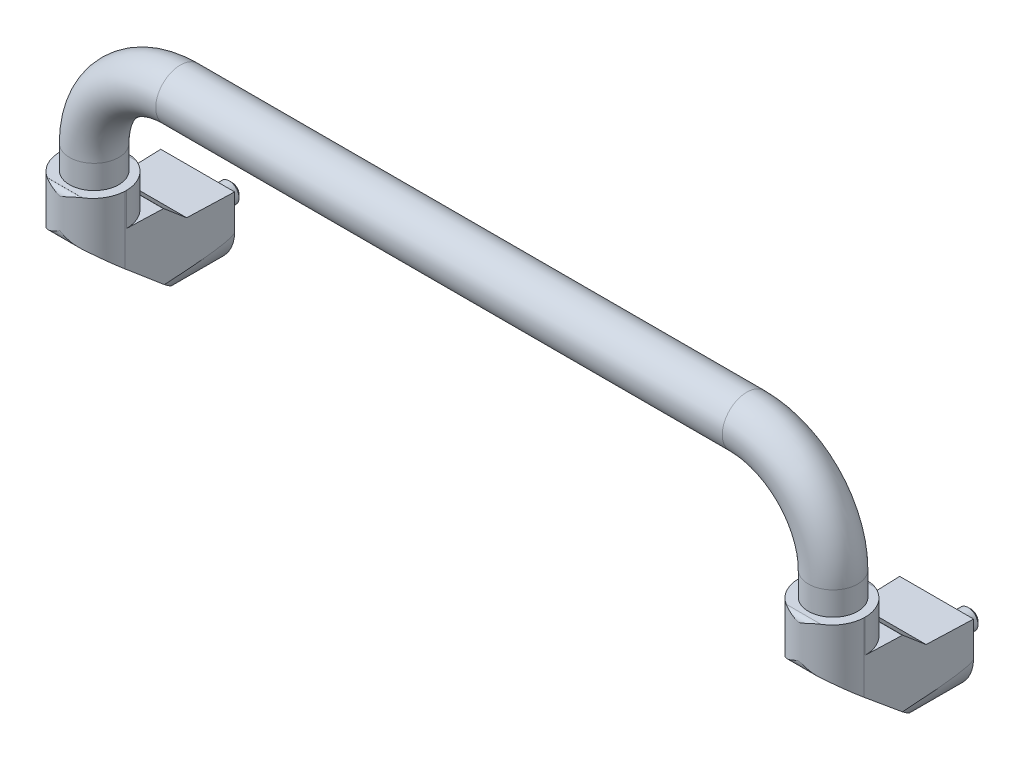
ISO-10303-21;
HEADER;
FILE_DESCRIPTION(('STEP AP214'),'2;1');
FILE_NAME('part.step','',(''),(''),'','','');
FILE_SCHEMA(('AUTOMOTIVE_DESIGN { 1 0 10303 214 1 1 1 1 }'));
ENDSEC;
DATA;
#1=APPLICATION_CONTEXT('core data for automotive mechanical design processes');
#2=APPLICATION_PROTOCOL_DEFINITION('international standard','automotive_design',2000,#1);
#3=PRODUCT_CONTEXT('',#1,'mechanical');
#4=PRODUCT('Part','Part','',(#3));
#5=PRODUCT_RELATED_PRODUCT_CATEGORY('part','',(#4));
#6=PRODUCT_DEFINITION_FORMATION('','',#4);
#7=PRODUCT_DEFINITION_CONTEXT('part definition',#1,'design');
#8=PRODUCT_DEFINITION('design','',#6,#7);
#9=PRODUCT_DEFINITION_SHAPE('','',#8);
#10=(LENGTH_UNIT() NAMED_UNIT(*) SI_UNIT(.MILLI.,.METRE.));
#11=(NAMED_UNIT(*) PLANE_ANGLE_UNIT() SI_UNIT($,.RADIAN.));
#12=(NAMED_UNIT(*) SI_UNIT($,.STERADIAN.) SOLID_ANGLE_UNIT());
#13=UNCERTAINTY_MEASURE_WITH_UNIT(LENGTH_MEASURE(1.E-05),#10,'distance_accuracy_value','');
#14=(GEOMETRIC_REPRESENTATION_CONTEXT(3) GLOBAL_UNCERTAINTY_ASSIGNED_CONTEXT((#13)) GLOBAL_UNIT_ASSIGNED_CONTEXT((#10,
#11,#12)) REPRESENTATION_CONTEXT('',''));
#15=CARTESIAN_POINT('',(0.,0.,0.));
#16=DIRECTION('',(0.,0.,1.));
#17=DIRECTION('',(1.,0.,0.));
#18=AXIS2_PLACEMENT_3D('',#15,#16,#17);
#19=CARTESIAN_POINT('',(14.5950313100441,35.,11.5380553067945));
#20=DIRECTION('',(-0.999384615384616,0.,-0.0350769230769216));
#21=DIRECTION('',(-0.0350769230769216,0.,0.999384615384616));
#22=AXIS2_PLACEMENT_3D('',#19,#20,#21);
#23=PLANE('',#22);
#24=DIRECTION('',(0.0350769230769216,0.,-0.999384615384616));
#25=VECTOR('',#24,1.);
#26=CARTESIAN_POINT('',(14.5950313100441,14.0068766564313,11.5380553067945));
#27=LINE('',#26,#25);
#28=CARTESIAN_POINT('',(14.339275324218,14.0068766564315,18.824857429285));
#29=VERTEX_POINT('',#28);
#30=CARTESIAN_POINT('',(15.,14.0068766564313,0.));
#31=VERTEX_POINT('',#30);
#32=EDGE_CURVE('E655',#29,#31,#27,.T.);
#33=ORIENTED_EDGE('',*,*,#32,.F.);
#34=DIRECTION('',(0.0268773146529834,-0.642555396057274,-0.76576770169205));
#35=VECTOR('',#34,1.);
#36=CARTESIAN_POINT('',(14.1268807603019,19.0845890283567,24.876239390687));
#37=LINE('',#36,#35);
#38=CARTESIAN_POINT('',(14.0194412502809,21.6531431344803,27.9373229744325));
#39=VERTEX_POINT('',#38);
#40=EDGE_CURVE('E649',#39,#29,#37,.T.);
#41=ORIENTED_EDGE('',*,*,#40,.F.);
#42=DIRECTION('',(0.,1.,0.));
#43=VECTOR('',#42,1.);
#44=CARTESIAN_POINT('',(14.0194412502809,35.,27.9373229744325));
#45=LINE('',#44,#43);
#46=CARTESIAN_POINT('',(14.0194412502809,21.6,27.9373229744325));
#47=VERTEX_POINT('',#46);
#48=EDGE_CURVE('E736',#47,#39,#45,.T.);
#49=ORIENTED_EDGE('',*,*,#48,.F.);
#50=DIRECTION('',(0.0350769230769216,0.,-0.999384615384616));
#51=VECTOR('',#50,1.);
#52=CARTESIAN_POINT('',(14.5950313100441,21.6,11.5380553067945));
#53=LINE('',#52,#51);
#54=CARTESIAN_POINT('',(13.5083128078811,21.6,42.5));
#55=VERTEX_POINT('',#54);
#56=EDGE_CURVE('E733',#55,#47,#53,.T.);
#57=ORIENTED_EDGE('',*,*,#56,.F.);
#58=DIRECTION('',(0.,1.,0.));
#59=VECTOR('',#58,1.);
#60=CARTESIAN_POINT('',(13.5083128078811,35.,42.5));
#61=LINE('',#60,#59);
#62=CARTESIAN_POINT('',(13.5083128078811,35.,42.5));
#63=VERTEX_POINT('',#62);
#64=EDGE_CURVE('E701',#55,#63,#61,.T.);
#65=ORIENTED_EDGE('',*,*,#64,.T.);
#66=DIRECTION('',(0.0350769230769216,0.,-0.999384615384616));
#67=VECTOR('',#66,1.);
#68=CARTESIAN_POINT('',(14.5950313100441,35.,11.5380553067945));
#69=LINE('',#68,#67);
#70=CARTESIAN_POINT('',(13.491692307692,35.,42.9735384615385));
#71=VERTEX_POINT('',#70);
#72=EDGE_CURVE('E322',#71,#63,#69,.T.);
#73=ORIENTED_EDGE('',*,*,#72,.F.);
#74=DIRECTION('',(0.,-1.,0.));
#75=VECTOR('',#74,1.);
#76=CARTESIAN_POINT('',(13.491692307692,35.,42.9735384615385));
#77=LINE('',#76,#75);
#78=CARTESIAN_POINT('',(13.491692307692,7.63348617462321,42.9735384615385));
#79=VERTEX_POINT('',#78);
#80=EDGE_CURVE('E334',#71,#79,#77,.T.);
#81=ORIENTED_EDGE('',*,*,#80,.T.);
#82=DIRECTION('',(0.0268773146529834,-0.642555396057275,-0.765767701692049));
#83=VECTOR('',#82,1.);
#84=CARTESIAN_POINT('',(13.6668633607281,3.44567549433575,37.9827000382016));
#85=LINE('',#84,#83);
#86=CARTESIAN_POINT('',(14.0326622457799,-5.29947075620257,27.5606405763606));
#87=VERTEX_POINT('',#86);
#88=EDGE_CURVE('E675',#79,#87,#85,.T.);
#89=ORIENTED_EDGE('',*,*,#88,.T.);
#90=CARTESIAN_POINT('',(0.,0.,427.36842105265));
#91=DIRECTION('',(-0.999384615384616,0.,-0.0350769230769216));
#92=DIRECTION('',(0.0350769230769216,0.,-0.999384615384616));
#93=AXIS2_PLACEMENT_3D('',#90,#91,#92);
#94=ELLIPSE('',#93,427.631578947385,15.);
#95=CARTESIAN_POINT('',(14.988671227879,-0.582867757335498,0.322770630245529));
#96=VERTEX_POINT('',#95);
#97=EDGE_CURVE('E308',#87,#96,#94,.F.);
#98=ORIENTED_EDGE('',*,*,#97,.T.);
#99=DIRECTION('',(0.0350769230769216,0.,-0.999384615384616));
#100=VECTOR('',#99,1.);
#101=CARTESIAN_POINT('',(14.5950313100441,-0.582867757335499,11.5380553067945));
#102=LINE('',#101,#100);
#103=CARTESIAN_POINT('',(15.,-0.582867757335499,0.));
#104=VERTEX_POINT('',#103);
#105=EDGE_CURVE('E310',#96,#104,#102,.T.);
#106=ORIENTED_EDGE('',*,*,#105,.T.);
#107=DIRECTION('',(0.,-1.,0.));
#108=VECTOR('',#107,1.);
#109=CARTESIAN_POINT('',(15.,35.,0.));
#110=LINE('',#109,#108);
#111=EDGE_CURVE('E332',#31,#104,#110,.T.);
#112=ORIENTED_EDGE('',*,*,#111,.F.);
#113=EDGE_LOOP('',(#33,#41,#49,#57,#65,#73,#81,#89,#98,#106,#112));
#114=FACE_BOUND('',#113,.T.);
#115=ADVANCED_FACE('F14',(#114),#23,.F.);
#116=CARTESIAN_POINT('',(0.,35.,0.));
#117=DIRECTION('',(0.,0.,-1.));
#118=DIRECTION('',(0.,-1.,0.));
#119=AXIS2_PLACEMENT_3D('',#116,#117,#118);
#120=PLANE('',#119);
#121=CARTESIAN_POINT('',(0.,0.,0.));
#122=DIRECTION('',(0.,0.,-1.));
#123=DIRECTION('',(0.,-1.,0.));
#124=AXIS2_PLACEMENT_3D('',#121,#122,#123);
#125=CIRCLE('',#124,3.99999999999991);
#126=CARTESIAN_POINT('',(0.,-3.99999999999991,0.));
#127=VERTEX_POINT('',#126);
#128=EDGE_CURVE('E734',#127,#127,#125,.T.);
#129=ORIENTED_EDGE('',*,*,#128,.F.);
#130=EDGE_LOOP('',(#129));
#131=FACE_BOUND('',#130,.T.);
#132=DIRECTION('',(0.,-1.,0.));
#133=VECTOR('',#132,1.);
#134=CARTESIAN_POINT('',(-15.,35.,0.));
#135=LINE('',#134,#133);
#136=CARTESIAN_POINT('',(-15.,14.0068766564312,-2.98600120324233E-12));
#137=VERTEX_POINT('',#136);
#138=CARTESIAN_POINT('',(-15.,-0.582867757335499,0.));
#139=VERTEX_POINT('',#138);
#140=EDGE_CURVE('E340',#137,#139,#135,.T.);
#141=ORIENTED_EDGE('',*,*,#140,.F.);
#142=DIRECTION('',(1.,0.,0.));
#143=VECTOR('',#142,1.);
#144=CARTESIAN_POINT('',(0.,14.0068766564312,0.));
#145=LINE('',#144,#143);
#146=EDGE_CURVE('E653',#137,#31,#145,.T.);
#147=ORIENTED_EDGE('',*,*,#146,.T.);
#148=ORIENTED_EDGE('',*,*,#111,.T.);
#149=DIRECTION('',(1.,0.,0.));
#150=VECTOR('',#149,1.);
#151=CARTESIAN_POINT('',(14.988671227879,-0.582867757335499,0.));
#152=LINE('',#151,#150);
#153=CARTESIAN_POINT('',(14.988671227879,-0.582867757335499,0.));
#154=VERTEX_POINT('',#153);
#155=EDGE_CURVE('E297',#154,#104,#152,.T.);
#156=ORIENTED_EDGE('',*,*,#155,.F.);
#157=CARTESIAN_POINT('',(0.,0.,0.));
#158=DIRECTION('',(0.,0.,1.));
#159=DIRECTION('',(0.,-1.,0.));
#160=AXIS2_PLACEMENT_3D('',#157,#158,#159);
#161=CIRCLE('',#160,15.);
#162=CARTESIAN_POINT('',(-14.98867122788,-0.582867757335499,0.));
#163=VERTEX_POINT('',#162);
#164=EDGE_CURVE('E292',#163,#154,#161,.T.);
#165=ORIENTED_EDGE('',*,*,#164,.F.);
#166=DIRECTION('',(-1.,0.,0.));
#167=VECTOR('',#166,1.);
#168=CARTESIAN_POINT('',(-14.98867122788,-0.582867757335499,0.));
#169=LINE('',#168,#167);
#170=EDGE_CURVE('E294',#163,#139,#169,.T.);
#171=ORIENTED_EDGE('',*,*,#170,.T.);
#172=EDGE_LOOP('',(#141,#147,#148,#156,#165,#171));
#173=FACE_BOUND('',#172,.T.);
#174=ADVANCED_FACE('F564',(#131,#173),#120,.T.);
#175=CARTESIAN_POINT('',(0.,35.,42.5));
#176=DIRECTION('',(0.,1.,0.));
#177=DIRECTION('',(1.,0.,0.));
#178=AXIS2_PLACEMENT_3D('',#175,#176,#177);
#179=PLANE('',#178);
#180=CARTESIAN_POINT('',(-0.0396757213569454,35.,41.9999909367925));
#181=DIRECTION('',(0.,1.,0.));
#182=DIRECTION('',(-1.,0.,0.));
#183=AXIS2_PLACEMENT_3D('',#180,#181,#182);
#184=CIRCLE('',#183,10.);
#185=CARTESIAN_POINT('',(-10.0396757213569,35.,41.9999909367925));
#186=VERTEX_POINT('',#185);
#187=EDGE_CURVE('E342',#186,#186,#184,.T.);
#188=ORIENTED_EDGE('',*,*,#187,.F.);
#189=EDGE_LOOP('',(#188));
#190=FACE_BOUND('',#189,.T.);
#191=CARTESIAN_POINT('',(0.,35.,42.5));
#192=DIRECTION('',(0.,-1.,0.));
#193=DIRECTION('',(1.,0.,0.));
#194=AXIS2_PLACEMENT_3D('',#191,#192,#193);
#195=CIRCLE('',#194,13.5);
#196=CARTESIAN_POINT('',(5.09901951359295,35.,30.));
#197=VERTEX_POINT('',#196);
#198=CARTESIAN_POINT('',(13.5,35.,42.5));
#199=VERTEX_POINT('',#198);
#200=EDGE_CURVE('E257',#197,#199,#195,.T.);
#201=ORIENTED_EDGE('',*,*,#200,.F.);
#202=DIRECTION('',(1.,0.,0.));
#203=VECTOR('',#202,1.);
#204=CARTESIAN_POINT('',(-15.,35.,30.));
#205=LINE('',#204,#203);
#206=CARTESIAN_POINT('',(-5.09901951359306,35.,30.));
#207=VERTEX_POINT('',#206);
#208=EDGE_CURVE('E36',#207,#197,#205,.T.);
#209=ORIENTED_EDGE('',*,*,#208,.F.);
#210=CARTESIAN_POINT('',(-13.5,35.,42.5));
#211=VERTEX_POINT('',#210);
#212=EDGE_CURVE('E255',#211,#207,#195,.T.);
#213=ORIENTED_EDGE('',*,*,#212,.F.);
#214=DIRECTION('',(1.,0.,0.));
#215=VECTOR('',#214,1.);
#216=CARTESIAN_POINT('',(-14.98867122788,35.,42.5));
#217=LINE('',#216,#215);
#218=CARTESIAN_POINT('',(-13.508312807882,35.,42.5));
#219=VERTEX_POINT('',#218);
#220=EDGE_CURVE('E265',#219,#211,#217,.T.);
#221=ORIENTED_EDGE('',*,*,#220,.F.);
#222=DIRECTION('',(0.0350769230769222,0.,0.999384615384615));
#223=VECTOR('',#222,1.);
#224=CARTESIAN_POINT('',(-14.595031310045,35.,11.5380553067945));
#225=LINE('',#224,#223);
#226=CARTESIAN_POINT('',(-13.491692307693,35.,42.9735384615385));
#227=VERTEX_POINT('',#226);
#228=EDGE_CURVE('E329',#219,#227,#225,.T.);
#229=ORIENTED_EDGE('',*,*,#228,.T.);
#230=CARTESIAN_POINT('',(0.,35.,42.5));
#231=DIRECTION('',(0.,-1.,0.));
#232=DIRECTION('',(1.,0.,0.));
#233=AXIS2_PLACEMENT_3D('',#230,#231,#232);
#234=CIRCLE('',#233,13.5);
#235=CARTESIAN_POINT('',(-7.07092481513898,35.,54.0000879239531));
#236=VERTEX_POINT('',#235);
#237=EDGE_CURVE('E325',#236,#227,#234,.T.);
#238=ORIENTED_EDGE('',*,*,#237,.F.);
#239=DIRECTION('',(-1.,0.,0.));
#240=VECTOR('',#239,1.);
#241=CARTESIAN_POINT('',(0.,35.,54.000087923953));
#242=LINE('',#241,#240);
#243=CARTESIAN_POINT('',(7.07092481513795,35.,54.0000879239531));
#244=VERTEX_POINT('',#243);
#245=EDGE_CURVE('E598',#244,#236,#242,.T.);
#246=ORIENTED_EDGE('',*,*,#245,.F.);
#247=EDGE_CURVE('E326',#71,#244,#234,.T.);
#248=ORIENTED_EDGE('',*,*,#247,.F.);
#249=ORIENTED_EDGE('',*,*,#72,.T.);
#250=DIRECTION('',(1.,0.,0.));
#251=VECTOR('',#250,1.);
#252=CARTESIAN_POINT('',(13.5,35.,42.5));
#253=LINE('',#252,#251);
#254=EDGE_CURVE('E267',#199,#63,#253,.T.);
#255=ORIENTED_EDGE('',*,*,#254,.F.);
#256=EDGE_LOOP('',(#201,#209,#213,#221,#229,#238,#246,#248,#249,#255));
#257=FACE_BOUND('',#256,.T.);
#258=ADVANCED_FACE('F253',(#190,#257),#179,.T.);
#259=CARTESIAN_POINT('',(-14.595031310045,35.,11.5380553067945));
#260=DIRECTION('',(0.999384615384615,0.,-0.0350769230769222));
#261=DIRECTION('',(-0.0350769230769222,0.,-0.999384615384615));
#262=AXIS2_PLACEMENT_3D('',#259,#260,#261);
#263=PLANE('',#262);
#264=DIRECTION('',(0.0350769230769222,0.,0.999384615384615));
#265=VECTOR('',#264,1.);
#266=CARTESIAN_POINT('',(-14.595031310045,14.0068766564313,11.5380553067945));
#267=LINE('',#266,#265);
#268=CARTESIAN_POINT('',(-14.339275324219,14.0068766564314,18.824857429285));
#269=VERTEX_POINT('',#268);
#270=EDGE_CURVE('E9',#137,#269,#267,.T.);
#271=ORIENTED_EDGE('',*,*,#270,.F.);
#272=ORIENTED_EDGE('',*,*,#140,.T.);
#273=DIRECTION('',(-0.0350769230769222,0.,-0.999384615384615));
#274=VECTOR('',#273,1.);
#275=CARTESIAN_POINT('',(-14.595031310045,-0.582867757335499,11.5380553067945));
#276=LINE('',#275,#274);
#277=CARTESIAN_POINT('',(-14.98867122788,-0.5828677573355,0.322770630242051));
#278=VERTEX_POINT('',#277);
#279=EDGE_CURVE('E313',#278,#139,#276,.T.);
#280=ORIENTED_EDGE('',*,*,#279,.F.);
#281=CARTESIAN_POINT('',(0.,0.,427.36842105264));
#282=DIRECTION('',(0.999384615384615,0.,-0.0350769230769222));
#283=DIRECTION('',(-0.0350769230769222,0.,-0.999384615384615));
#284=AXIS2_PLACEMENT_3D('',#281,#282,#283);
#285=ELLIPSE('',#284,427.631578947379,15.);
#286=CARTESIAN_POINT('',(-14.0326622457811,-5.29947075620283,27.5606405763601));
#287=VERTEX_POINT('',#286);
#288=EDGE_CURVE('E305',#278,#287,#285,.F.);
#289=ORIENTED_EDGE('',*,*,#288,.T.);
#290=DIRECTION('',(0.0268773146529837,0.642555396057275,0.765767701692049));
#291=VECTOR('',#290,1.);
#292=CARTESIAN_POINT('',(-13.666863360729,3.4456754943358,37.9827000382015));
#293=LINE('',#292,#291);
#294=CARTESIAN_POINT('',(-13.491692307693,7.6334861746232,42.9735384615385));
#295=VERTEX_POINT('',#294);
#296=EDGE_CURVE('E672',#287,#295,#293,.T.);
#297=ORIENTED_EDGE('',*,*,#296,.T.);
#298=DIRECTION('',(0.,-1.,0.));
#299=VECTOR('',#298,1.);
#300=CARTESIAN_POINT('',(-13.491692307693,35.,42.9735384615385));
#301=LINE('',#300,#299);
#302=EDGE_CURVE('E337',#227,#295,#301,.T.);
#303=ORIENTED_EDGE('',*,*,#302,.F.);
#304=ORIENTED_EDGE('',*,*,#228,.F.);
#305=DIRECTION('',(0.,-1.,0.));
#306=VECTOR('',#305,1.);
#307=CARTESIAN_POINT('',(-13.508312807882,35.,42.5));
#308=LINE('',#307,#306);
#309=CARTESIAN_POINT('',(-13.508312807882,21.6,42.5));
#310=VERTEX_POINT('',#309);
#311=EDGE_CURVE('E693',#219,#310,#308,.T.);
#312=ORIENTED_EDGE('',*,*,#311,.T.);
#313=DIRECTION('',(0.0350769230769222,0.,0.999384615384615));
#314=VECTOR('',#313,1.);
#315=CARTESIAN_POINT('',(-14.595031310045,21.6,11.5380553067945));
#316=LINE('',#315,#314);
#317=CARTESIAN_POINT('',(-14.0194412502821,21.6,27.9373229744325));
#318=VERTEX_POINT('',#317);
#319=EDGE_CURVE('E288',#318,#310,#316,.T.);
#320=ORIENTED_EDGE('',*,*,#319,.F.);
#321=DIRECTION('',(0.,-1.,0.));
#322=VECTOR('',#321,1.);
#323=CARTESIAN_POINT('',(-14.0194412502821,35.,27.9373229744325));
#324=LINE('',#323,#322);
#325=CARTESIAN_POINT('',(-14.0194412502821,21.6531431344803,27.9373229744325));
#326=VERTEX_POINT('',#325);
#327=EDGE_CURVE('E290',#326,#318,#324,.T.);
#328=ORIENTED_EDGE('',*,*,#327,.F.);
#329=DIRECTION('',(0.0268773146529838,0.642555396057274,0.76576770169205));
#330=VECTOR('',#329,1.);
#331=CARTESIAN_POINT('',(-14.1268807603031,19.0845890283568,24.8762393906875));
#332=LINE('',#331,#330);
#333=EDGE_CURVE('E29',#269,#326,#332,.T.);
#334=ORIENTED_EDGE('',*,*,#333,.F.);
#335=EDGE_LOOP('',(#271,#272,#280,#289,#297,#303,#304,#312,#320,#328,#334));
#336=FACE_BOUND('',#335,.T.);
#337=ADVANCED_FACE('F583',(#336),#263,.F.);
#338=CARTESIAN_POINT('',(-14.9886712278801,21.6,27.9373229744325));
#339=DIRECTION('',(0.,0.,1.));
#340=DIRECTION('',(0.,1.,0.));
#341=AXIS2_PLACEMENT_3D('',#338,#339,#340);
#342=PLANE('',#341);
#343=ORIENTED_EDGE('',*,*,#48,.T.);
#344=DIRECTION('',(-1.,0.,0.));
#345=VECTOR('',#344,1.);
#346=CARTESIAN_POINT('',(-14.9886712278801,21.6531431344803,27.9373229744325));
#347=LINE('',#346,#345);
#348=EDGE_CURVE('E22',#39,#326,#347,.T.);
#349=ORIENTED_EDGE('',*,*,#348,.T.);
#350=ORIENTED_EDGE('',*,*,#327,.T.);
#351=DIRECTION('',(1.,0.,0.));
#352=VECTOR('',#351,1.);
#353=CARTESIAN_POINT('',(-14.9886712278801,21.6,27.9373229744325));
#354=LINE('',#353,#352);
#355=EDGE_CURVE('E279',#318,#47,#354,.T.);
#356=ORIENTED_EDGE('',*,*,#355,.T.);
#357=EDGE_LOOP('',(#343,#349,#350,#356));
#358=FACE_BOUND('',#357,.T.);
#359=ADVANCED_FACE('F581',(#358),#342,.T.);
#360=CARTESIAN_POINT('',(0.,35.,42.5));
#361=DIRECTION('',(0.,-1.,0.));
#362=DIRECTION('',(1.,0.,0.));
#363=AXIS2_PLACEMENT_3D('',#360,#361,#362);
#364=CYLINDRICAL_SURFACE('',#363,13.5);
#365=DIRECTION('',(0.,-1.,0.));
#366=VECTOR('',#365,1.);
#367=CARTESIAN_POINT('',(7.07092481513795,35.,54.0000879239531));
#368=LINE('',#367,#366);
#369=CARTESIAN_POINT('',(7.07092481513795,34.9704219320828,54.0000879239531));
#370=VERTEX_POINT('',#369);
#371=EDGE_CURVE('E682',#370,#244,#368,.F.);
#372=ORIENTED_EDGE('',*,*,#371,.F.);
#373=CARTESIAN_POINT('',(-7.07092481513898,34.9704219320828,54.0000879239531));
#374=CARTESIAN_POINT('',(-6.87750374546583,34.9704282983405,54.1190115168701));
#375=CARTESIAN_POINT('',(-6.68105374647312,34.959869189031,54.2330583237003));
#376=CARTESIAN_POINT('',(-6.28381350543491,34.9221612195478,54.4505270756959));
#377=CARTESIAN_POINT('',(-6.08301891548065,34.8949949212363,54.5539377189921));
#378=CARTESIAN_POINT('',(-5.6770713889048,34.8272761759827,54.7503886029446));
#379=CARTESIAN_POINT('',(-5.47189888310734,34.7866398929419,54.8433588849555));
#380=CARTESIAN_POINT('',(-5.0593139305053,34.694757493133,55.0181285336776));
#381=CARTESIAN_POINT('',(-4.851902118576,34.6435143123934,55.09993098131));
#382=CARTESIAN_POINT('',(-4.36508724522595,34.5138570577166,55.2782623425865));
#383=CARTESIAN_POINT('',(-4.0849844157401,34.4321066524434,55.3704604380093));
#384=CARTESIAN_POINT('',(-3.52253018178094,34.2574892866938,55.5356338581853));
#385=CARTESIAN_POINT('',(-3.24017788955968,34.1646177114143,55.6086011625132));
#386=CARTESIAN_POINT('',(-2.67652768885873,33.971809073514,55.7351381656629));
#387=CARTESIAN_POINT('',(-2.39524290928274,33.8719425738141,55.7888753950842));
#388=CARTESIAN_POINT('',(-1.83184388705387,33.6670280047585,55.8781780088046));
#389=CARTESIAN_POINT('',(-1.5497301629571,33.5619827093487,55.9137530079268));
#390=CARTESIAN_POINT('',(-1.1714643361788,33.419293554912,55.949421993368));
#391=CARTESIAN_POINT('',(-1.07551786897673,33.3829421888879,55.9574338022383));
#392=CARTESIAN_POINT('',(-0.883513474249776,33.309986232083,55.9714019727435));
#393=CARTESIAN_POINT('',(-0.787455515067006,33.2733815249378,55.9773573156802));
#394=CARTESIAN_POINT('',(-0.593228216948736,33.19919905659,55.9873180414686));
#395=CARTESIAN_POINT('',(-0.495058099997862,33.1616173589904,55.9912785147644));
#396=CARTESIAN_POINT('',(-0.347759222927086,33.1055246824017,55.9956090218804));
#397=CARTESIAN_POINT('',(-0.298700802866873,33.0868920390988,55.996783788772));
#398=CARTESIAN_POINT('',(-0.200553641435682,33.0496905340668,55.998599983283));
#399=CARTESIAN_POINT('',(-0.151464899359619,33.0311216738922,55.999241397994));
#400=CARTESIAN_POINT('',(-0.0849879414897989,33.0080155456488,55.9997430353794));
#401=CARTESIAN_POINT('',(-0.0680493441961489,33.0023025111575,55.9998394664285));
#402=CARTESIAN_POINT('',(-0.0424994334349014,32.9952097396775,55.9999356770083));
#403=CARTESIAN_POINT('',(-0.0341004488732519,32.9931150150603,55.9999596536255));
#404=CARTESIAN_POINT('',(-0.0171291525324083,32.9901026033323,55.9999917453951));
#405=CARTESIAN_POINT('',(-0.00855921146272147,32.9891740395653,56.0000000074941));
#406=CARTESIAN_POINT('',(0.00879402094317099,32.9891765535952,55.9999999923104));
#407=CARTESIAN_POINT('',(0.0175772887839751,32.9901547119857,55.9999912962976));
#408=CARTESIAN_POINT('',(0.034966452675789,32.9933005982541,55.9999575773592));
#409=CARTESIAN_POINT('',(0.043569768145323,32.9954798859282,55.999932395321));
#410=CARTESIAN_POINT('',(0.0697279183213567,33.0028315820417,55.9998314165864));
#411=CARTESIAN_POINT('',(0.0870672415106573,33.0087214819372,55.9997302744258));
#412=CARTESIAN_POINT('',(0.171095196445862,33.0380140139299,55.9990808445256));
#413=CARTESIAN_POINT('',(0.23705830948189,33.0633144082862,55.9980811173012));
#414=CARTESIAN_POINT('',(0.367738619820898,33.1132270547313,55.9951443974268));
#415=CARTESIAN_POINT('',(0.432454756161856,33.1378430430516,55.9932262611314));
#416=CARTESIAN_POINT('',(0.627360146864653,33.2121316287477,55.9860459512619));
#417=CARTESIAN_POINT('',(0.757454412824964,33.2619227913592,55.9793646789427));
#418=CARTESIAN_POINT('',(1.01760396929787,33.3610278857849,55.9622233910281));
#419=CARTESIAN_POINT('',(1.14765924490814,33.4103417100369,55.9517625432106));
#420=CARTESIAN_POINT('',(1.54015609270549,33.5583124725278,55.9144503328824));
#421=CARTESIAN_POINT('',(1.80241871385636,33.6560305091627,55.8817605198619));
#422=CARTESIAN_POINT('',(2.39427723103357,33.87190795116,55.7901814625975));
#423=CARTESIAN_POINT('',(2.72364690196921,33.9887746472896,55.7266896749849));
#424=CARTESIAN_POINT('',(3.38052871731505,34.2114954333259,55.5742426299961));
#425=CARTESIAN_POINT('',(3.70803931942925,34.3173413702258,55.4852687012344));
#426=CARTESIAN_POINT('',(4.35819027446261,34.5122628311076,55.2816858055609));
#427=CARTESIAN_POINT('',(4.68084736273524,34.6014256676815,55.1672175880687));
#428=CARTESIAN_POINT('',(5.16087542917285,34.7178726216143,54.9757774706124));
#429=CARTESIAN_POINT('',(5.32015518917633,34.7537932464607,54.9087086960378));
#430=CARTESIAN_POINT('',(5.63716070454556,34.8187750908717,54.7679448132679));
#431=CARTESIAN_POINT('',(5.79488691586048,34.8478383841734,54.6942517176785));
#432=CARTESIAN_POINT('',(6.06000533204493,34.8900814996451,54.564034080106));
#433=CARTESIAN_POINT('',(6.16790737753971,34.9053950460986,54.5092308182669));
#434=CARTESIAN_POINT('',(6.38261514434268,34.9315949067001,54.3965087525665));
#435=CARTESIAN_POINT('',(6.48942096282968,34.9424816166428,54.3385902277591));
#436=CARTESIAN_POINT('',(6.70186294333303,34.959243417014,54.2196361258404));
#437=CARTESIAN_POINT('',(6.80749751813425,34.9651123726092,54.1585968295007));
#438=CARTESIAN_POINT('',(7.01720095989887,34.9711201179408,54.0335939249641));
#439=CARTESIAN_POINT('',(7.12126983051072,34.9712589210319,53.9696303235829));
#440=CARTESIAN_POINT('',(7.32838648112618,34.9649685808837,53.8384260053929));
#441=CARTESIAN_POINT('',(7.43141794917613,34.9584833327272,53.771161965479));
#442=CARTESIAN_POINT('',(7.63511779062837,34.9378853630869,53.6341833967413));
#443=CARTESIAN_POINT('',(7.73578568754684,34.923771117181,53.5644683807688));
#444=CARTESIAN_POINT('',(7.93394129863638,34.8868175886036,53.4232476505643));
#445=CARTESIAN_POINT('',(8.03143518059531,34.8639964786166,53.3517459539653));
#446=CARTESIAN_POINT('',(8.22260264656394,34.808343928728,53.2076198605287));
#447=CARTESIAN_POINT('',(8.3162787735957,34.7755192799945,53.1349962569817));
#448=CARTESIAN_POINT('',(8.51057580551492,34.6934220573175,52.9803342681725));
#449=CARTESIAN_POINT('',(8.61054102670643,34.6425773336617,52.8982859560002));
#450=CARTESIAN_POINT('',(8.80216710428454,34.5239909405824,52.7365776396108));
#451=CARTESIAN_POINT('',(8.89383372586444,34.4562611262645,52.6569160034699));
#452=CARTESIAN_POINT('',(9.05162034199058,34.3145923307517,52.5163590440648));
#453=CARTESIAN_POINT('',(9.11946043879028,34.2435185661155,52.454535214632));
#454=CARTESIAN_POINT('',(9.24476625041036,34.087467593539,52.3382710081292));
#455=CARTESIAN_POINT('',(9.30224701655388,34.0025109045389,52.2838199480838));
#456=CARTESIAN_POINT('',(9.39284210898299,33.8391516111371,52.1967822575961));
#457=CARTESIAN_POINT('',(9.42853677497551,33.7633500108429,52.1620164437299));
#458=CARTESIAN_POINT('',(9.49027872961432,33.6045451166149,52.1013794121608));
#459=CARTESIAN_POINT('',(9.51633106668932,33.5215456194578,52.0755035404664));
#460=CARTESIAN_POINT('',(9.55753005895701,33.3497074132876,52.0343845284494));
#461=CARTESIAN_POINT('',(9.57260589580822,33.260834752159,52.019210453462));
#462=CARTESIAN_POINT('',(9.59060313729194,33.0806412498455,52.0010792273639));
#463=CARTESIAN_POINT('',(9.59353024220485,32.9893215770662,51.9981163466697));
#464=CARTESIAN_POINT('',(9.58739700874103,32.8171715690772,52.0043054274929));
#465=CARTESIAN_POINT('',(9.57956343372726,32.7362469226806,52.0122176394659));
#466=CARTESIAN_POINT('',(9.55445710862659,32.5774089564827,52.0374347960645));
#467=CARTESIAN_POINT('',(9.53718461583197,32.499495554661,52.0547394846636));
#468=CARTESIAN_POINT('',(9.4938100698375,32.3477345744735,52.0978384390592));
#469=CARTESIAN_POINT('',(9.46761759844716,32.2739380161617,52.1237195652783));
#470=CARTESIAN_POINT('',(9.40755152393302,32.1325392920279,52.1824450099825));
#471=CARTESIAN_POINT('',(9.37367436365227,32.0649400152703,52.2152925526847));
#472=CARTESIAN_POINT('',(9.28309871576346,31.9085063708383,52.3020150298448));
#473=CARTESIAN_POINT('',(9.22289796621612,31.8233081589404,52.3588047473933));
#474=CARTESIAN_POINT('',(9.09201649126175,31.6673398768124,52.4796404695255));
#475=CARTESIAN_POINT('',(9.021314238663,31.5966001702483,52.5437013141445));
#476=CARTESIAN_POINT('',(8.83971629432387,31.4412059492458,52.7043937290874));
#477=CARTESIAN_POINT('',(8.72463129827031,31.3636956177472,52.8031628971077));
#478=CARTESIAN_POINT('',(8.48328068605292,31.2326908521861,53.0027921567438));
#479=CARTESIAN_POINT('',(8.35699456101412,31.179241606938,53.1036558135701));
#480=CARTESIAN_POINT('',(8.12310761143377,31.1012155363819,53.2834270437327));
#481=CARTESIAN_POINT('',(8.01691189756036,31.0729815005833,53.3626386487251));
#482=CARTESIAN_POINT('',(7.80064869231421,31.0274448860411,53.5189695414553));
#483=CARTESIAN_POINT('',(7.69057893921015,31.0101488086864,53.5960875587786));
#484=CARTESIAN_POINT('',(7.46735068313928,30.9849468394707,53.747528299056));
#485=CARTESIAN_POINT('',(7.35418900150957,30.9770510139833,53.8218479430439));
#486=CARTESIAN_POINT('',(7.1254687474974,30.9693699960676,53.9671737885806));
#487=CARTESIAN_POINT('',(7.00990934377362,30.9695876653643,54.0381788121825));
#488=CARTESIAN_POINT('',(6.69420345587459,30.9796506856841,54.2256662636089));
#489=CARTESIAN_POINT('',(6.49219751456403,30.9962153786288,54.3386830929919));
#490=CARTESIAN_POINT('',(6.08416654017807,31.0453499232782,54.553471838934));
#491=CARTESIAN_POINT('',(5.87813877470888,31.0779310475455,54.6552357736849));
#492=CARTESIAN_POINT('',(5.46253603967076,31.1558917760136,54.8476027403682));
#493=CARTESIAN_POINT('',(5.25295184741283,31.2013118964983,54.9381691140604));
#494=CARTESIAN_POINT('',(4.8316759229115,31.3022724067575,55.1077942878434));
#495=CARTESIAN_POINT('',(4.61998458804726,31.3578109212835,55.1868552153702));
#496=CARTESIAN_POINT('',(4.13829353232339,31.4928100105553,55.3532339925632));
#497=CARTESIAN_POINT('',(3.86779442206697,31.5747008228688,55.4371341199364));
#498=CARTESIAN_POINT('',(3.32490231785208,31.7480204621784,55.5871836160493));
#499=CARTESIAN_POINT('',(3.05250878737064,31.8394521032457,55.6533277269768));
#500=CARTESIAN_POINT('',(2.50838879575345,32.0284631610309,55.7678081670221));
#501=CARTESIAN_POINT('',(2.23667121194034,32.1259945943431,55.8162669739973));
#502=CARTESIAN_POINT('',(1.69251556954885,32.3255150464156,55.8963048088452));
#503=CARTESIAN_POINT('',(1.42007787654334,32.4275021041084,55.927891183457));
#504=CARTESIAN_POINT('',(1.05943377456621,32.5639977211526,55.9586551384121));
#505=CARTESIAN_POINT('',(0.971407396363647,32.5974308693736,55.9652943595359));
#506=CARTESIAN_POINT('',(0.795276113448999,32.6644946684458,55.9768441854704));
#507=CARTESIAN_POINT('',(0.707171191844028,32.6981253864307,55.9817541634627));
#508=CARTESIAN_POINT('',(0.574252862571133,32.7488848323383,55.9878553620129));
#509=CARTESIAN_POINT('',(0.529460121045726,32.7659944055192,55.9896878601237));
#510=CARTESIAN_POINT('',(0.439859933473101,32.8002299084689,55.9929068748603));
#511=CARTESIAN_POINT('',(0.395052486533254,32.817355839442,55.9942933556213));
#512=CARTESIAN_POINT('',(0.305429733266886,32.8514111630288,55.996618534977));
#513=CARTESIAN_POINT('',(0.260614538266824,32.8683408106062,55.9975578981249));
#514=CARTESIAN_POINT('',(0.170992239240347,32.9022294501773,55.9989921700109));
#515=CARTESIAN_POINT('',(0.126185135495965,32.9191884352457,55.9994871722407));
#516=CARTESIAN_POINT('',(0.067339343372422,32.9385313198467,55.9998385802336));
#517=CARTESIAN_POINT('',(0.0539644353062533,32.9427370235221,55.999899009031));
#518=CARTESIAN_POINT('',(0.0337306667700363,32.9476947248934,55.9999594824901));
#519=CARTESIAN_POINT('',(0.0270488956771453,32.9491116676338,55.9999746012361));
#520=CARTESIAN_POINT('',(0.0135759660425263,32.9510967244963,55.9999948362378));
#521=CARTESIAN_POINT('',(0.00678553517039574,32.9516691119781,56.000000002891));
#522=CARTESIAN_POINT('',(-0.00692023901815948,32.9516680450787,55.9999999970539));
#523=CARTESIAN_POINT('',(-0.013835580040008,32.9510732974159,55.9999946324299));
#524=CARTESIAN_POINT('',(-0.0275536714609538,32.9490209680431,55.9999736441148));
#525=CARTESIAN_POINT('',(-0.0343556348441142,32.9475588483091,55.9999579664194));
#526=CARTESIAN_POINT('',(-0.0549419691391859,32.9424579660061,55.999895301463));
#527=CARTESIAN_POINT('',(-0.068545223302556,32.9381473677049,55.9998327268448));
#528=CARTESIAN_POINT('',(-0.137339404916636,32.915460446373,55.9994146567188));
#529=CARTESIAN_POINT('',(-0.19163555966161,32.8946356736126,55.998750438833));
#530=CARTESIAN_POINT('',(-0.299452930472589,32.8535542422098,55.9967831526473));
#531=CARTESIAN_POINT('',(-0.352973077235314,32.833293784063,55.9954901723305));
#532=CARTESIAN_POINT('',(-0.513910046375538,32.7721117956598,55.9906445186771));
#533=CARTESIAN_POINT('',(-0.621219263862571,32.7309705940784,55.9861281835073));
#534=CARTESIAN_POINT('',(-0.835826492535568,32.6489898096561,55.9745286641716));
#535=CARTESIAN_POINT('',(-0.943124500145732,32.6081502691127,55.967445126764));
#536=CARTESIAN_POINT('',(-1.26653114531,32.4854908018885,55.9422069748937));
#537=CARTESIAN_POINT('',(-1.48252415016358,32.404156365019,55.9201133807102));
#538=CARTESIAN_POINT('',(-2.05310658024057,32.1922671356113,55.8477580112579));
#539=CARTESIAN_POINT('',(-2.40736493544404,32.0637495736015,55.7885189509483));
#540=CARTESIAN_POINT('',(-3.11404692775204,31.8178919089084,55.6408966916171));
#541=CARTESIAN_POINT('',(-3.46646876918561,31.7005613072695,55.5524889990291));
#542=CARTESIAN_POINT('',(-4.16746062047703,31.4833378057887,55.3458337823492));
#543=CARTESIAN_POINT('',(-4.51603625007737,31.3834150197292,55.2276382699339));
#544=CARTESIAN_POINT('',(-5.03457491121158,31.2526265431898,55.0274642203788));
#545=CARTESIAN_POINT('',(-5.20662438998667,31.2122268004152,54.9569626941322));
#546=CARTESIAN_POINT('',(-5.54900117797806,31.1391058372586,54.8082653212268));
#547=CARTESIAN_POINT('',(-5.71932895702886,31.1063824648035,54.7300716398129));
#548=CARTESIAN_POINT('',(-6.05789214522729,31.0501830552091,54.5659581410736));
#549=CARTESIAN_POINT('',(-6.22612665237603,31.0267108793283,54.480035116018));
#550=CARTESIAN_POINT('',(-6.55983624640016,30.9910136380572,54.3006114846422));
#551=CARTESIAN_POINT('',(-6.72531058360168,30.978791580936,54.2071088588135));
#552=CARTESIAN_POINT('',(-7.05166813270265,30.9681285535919,54.013460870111));
#553=CARTESIAN_POINT('',(-7.21257096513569,30.9696151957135,53.9133531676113));
#554=CARTESIAN_POINT('',(-7.5292191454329,30.9893042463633,53.7069833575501));
#555=CARTESIAN_POINT('',(-7.68497020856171,31.0074874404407,53.6007284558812));
#556=CARTESIAN_POINT('',(-7.96520055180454,31.0599487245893,53.4009313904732));
#557=CARTESIAN_POINT('',(-8.09070943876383,31.0912019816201,53.3080599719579));
#558=CARTESIAN_POINT('',(-8.33518178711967,31.171254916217,53.120661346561));
#559=CARTESIAN_POINT('',(-8.45413646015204,31.2200775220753,53.0261321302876));
#560=CARTESIAN_POINT('',(-8.68395719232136,31.3392533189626,52.8373706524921));
#561=CARTESIAN_POINT('',(-8.79471396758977,31.4098486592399,52.7431544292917));
#562=CARTESIAN_POINT('',(-9.00217867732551,31.575821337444,52.561293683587));
#563=CARTESIAN_POINT('',(-9.09893281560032,31.6711141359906,52.4736280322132));
#564=CARTESIAN_POINT('',(-9.23879434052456,31.8463568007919,52.3437817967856));
#565=CARTESIAN_POINT('',(-9.2881771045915,31.9179858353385,52.2971229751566));
#566=CARTESIAN_POINT('',(-9.37762994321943,32.0711185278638,52.2115327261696));
#567=CARTESIAN_POINT('',(-9.41770381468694,32.1526181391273,52.1725981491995));
#568=CARTESIAN_POINT('',(-9.48688680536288,32.3251423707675,52.1047578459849));
#569=CARTESIAN_POINT('',(-9.51588964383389,32.4162491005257,52.0759495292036));
#570=CARTESIAN_POINT('',(-9.56048639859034,32.6047461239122,52.0314280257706));
#571=CARTESIAN_POINT('',(-9.57609448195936,32.7021296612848,52.0157010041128));
#572=CARTESIAN_POINT('',(-9.59162429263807,32.885885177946,52.0000441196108));
#573=CARTESIAN_POINT('',(-9.59339475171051,32.9719479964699,51.9982526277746));
#574=CARTESIAN_POINT('',(-9.58599731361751,33.1431030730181,52.005718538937));
#575=CARTESIAN_POINT('',(-9.57683219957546,33.2281955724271,52.0149731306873));
#576=CARTESIAN_POINT('',(-9.54901245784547,33.389538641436,52.0428879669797));
#577=CARTESIAN_POINT('',(-9.53098605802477,33.4660095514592,52.0609248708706));
#578=CARTESIAN_POINT('',(-9.48665037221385,33.6140818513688,52.1049172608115));
#579=CARTESIAN_POINT('',(-9.46033984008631,33.6856825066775,52.1308739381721));
#580=CARTESIAN_POINT('',(-9.39781448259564,33.828959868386,52.1919112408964));
#581=CARTESIAN_POINT('',(-9.36092955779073,33.90008337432,52.2275957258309));
#582=CARTESIAN_POINT('',(-9.2799422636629,34.0345276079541,52.3048874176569));
#583=CARTESIAN_POINT('',(-9.2358357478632,34.0978438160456,52.346498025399));
#584=CARTESIAN_POINT('',(-9.11466106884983,34.2505440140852,52.4590709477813));
#585=CARTESIAN_POINT('',(-9.03317781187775,34.3341014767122,52.5331997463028));
#586=CARTESIAN_POINT('',(-8.85933060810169,34.4828442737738,52.6870411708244));
#587=CARTESIAN_POINT('',(-8.76693805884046,34.5479797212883,52.7667682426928));
#588=CARTESIAN_POINT('',(-8.59815180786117,34.6477136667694,52.9082068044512));
#589=CARTESIAN_POINT('',(-8.52345485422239,34.6858802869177,52.9694956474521));
#590=CARTESIAN_POINT('',(-8.37043434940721,34.7538821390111,53.0922352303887));
#591=CARTESIAN_POINT('',(-8.2921087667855,34.7837126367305,53.1536860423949));
#592=CARTESIAN_POINT('',(-8.13252186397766,34.8359308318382,53.2760015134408));
#593=CARTESIAN_POINT('',(-8.05125866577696,34.8583136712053,53.3368657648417));
#594=CARTESIAN_POINT('',(-7.88639943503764,34.8964308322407,53.4574237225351));
#595=CARTESIAN_POINT('',(-7.80280402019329,34.9121668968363,53.5171177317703));
#596=CARTESIAN_POINT('',(-7.61287066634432,34.9408824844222,53.6494700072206));
#597=CARTESIAN_POINT('',(-7.50599405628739,34.9522332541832,53.7217075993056));
#598=CARTESIAN_POINT('',(-7.29004404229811,34.9669944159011,53.8631824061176));
#599=CARTESIAN_POINT('',(-7.18097469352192,34.970418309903,53.9324245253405));
#600=CARTESIAN_POINT('',(-7.07092481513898,34.9704219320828,54.0000879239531));
#601=B_SPLINE_CURVE_WITH_KNOTS('',3,(#373,#374,#375,#376,#377,#378,#379,#380,#381,#382,#383,
#384,#385,#386,#387,#388,#389,#390,#391,#392,#393,#394,#395,#396,#397,#398,#399,#400,#401,#402,
#403,#404,#405,#406,#407,#408,#409,#410,#411,#412,#413,#414,#415,#416,#417,#418,#419,#420,#421,
#422,#423,#424,#425,#426,#427,#428,#429,#430,#431,#432,#433,#434,#435,#436,#437,#438,#439,#440,
#441,#442,#443,#444,#445,#446,#447,#448,#449,#450,#451,#452,#453,#454,#455,#456,#457,#458,#459,
#460,#461,#462,#463,#464,#465,#466,#467,#468,#469,#470,#471,#472,#473,#474,#475,#476,#477,#478,
#479,#480,#481,#482,#483,#484,#485,#486,#487,#488,#489,#490,#491,#492,#493,#494,#495,#496,#497,
#498,#499,#500,#501,#502,#503,#504,#505,#506,#507,#508,#509,#510,#511,#512,#513,#514,#515,#516,
#517,#518,#519,#520,#521,#522,#523,#524,#525,#526,#527,#528,#529,#530,#531,#532,#533,#534,#535,
#536,#537,#538,#539,#540,#541,#542,#543,#544,#545,#546,#547,#548,#549,#550,#551,#552,#553,#554,
#555,#556,#557,#558,#559,#560,#561,#562,#563,#564,#565,#566,#567,#568,#569,#570,#571,#572,#573,
#574,#575,#576,#577,#578,#579,#580,#581,#582,#583,#584,#585,#586,#587,#588,#589,#590,#591,#592,
#593,#594,#595,#596,#597,#598,#599,#600),.UNSPECIFIED.,.T.,.F.,(4,2,2,2,2,2,2,2,2,2,2,2,2,2,2,2,
2,2,2,2,2,2,2,2,2,2,2,2,2,2,2,2,2,2,2,2,2,2,2,2,2,2,2,2,2,2,2,2,2,2,2,2,2,2,2,2,2,2,2,2,2,2,2,2,
2,2,2,2,2,2,2,2,2,2,2,2,2,2,2,2,2,2,2,2,2,2,2,2,2,2,2,2,2,2,2,2,2,2,2,2,2,2,2,2,2,2,2,2,2,2,2,2,
2,4),(0.,0.681018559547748,1.36275344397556,2.04881365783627,2.73468422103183,3.65175112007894,
4.5691998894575,5.47844931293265,6.38721689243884,6.69594660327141,7.00482902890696,
7.32038497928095,7.47785211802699,7.635323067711,7.68891598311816,7.71485961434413,
7.74055943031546,7.7669018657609,7.79350236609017,7.84840622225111,8.06037455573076,
8.26816619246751,8.68648102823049,9.10488802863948,9.94976609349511,11.014360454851,
12.07973687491,13.1393712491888,13.6687175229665,14.1979035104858,14.5637563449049,
14.9295764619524,15.2958432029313,15.6621090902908,16.0315031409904,16.4009710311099,
16.7696719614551,17.1381231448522,17.5539479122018,17.9694815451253,18.3164992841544,
18.6630086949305,18.9340664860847,19.2049821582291,19.4776306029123,19.7501511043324,
19.9940484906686,20.2379392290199,20.4843796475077,20.7309343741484,21.0852760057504,
21.4403542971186,21.9484772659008,22.4575505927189,22.8633742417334,23.269438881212,
23.6759379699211,24.0825804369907,24.7776517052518,25.4732128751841,26.1709940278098,
26.8686459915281,27.752286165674,28.6361877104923,29.5138461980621,30.3911222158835,
30.6742994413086,30.9575792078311,31.1015306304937,31.2454936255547,31.3892419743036,
31.5329600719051,31.5749801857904,31.595444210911,31.6158043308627,31.6365393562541,
31.6573838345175,31.7001534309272,31.8745914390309,32.0463187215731,32.3913236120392,
32.7363759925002,33.4317113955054,34.5748781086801,35.7190072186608,36.8611522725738,
37.4317149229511,38.0021174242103,38.5727577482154,39.1435506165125,39.7113311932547,
40.2784591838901,40.7552568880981,41.2326790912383,41.7156151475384,42.1969194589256,
42.4920691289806,42.7870982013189,43.0848922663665,43.3823709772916,43.6392865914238,
43.8961368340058,44.1369500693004,44.377799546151,44.6399476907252,44.9022468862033,
45.314701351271,45.7282622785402,46.0395108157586,46.3509357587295,46.6625634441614,
46.9741093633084,47.3622469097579,47.749722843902),.UNSPECIFIED.);
#602=CARTESIAN_POINT('',(-7.07092481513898,34.9704219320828,54.0000879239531));
#603=VERTEX_POINT('',#602);
#604=EDGE_CURVE('E249',#603,#370,#601,.T.);
#605=ORIENTED_EDGE('',*,*,#604,.F.);
#606=DIRECTION('',(0.,-1.,0.));
#607=VECTOR('',#606,1.);
#608=CARTESIAN_POINT('',(-7.07092481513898,35.,54.0000879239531));
#609=LINE('',#608,#607);
#610=EDGE_CURVE('E681',#236,#603,#609,.T.);
#611=ORIENTED_EDGE('',*,*,#610,.F.);
#612=ORIENTED_EDGE('',*,*,#237,.T.);
#613=ORIENTED_EDGE('',*,*,#302,.T.);
#614=CARTESIAN_POINT('',(0.,7.236140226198,42.5));
#615=DIRECTION('',(0.,0.766044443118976,-0.642787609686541));
#616=DIRECTION('',(0.,-0.642787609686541,-0.766044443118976));
#617=AXIS2_PLACEMENT_3D('',#614,#615,#616);
#618=ELLIPSE('',#617,17.6229984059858,13.5);
#619=CARTESIAN_POINT('',(-6.71071198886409,17.0653013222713,54.2139380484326));
#620=VERTEX_POINT('',#619);
#621=EDGE_CURVE('E680',#620,#295,#618,.F.);
#622=ORIENTED_EDGE('',*,*,#621,.F.);
#623=CARTESIAN_POINT('',(-10.488017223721,25.8955973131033,51.0000879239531));
#624=CARTESIAN_POINT('',(-10.3548605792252,25.8955979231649,51.1643849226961));
#625=CARTESIAN_POINT('',(-10.2178218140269,25.8874993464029,51.3255642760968));
#626=CARTESIAN_POINT('',(-9.93699849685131,25.8569288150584,51.640604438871));
#627=CARTESIAN_POINT('',(-9.79320977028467,25.8344478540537,51.7944605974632));
#628=CARTESIAN_POINT('',(-9.49944231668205,25.7767476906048,52.0945196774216));
#629=CARTESIAN_POINT('',(-9.34944643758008,25.7414907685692,52.2406984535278));
#630=CARTESIAN_POINT('',(-9.04452071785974,25.6598445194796,52.5244722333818));
#631=CARTESIAN_POINT('',(-8.88959109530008,25.6134556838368,52.6620676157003));
#632=CARTESIAN_POINT('',(-8.49514726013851,25.4847540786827,52.9966335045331));
#633=CARTESIAN_POINT('',(-8.25288648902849,25.39620051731,53.1879927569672));
#634=CARTESIAN_POINT('',(-7.76065884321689,25.2010951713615,53.5505988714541));
#635=CARTESIAN_POINT('',(-7.51068827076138,25.0945346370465,53.7218358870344));
#636=CARTESIAN_POINT('',(-7.00422101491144,24.8666368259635,54.044749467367));
#637=CARTESIAN_POINT('',(-6.74771300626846,24.7452723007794,54.1963888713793));
#638=CARTESIAN_POINT('',(-6.22992441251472,24.490752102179,54.4802014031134));
#639=CARTESIAN_POINT('',(-5.96864394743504,24.3575967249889,54.6123750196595));
#640=CARTESIAN_POINT('',(-5.30820307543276,24.0115585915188,54.920349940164));
#641=CARTESIAN_POINT('',(-4.90656953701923,23.7925991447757,55.0841034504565));
#642=CARTESIAN_POINT('',(-4.09718231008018,23.3393922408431,55.3704138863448));
#643=CARTESIAN_POINT('',(-3.68942504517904,23.1051355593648,55.4929456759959));
#644=CARTESIAN_POINT('',(-2.87073391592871,22.6268982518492,55.6979748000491));
#645=CARTESIAN_POINT('',(-2.45980821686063,22.3829384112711,55.7805531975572));
#646=CARTESIAN_POINT('',(-1.84190070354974,22.0126117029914,55.8753801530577));
#647=CARTESIAN_POINT('',(-1.63571327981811,21.888459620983,55.9021469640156));
#648=CARTESIAN_POINT('',(-1.22288134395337,21.6392455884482,55.9461013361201));
#649=CARTESIAN_POINT('',(-1.01623681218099,21.5141835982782,55.9632884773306));
#650=CARTESIAN_POINT('',(-0.66098729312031,21.2986496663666,55.9846299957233));
#651=CARTESIAN_POINT('',(-0.512445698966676,21.2083671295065,55.991092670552));
#652=CARTESIAN_POINT('',(-0.288978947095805,21.0739261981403,55.997112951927));
#653=CARTESIAN_POINT('',(-0.214278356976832,21.0292158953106,55.9985068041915));
#654=CARTESIAN_POINT('',(-0.110081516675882,20.9683395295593,55.9995830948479));
#655=CARTESIAN_POINT('',(-0.0811745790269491,20.9516065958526,55.9997908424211));
#656=CARTESIAN_POINT('',(-0.0440013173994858,20.9354847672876,55.9999298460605));
#657=CARTESIAN_POINT('',(-0.0373038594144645,20.9327771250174,55.9999502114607));
#658=CARTESIAN_POINT('',(-0.0236582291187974,20.9283699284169,55.9999809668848));
#659=CARTESIAN_POINT('',(-0.0167157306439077,20.9266550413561,55.9999915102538));
#660=CARTESIAN_POINT('',(-0.0042044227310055,20.9251855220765,56.0000004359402));
#661=CARTESIAN_POINT('',(0.00131572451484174,20.9250724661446,56.0000010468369));
#662=CARTESIAN_POINT('',(0.0122948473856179,20.9260015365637,55.9999955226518));
#663=CARTESIAN_POINT('',(0.017752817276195,20.9270541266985,55.999989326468));
#664=CARTESIAN_POINT('',(0.0434324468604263,20.933579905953,55.9999456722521));
#665=CARTESIAN_POINT('',(0.0623499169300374,20.9431922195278,55.9998692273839));
#666=CARTESIAN_POINT('',(0.099898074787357,20.9631863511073,55.9996432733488));
#667=CARTESIAN_POINT('',(0.11851519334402,20.9735798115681,55.999492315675));
#668=CARTESIAN_POINT('',(0.209389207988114,21.025232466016,55.9985706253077));
#669=CARTESIAN_POINT('',(0.280702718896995,21.068631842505,55.9972717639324));
#670=CARTESIAN_POINT('',(0.422572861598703,21.1545843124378,55.9935675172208));
#671=CARTESIAN_POINT('',(0.493129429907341,21.1971414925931,55.9911741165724));
#672=CARTESIAN_POINT('',(0.705230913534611,21.3253630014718,55.9823136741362));
#673=CARTESIAN_POINT('',(0.846637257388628,21.4112356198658,55.9741723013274));
#674=CARTESIAN_POINT('',(1.12935298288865,21.582587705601,55.953424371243));
#675=CARTESIAN_POINT('',(1.27066234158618,21.6680670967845,55.9408169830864));
#676=CARTESIAN_POINT('',(1.69589849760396,21.9248259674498,55.8961011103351));
#677=CARTESIAN_POINT('',(1.97953535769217,22.0954541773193,55.857165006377));
#678=CARTESIAN_POINT('',(2.65304513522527,22.4977175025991,55.7426673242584));
#679=CARTESIAN_POINT('',(3.04238509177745,22.7279307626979,55.6588139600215));
#680=CARTESIAN_POINT('',(3.81754881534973,23.1788562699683,55.4551919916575));
#681=CARTESIAN_POINT('',(4.20337030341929,23.3995626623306,55.3354016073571));
#682=CARTESIAN_POINT('',(4.96887628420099,23.8265994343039,55.0588869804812));
#683=CARTESIAN_POINT('',(5.34856975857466,24.0329526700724,54.9022232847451));
#684=CARTESIAN_POINT('',(6.09998448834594,24.4261563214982,54.5503963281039));
#685=CARTESIAN_POINT('',(6.47171197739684,24.6130224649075,54.3552644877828));
#686=CARTESIAN_POINT('',(7.04729310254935,24.8858749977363,54.01714567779));
#687=CARTESIAN_POINT('',(7.25487898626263,24.980797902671,53.8876034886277));
#688=CARTESIAN_POINT('',(7.66570848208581,25.1603136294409,53.6151978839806));
#689=CARTESIAN_POINT('',(7.86895327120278,25.2449092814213,53.4723381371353));
#690=CARTESIAN_POINT('',(8.27002203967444,25.4017761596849,53.1732959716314));
#691=CARTESIAN_POINT('',(8.46785127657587,25.4740597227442,53.0171271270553));
#692=CARTESIAN_POINT('',(8.85717962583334,25.6041200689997,52.6914050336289));
#693=CARTESIAN_POINT('',(9.0486801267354,25.6619000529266,52.5218547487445));
#694=CARTESIAN_POINT('',(9.38290422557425,25.7495181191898,52.2083217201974));
#695=CARTESIAN_POINT('',(9.52712673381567,25.7827041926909,52.0668696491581));
#696=CARTESIAN_POINT('',(9.81013044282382,25.8371648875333,51.7764444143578));
#697=CARTESIAN_POINT('',(9.94891296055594,25.8584424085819,51.6274730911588));
#698=CARTESIAN_POINT('',(10.2200906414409,25.8875183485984,51.3227718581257));
#699=CARTESIAN_POINT('',(10.3524915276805,25.8953290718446,51.1670482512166));
#700=CARTESIAN_POINT('',(10.6100882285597,25.8958517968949,50.8497155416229));
#701=CARTESIAN_POINT('',(10.7352857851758,25.8885674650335,50.6881078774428));
#702=CARTESIAN_POINT('',(10.9513686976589,25.8606211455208,50.3957639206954));
#703=CARTESIAN_POINT('',(11.0438329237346,25.8431813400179,50.2658823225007));
#704=CARTESIAN_POINT('',(11.2232283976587,25.79722985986,50.0042840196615));
#705=CARTESIAN_POINT('',(11.3101609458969,25.7687207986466,49.872567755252));
#706=CARTESIAN_POINT('',(11.4780246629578,25.6999538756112,49.6084058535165));
#707=CARTESIAN_POINT('',(11.5589572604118,25.6596988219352,49.475960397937));
#708=CARTESIAN_POINT('',(11.7144306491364,25.5668868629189,49.2116038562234));
#709=CARTESIAN_POINT('',(11.7889713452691,25.5143297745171,49.079692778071));
#710=CARTESIAN_POINT('',(11.9318496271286,25.3961181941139,48.8169212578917));
#711=CARTESIAN_POINT('',(12.0001374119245,25.3303699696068,48.6860757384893));
#712=CARTESIAN_POINT('',(12.129658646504,25.1858964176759,48.4280871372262));
#713=CARTESIAN_POINT('',(12.1908919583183,25.107170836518,48.3009441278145));
#714=CARTESIAN_POINT('',(12.3061961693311,24.9369282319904,48.0521467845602));
#715=CARTESIAN_POINT('',(12.3602694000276,24.8454153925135,47.9304906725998));
#716=CARTESIAN_POINT('',(12.4613362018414,24.6500309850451,47.6943808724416));
#717=CARTESIAN_POINT('',(12.5083306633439,24.5461609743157,47.5799262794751));
#718=CARTESIAN_POINT('',(12.5901797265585,24.340075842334,47.3732128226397));
#719=CARTESIAN_POINT('',(12.6258151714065,24.2391802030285,47.2799437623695));
#720=CARTESIAN_POINT('',(12.6920032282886,24.0290621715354,47.1013179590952));
#721=CARTESIAN_POINT('',(12.7225561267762,23.9198402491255,47.0159607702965));
#722=CARTESIAN_POINT('',(12.7788459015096,23.6938712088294,46.8541291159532));
#723=CARTESIAN_POINT('',(12.8045837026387,23.5771255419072,46.7776529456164));
#724=CARTESIAN_POINT('',(12.8515542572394,23.3369680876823,46.6343970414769));
#725=CARTESIAN_POINT('',(12.8727870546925,23.2135563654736,46.5676172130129));
#726=CARTESIAN_POINT('',(12.910154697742,22.9669799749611,46.4473639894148));
#727=CARTESIAN_POINT('',(12.9264825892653,22.844077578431,46.3934119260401));
#728=CARTESIAN_POINT('',(12.9555886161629,22.5939213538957,46.2954365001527));
#729=CARTESIAN_POINT('',(12.9683655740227,22.4666660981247,46.2514164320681));
#730=CARTESIAN_POINT('',(12.9905831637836,22.2088040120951,46.1737421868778));
#731=CARTESIAN_POINT('',(13.0000251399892,22.0781985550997,46.1400838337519));
#732=CARTESIAN_POINT('',(13.0157656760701,21.814464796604,46.0833937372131));
#733=CARTESIAN_POINT('',(13.0220630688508,21.6813355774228,46.0603659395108));
#734=CARTESIAN_POINT('',(13.0316435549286,21.4134264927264,46.0251383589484));
#735=CARTESIAN_POINT('',(13.0349240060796,21.2786452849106,46.0129480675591));
#736=CARTESIAN_POINT('',(13.0385325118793,21.0084491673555,45.9995311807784));
#737=CARTESIAN_POINT('',(13.0388594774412,20.8730340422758,45.9983086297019));
#738=CARTESIAN_POINT('',(13.0365657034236,20.6026204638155,46.0068467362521));
#739=CARTESIAN_POINT('',(13.0339459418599,20.4676218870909,46.0166037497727));
#740=CARTESIAN_POINT('',(13.0257019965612,20.1989000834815,46.0470177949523));
#741=CARTESIAN_POINT('',(13.0200767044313,20.0651773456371,46.0676788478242));
#742=CARTESIAN_POINT('',(13.0056820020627,19.7996162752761,46.1198021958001));
#743=CARTESIAN_POINT('',(12.9969034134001,19.6677846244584,46.1512960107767));
#744=CARTESIAN_POINT('',(12.9760266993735,19.4073044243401,46.2248073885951));
#745=CARTESIAN_POINT('',(12.9639273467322,19.2786570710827,46.2668288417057));
#746=CARTESIAN_POINT('',(12.9361962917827,19.0255770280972,46.3609883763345));
#747=CARTESIAN_POINT('',(12.9205661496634,18.9011425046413,46.4131219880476));
#748=CARTESIAN_POINT('',(12.8855111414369,18.6572776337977,46.5270527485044));
#749=CARTESIAN_POINT('',(12.8660848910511,18.5378491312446,46.5888534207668));
#750=CARTESIAN_POINT('',(12.8232627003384,18.3053939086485,46.7212260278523));
#751=CARTESIAN_POINT('',(12.7998840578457,18.1923420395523,46.791759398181));
#752=CARTESIAN_POINT('',(12.7488337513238,17.9728723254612,46.9411105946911));
#753=CARTESIAN_POINT('',(12.7211620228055,17.8664545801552,47.0199285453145));
#754=CARTESIAN_POINT('',(12.6612841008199,17.6609769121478,47.1850390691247));
#755=CARTESIAN_POINT('',(12.6290786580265,17.5619157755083,47.2713304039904));
#756=CARTESIAN_POINT('',(12.5599224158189,17.3717380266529,47.4505122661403));
#757=CARTESIAN_POINT('',(12.5229715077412,17.2806215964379,47.5434029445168));
#758=CARTESIAN_POINT('',(12.4441635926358,17.1068210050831,47.7348344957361));
#759=CARTESIAN_POINT('',(12.4023063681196,17.0241372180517,47.8333756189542));
#760=CARTESIAN_POINT('',(12.3136055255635,16.8675500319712,48.0350971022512));
#761=CARTESIAN_POINT('',(12.2667602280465,16.793649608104,48.1382790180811));
#762=CARTESIAN_POINT('',(12.1187135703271,16.5855668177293,48.4531761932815));
#763=CARTESIAN_POINT('',(12.0099295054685,16.4648427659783,48.6704218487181));
#764=CARTESIAN_POINT('',(11.7678031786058,16.2551766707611,49.1209642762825));
#765=CARTESIAN_POINT('',(11.6335833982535,16.1678882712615,49.3545451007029));
#766=CARTESIAN_POINT('',(11.3459200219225,16.0305626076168,49.8208710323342));
#767=CARTESIAN_POINT('',(11.1924658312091,15.9805459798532,50.053615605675));
#768=CARTESIAN_POINT('',(10.9165278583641,15.9238342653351,50.4447395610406));
#769=CARTESIAN_POINT('',(10.7981559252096,15.9087369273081,50.6049141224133));
#770=CARTESIAN_POINT('',(10.5540273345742,15.8937412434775,50.9203474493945));
#771=CARTESIAN_POINT('',(10.4282682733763,15.8938478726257,51.075604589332));
#772=CARTESIAN_POINT('',(10.1701428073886,15.9077324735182,51.3802099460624));
#773=CARTESIAN_POINT('',(10.0377673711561,15.9215296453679,51.529549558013));
#774=CARTESIAN_POINT('',(9.76737886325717,15.9613101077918,51.8213682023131));
#775=CARTESIAN_POINT('',(9.62936419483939,15.9872968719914,51.9638452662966));
#776=CARTESIAN_POINT('',(9.29224626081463,16.0626056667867,52.296966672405));
#777=CARTESIAN_POINT('',(9.09079425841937,16.117104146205,52.4840757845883));
#778=CARTESIAN_POINT('',(8.68009232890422,16.2437764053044,52.8431372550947));
#779=CARTESIAN_POINT('',(8.47083937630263,16.3159571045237,53.015083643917));
#780=CARTESIAN_POINT('',(8.04569568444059,16.475169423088,53.3438505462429));
#781=CARTESIAN_POINT('',(7.82979537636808,16.5622233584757,53.5006477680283));
#782=CARTESIAN_POINT('',(7.39285931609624,16.7486156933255,53.7989213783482));
#783=CARTESIAN_POINT('',(7.17182359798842,16.8479540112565,53.9403978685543));
#784=CARTESIAN_POINT('',(6.62411073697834,17.1043086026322,54.2692159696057));
#785=CARTESIAN_POINT('',(6.29506028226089,17.2670255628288,54.4481946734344));
#786=CARTESIAN_POINT('',(5.630263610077,17.6088965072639,54.7754848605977));
#787=CARTESIAN_POINT('',(5.2945142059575,17.7880584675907,54.9237813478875));
#788=CARTESIAN_POINT('',(4.6180037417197,18.1587807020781,55.1907958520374));
#789=CARTESIAN_POINT('',(4.27724083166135,18.350345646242,55.3095026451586));
#790=CARTESIAN_POINT('',(3.59233445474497,18.74245342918,55.5181914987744));
#791=CARTESIAN_POINT('',(3.24819199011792,18.9429936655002,55.6081818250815));
#792=CARTESIAN_POINT('',(2.46097634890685,19.4071295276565,55.7814958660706));
#793=CARTESIAN_POINT('',(2.01709242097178,19.6727060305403,55.8559531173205));
#794=CARTESIAN_POINT('',(1.12868028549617,20.20869622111,55.9601635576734));
#795=CARTESIAN_POINT('',(0.684155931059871,20.4790973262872,55.9900195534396));
#796=CARTESIAN_POINT('',(0.189087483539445,20.7772150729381,55.9987660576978));
#797=CARTESIAN_POINT('',(0.140248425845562,20.8065921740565,55.9993655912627));
#798=CARTESIAN_POINT('',(0.0801687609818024,20.8385431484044,55.9997654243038));
#799=CARTESIAN_POINT('',(0.0703080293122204,20.8436576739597,55.9998206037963));
#800=CARTESIAN_POINT('',(0.0502289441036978,20.853207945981,55.9999103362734));
#801=CARTESIAN_POINT('',(0.0400108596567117,20.8576441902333,55.9999449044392));
#802=CARTESIAN_POINT('',(0.023705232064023,20.86274808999,55.9999803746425));
#803=CARTESIAN_POINT('',(0.0178930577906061,20.8642097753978,55.9999894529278));
#804=CARTESIAN_POINT('',(0.00613225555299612,20.8659054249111,55.9999998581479));
#805=CARTESIAN_POINT('',(0.000185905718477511,20.8661530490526,56.0000012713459));
#806=CARTESIAN_POINT('',(-0.0115873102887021,20.8653333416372,55.9999963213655));
#807=CARTESIAN_POINT('',(-0.0174144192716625,20.8642690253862,55.9999899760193));
#808=CARTESIAN_POINT('',(-0.0288946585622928,20.8612659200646,55.9999703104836));
#809=CARTESIAN_POINT('',(-0.0345443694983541,20.8593154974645,55.9999568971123));
#810=CARTESIAN_POINT('',(-0.0648116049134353,20.8477595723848,55.9998672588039));
#811=CARTESIAN_POINT('',(-0.088023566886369,20.8348427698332,55.9997333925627));
#812=CARTESIAN_POINT('',(-0.134102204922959,20.8087371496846,55.9993528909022));
#813=CARTESIAN_POINT('',(-0.156968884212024,20.7955483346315,55.9991062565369));
#814=CARTESIAN_POINT('',(-0.2703417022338,20.7294286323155,55.9975984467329));
#815=CARTESIAN_POINT('',(-0.360005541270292,20.6748161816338,55.9954997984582));
#816=CARTESIAN_POINT('',(-0.539316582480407,20.5659982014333,55.9895186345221));
#817=CARTESIAN_POINT('',(-0.628963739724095,20.511792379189,55.9856375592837));
#818=CARTESIAN_POINT('',(-0.89816389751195,20.3488415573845,55.9712924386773));
#819=CARTESIAN_POINT('',(-1.0775606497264,20.2400132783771,55.9581320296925));
#820=CARTESIAN_POINT('',(-1.4361224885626,20.0230973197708,55.9246021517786));
#821=CARTESIAN_POINT('',(-1.61528754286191,19.915009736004,55.9042317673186));
#822=CARTESIAN_POINT('',(-2.15284447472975,19.5917792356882,55.8321492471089));
#823=CARTESIAN_POINT('',(-2.51069140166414,19.3780382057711,55.7694977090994));
#824=CARTESIAN_POINT('',(-3.22871236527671,18.9542783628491,55.6134374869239));
#825=CARTESIAN_POINT('',(-3.58885104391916,18.7443507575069,55.5196188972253));
#826=CARTESIAN_POINT('',(-4.30544337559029,18.3343003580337,55.3005305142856));
#827=CARTESIAN_POINT('',(-4.66189525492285,18.1341821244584,55.1752462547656));
#828=CARTESIAN_POINT('',(-5.36911483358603,17.7478236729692,54.8922393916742));
#829=CARTESIAN_POINT('',(-5.71988627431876,17.5615740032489,54.7345391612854));
#830=CARTESIAN_POINT('',(-6.41382571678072,17.2076189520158,54.3854325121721));
#831=CARTESIAN_POINT('',(-6.75699880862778,17.0399008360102,54.1940494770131));
#832=CARTESIAN_POINT('',(-7.29711005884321,16.791596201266,53.8603974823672));
#833=CARTESIAN_POINT('',(-7.49737094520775,16.7030887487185,53.7293174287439));
#834=CARTESIAN_POINT('',(-7.89347764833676,16.536506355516,53.4545005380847));
#835=CARTESIAN_POINT('',(-8.08932461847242,16.4584286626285,53.3107670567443));
#836=CARTESIAN_POINT('',(-8.47553410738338,16.3146541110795,53.0107116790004));
#837=CARTESIAN_POINT('',(-8.66590214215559,16.2489444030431,52.8544030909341));
#838=CARTESIAN_POINT('',(-9.04026353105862,16.1320244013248,52.5292103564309));
#839=CARTESIAN_POINT('',(-9.22425827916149,16.0808109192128,52.360328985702));
#840=CARTESIAN_POINT('',(-9.5456674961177,16.0046574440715,52.0482468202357));
#841=CARTESIAN_POINT('',(-9.68456380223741,15.9764324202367,51.9073712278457));
#842=CARTESIAN_POINT('',(-9.95689024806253,15.9318572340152,51.6186451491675));
#843=CARTESIAN_POINT('',(-10.0903217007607,15.9155042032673,51.4707963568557));
#844=CARTESIAN_POINT('',(-10.350806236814,15.8961632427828,51.1689397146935));
#845=CARTESIAN_POINT('',(-10.4778649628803,15.8931632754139,51.014937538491));
#846=CARTESIAN_POINT('',(-10.7248241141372,15.9020518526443,50.7017001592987));
#847=CARTESIAN_POINT('',(-10.8447261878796,15.9139369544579,50.542466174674));
#848=CARTESIAN_POINT('',(-11.0523526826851,15.9499440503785,50.2537240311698));
#849=CARTESIAN_POINT('',(-11.1415856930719,15.9710095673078,50.1249156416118));
#850=CARTESIAN_POINT('',(-11.3145112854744,16.0241471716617,49.8658718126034));
#851=CARTESIAN_POINT('',(-11.3982051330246,16.0562167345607,49.7356367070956));
#852=CARTESIAN_POINT('',(-11.5596166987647,16.1319716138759,49.4748670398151));
#853=CARTESIAN_POINT('',(-11.6373358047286,16.1756542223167,49.3443325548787));
#854=CARTESIAN_POINT('',(-11.7864460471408,16.275111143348,49.0842356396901));
#855=CARTESIAN_POINT('',(-11.8578370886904,16.330885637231,48.9546732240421));
#856=CARTESIAN_POINT('',(-11.9944672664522,16.4552288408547,48.6971083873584));
#857=CARTESIAN_POINT('',(-12.0596608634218,16.5238826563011,48.5691227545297));
#858=CARTESIAN_POINT('',(-12.183160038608,16.6737724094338,48.3172406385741));
#859=CARTESIAN_POINT('',(-12.2414654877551,16.7550085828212,48.193344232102));
#860=CARTESIAN_POINT('',(-12.3511298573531,16.9298083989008,47.9513520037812));
#861=CARTESIAN_POINT('',(-12.4024906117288,17.0233687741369,47.833254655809));
#862=CARTESIAN_POINT('',(-12.4983800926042,17.2223255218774,47.6044959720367));
#863=CARTESIAN_POINT('',(-12.5429095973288,17.3277205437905,47.4938337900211));
#864=CARTESIAN_POINT('',(-12.6206688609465,17.5369225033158,47.2936319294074));
#865=CARTESIAN_POINT('',(-12.6546080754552,17.6395409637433,47.2031224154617));
#866=CARTESIAN_POINT('',(-12.7175437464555,17.8527879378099,47.0301820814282));
#867=CARTESIAN_POINT('',(-12.7465404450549,17.9634160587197,46.9477508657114));
#868=CARTESIAN_POINT('',(-12.799863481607,18.1918678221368,46.7918856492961));
#869=CARTESIAN_POINT('',(-12.8241906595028,18.3096901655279,46.7184500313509));
#870=CARTESIAN_POINT('',(-12.8684827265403,18.5516659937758,46.5813411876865));
#871=CARTESIAN_POINT('',(-12.8884476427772,18.6758194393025,46.5176679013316));
#872=CARTESIAN_POINT('',(-12.9235762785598,18.9242686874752,46.4031544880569));
#873=CARTESIAN_POINT('',(-12.9389039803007,19.048347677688,46.3518935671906));
#874=CARTESIAN_POINT('',(-12.9660785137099,19.300608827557,46.2594060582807));
#875=CARTESIAN_POINT('',(-12.9779241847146,19.4287923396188,46.2181828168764));
#876=CARTESIAN_POINT('',(-12.9983382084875,19.6882584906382,46.1461767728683));
#877=CARTESIAN_POINT('',(-13.0069078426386,19.8195398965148,46.1153898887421));
#878=CARTESIAN_POINT('',(-13.0209480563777,20.0843696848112,46.0644929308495));
#879=CARTESIAN_POINT('',(-13.0264174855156,20.2179188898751,46.0443868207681));
#880=CARTESIAN_POINT('',(-13.0343744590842,20.4865520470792,46.015012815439));
#881=CARTESIAN_POINT('',(-13.0368562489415,20.6216384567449,46.0057658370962));
#882=CARTESIAN_POINT('',(-13.0388730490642,20.8921880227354,45.9982574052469));
#883=CARTESIAN_POINT('',(-13.0384069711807,21.0276512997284,46.0000000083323));
#884=CARTESIAN_POINT('',(-13.0345159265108,21.2979023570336,46.0144630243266));
#885=CARTESIAN_POINT('',(-13.0310919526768,21.4326903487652,46.0271797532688));
#886=CARTESIAN_POINT('',(-13.0212108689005,21.7007327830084,46.0634843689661));
#887=CARTESIAN_POINT('',(-13.0147526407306,21.8339866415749,46.0870762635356));
#888=CARTESIAN_POINT('',(-12.9986490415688,22.0982914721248,46.1450004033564));
#889=CARTESIAN_POINT('',(-12.9889958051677,22.229336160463,46.1793591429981));
#890=CARTESIAN_POINT('',(-12.9663145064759,22.4879908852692,46.2585079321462));
#891=CARTESIAN_POINT('',(-12.9532851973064,22.6155996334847,46.3033018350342));
#892=CARTESIAN_POINT('',(-12.9236294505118,22.8663585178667,46.4028832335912));
#893=CARTESIAN_POINT('',(-12.9070046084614,22.9895106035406,46.4576662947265));
#894=CARTESIAN_POINT('',(-12.869888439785,23.2305764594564,46.5767462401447));
#895=CARTESIAN_POINT('',(-12.8493957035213,23.3484883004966,46.6410465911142));
#896=CARTESIAN_POINT('',(-12.8043797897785,23.577659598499,46.7782053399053));
#897=CARTESIAN_POINT('',(-12.7798755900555,23.6889471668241,46.851023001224));
#898=CARTESIAN_POINT('',(-12.7265082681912,23.9046948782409,47.0047312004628));
#899=CARTESIAN_POINT('',(-12.6976450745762,24.0091549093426,47.0856218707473));
#900=CARTESIAN_POINT('',(-12.6353287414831,24.2105444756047,47.2546370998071));
#901=CARTESIAN_POINT('',(-12.6018765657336,24.3074755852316,47.3427601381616));
#902=CARTESIAN_POINT('',(-12.5301836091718,24.4932557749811,47.5253476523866));
#903=CARTESIAN_POINT('',(-12.4919427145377,24.5821046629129,47.6198122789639));
#904=CARTESIAN_POINT('',(-12.4104742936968,24.7513797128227,47.8142486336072));
#905=CARTESIAN_POINT('',(-12.367239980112,24.8317941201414,47.9142277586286));
#906=CARTESIAN_POINT('',(-12.2757644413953,24.9837534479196,48.1185567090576));
#907=CARTESIAN_POINT('',(-12.227521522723,25.0552953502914,48.2229080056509));
#908=CARTESIAN_POINT('',(-12.0752565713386,25.2562626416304,48.5409564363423));
#909=CARTESIAN_POINT('',(-11.9636452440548,25.3721408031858,48.7597777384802));
#910=CARTESIAN_POINT('',(-11.7152513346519,25.5724969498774,49.2136575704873));
#911=CARTESIAN_POINT('',(-11.5774924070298,25.6551249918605,49.4489821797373));
#912=CARTESIAN_POINT('',(-11.2829671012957,25.7830543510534,49.9176246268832));
#913=CARTESIAN_POINT('',(-11.126209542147,25.8283729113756,50.1509433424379));
#914=CARTESIAN_POINT('',(-10.8857257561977,25.8701789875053,50.485480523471));
#915=CARTESIAN_POINT('',(-10.8083613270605,25.8798202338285,50.5898875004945));
#916=CARTESIAN_POINT('',(-10.6504927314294,25.8925271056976,50.7966186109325));
#917=CARTESIAN_POINT('',(-10.5699906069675,25.8955969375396,50.8989440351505));
#918=CARTESIAN_POINT('',(-10.488017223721,25.8955973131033,51.0000879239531));
#919=B_SPLINE_CURVE_WITH_KNOTS('',3,(#623,#624,#625,#626,#627,#628,#629,#630,#631,#632,#633,
#634,#635,#636,#637,#638,#639,#640,#641,#642,#643,#644,#645,#646,#647,#648,#649,#650,#651,#652,
#653,#654,#655,#656,#657,#658,#659,#660,#661,#662,#663,#664,#665,#666,#667,#668,#669,#670,#671,
#672,#673,#674,#675,#676,#677,#678,#679,#680,#681,#682,#683,#684,#685,#686,#687,#688,#689,#690,
#691,#692,#693,#694,#695,#696,#697,#698,#699,#700,#701,#702,#703,#704,#705,#706,#707,#708,#709,
#710,#711,#712,#713,#714,#715,#716,#717,#718,#719,#720,#721,#722,#723,#724,#725,#726,#727,#728,
#729,#730,#731,#732,#733,#734,#735,#736,#737,#738,#739,#740,#741,#742,#743,#744,#745,#746,#747,
#748,#749,#750,#751,#752,#753,#754,#755,#756,#757,#758,#759,#760,#761,#762,#763,#764,#765,#766,
#767,#768,#769,#770,#771,#772,#773,#774,#775,#776,#777,#778,#779,#780,#781,#782,#783,#784,#785,
#786,#787,#788,#789,#790,#791,#792,#793,#794,#795,#796,#797,#798,#799,#800,#801,#802,#803,#804,
#805,#806,#807,#808,#809,#810,#811,#812,#813,#814,#815,#816,#817,#818,#819,#820,#821,#822,#823,
#824,#825,#826,#827,#828,#829,#830,#831,#832,#833,#834,#835,#836,#837,#838,#839,#840,#841,#842,
#843,#844,#845,#846,#847,#848,#849,#850,#851,#852,#853,#854,#855,#856,#857,#858,#859,#860,#861,
#862,#863,#864,#865,#866,#867,#868,#869,#870,#871,#872,#873,#874,#875,#876,#877,#878,#879,#880,
#881,#882,#883,#884,#885,#886,#887,#888,#889,#890,#891,#892,#893,#894,#895,#896,#897,#898,#899,
#900,#901,#902,#903,#904,#905,#906,#907,#908,#909,#910,#911,#912,#913,#914,#915,#916,#917,#918),
.UNSPECIFIED.,.T.,.F.,(4,2,2,2,2,2,2,2,2,2,2,2,2,2,2,2,2,2,2,2,2,2,2,2,2,2,2,2,2,2,2,2,2,2,2,2,
2,2,2,2,2,2,2,2,2,2,2,2,2,2,2,2,2,2,2,2,2,2,2,2,2,2,2,2,2,2,2,2,2,2,2,2,2,2,2,2,2,2,2,2,2,2,2,2,
2,2,2,2,2,2,2,2,2,2,2,2,2,2,2,2,2,2,2,2,2,2,2,2,2,2,2,2,2,2,2,2,2,2,2,2,2,2,2,2,2,2,2,2,2,2,2,2,
2,2,2,2,2,2,2,2,2,2,2,2,2,2,2,4),(0.,0.634307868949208,1.26901333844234,1.90560817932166,
2.54217492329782,3.50420659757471,4.46670708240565,5.43100667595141,6.39528204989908,
7.85048613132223,9.30657595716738,10.7596989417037,11.4860154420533,12.2123637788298,
12.7339148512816,12.9954066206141,13.0953206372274,13.1169697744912,13.1382749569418,
13.1547111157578,13.1712960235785,13.2341628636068,13.2983030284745,13.5483655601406,
13.7957532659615,14.2925245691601,14.7893883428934,15.7887233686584,17.1673068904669,
18.5467276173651,19.9238989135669,21.2999499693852,22.0868385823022,22.873511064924,
23.6593906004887,24.4450965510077,25.0587625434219,25.6722790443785,26.2852346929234,
26.8980414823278,27.3787508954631,27.8593468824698,28.3398280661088,28.8203164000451,
29.304348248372,29.7883895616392,30.2722728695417,30.7560952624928,31.1813965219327,
31.6066738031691,32.0318693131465,32.4570606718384,32.8622206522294,33.2675148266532,
33.6726454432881,34.0779263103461,34.4835617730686,34.8893468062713,35.2949971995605,
35.7007972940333,36.1077882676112,36.514929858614,36.9218918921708,37.329002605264,
37.7343756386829,38.139754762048,38.5450668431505,38.9503882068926,39.3557275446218,
39.7612037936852,40.5714130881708,41.4176820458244,42.264419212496,42.862885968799,
43.4615485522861,44.0610519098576,44.660726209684,45.5003231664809,46.3402492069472,
47.1814467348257,48.0226386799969,49.2459873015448,50.4699324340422,51.6943411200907,
52.9183970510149,54.4839977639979,56.045984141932,56.2168607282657,56.2501912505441,
56.2834971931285,56.3013989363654,56.3190987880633,56.3367580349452,56.3546561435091,
56.4339419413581,56.5132269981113,56.8280198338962,57.1425587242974,57.7730898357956,
58.4037010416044,59.6670524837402,60.9477245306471,62.2289864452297,63.5093669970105,
64.7888621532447,65.5539452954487,66.318826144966,67.082907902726,67.8468214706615,
68.4458448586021,69.0447234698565,69.6430620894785,70.2412623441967,70.7151411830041,
71.18891137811,71.6625711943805,72.136238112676,72.6131528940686,73.0900766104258,
73.5668741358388,74.0436173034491,74.4660158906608,74.8883937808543,75.3106956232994,
75.7329948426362,76.1378870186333,76.5429140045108,76.9477824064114,77.3528009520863,
77.7585983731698,78.1645455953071,78.5703565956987,78.9763172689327,79.3832848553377,
79.790402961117,80.1973407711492,80.6044271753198,81.0096405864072,81.4148606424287,
81.8199957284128,82.2251404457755,82.6308424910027,83.0366821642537,83.8478312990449,
84.6993535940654,85.5504821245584,85.9412224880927,86.3317126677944),.UNSPECIFIED.);
#920=CARTESIAN_POINT('',(6.71071198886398,17.0653013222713,54.2139380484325));
#921=VERTEX_POINT('',#920);
#922=EDGE_CURVE('E592',#921,#620,#919,.T.);
#923=ORIENTED_EDGE('',*,*,#922,.F.);
#924=EDGE_CURVE('E678',#79,#921,#618,.F.);
#925=ORIENTED_EDGE('',*,*,#924,.F.);
#926=ORIENTED_EDGE('',*,*,#80,.F.);
#927=ORIENTED_EDGE('',*,*,#247,.T.);
#928=EDGE_LOOP('',(#372,#605,#611,#612,#613,#622,#923,#925,#926,#927));
#929=FACE_BOUND('',#928,.T.);
#930=ADVANCED_FACE('F576',(#929),#364,.T.);
#931=CARTESIAN_POINT('',(285.404968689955,35.,11.5380553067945));
#932=DIRECTION('',(0.999384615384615,0.,-0.0350769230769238));
#933=DIRECTION('',(-0.0350769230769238,0.,-0.999384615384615));
#934=AXIS2_PLACEMENT_3D('',#931,#932,#933);
#935=PLANE('',#934);
#936=DIRECTION('',(0.,1.,0.));
#937=VECTOR('',#936,1.);
#938=CARTESIAN_POINT('',(286.491687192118,35.,42.5));
#939=LINE('',#938,#937);
#940=CARTESIAN_POINT('',(286.491687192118,21.6,42.5));
#941=VERTEX_POINT('',#940);
#942=CARTESIAN_POINT('',(286.491687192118,35.,42.5));
#943=VERTEX_POINT('',#942);
#944=EDGE_CURVE('E392',#941,#943,#939,.T.);
#945=ORIENTED_EDGE('',*,*,#944,.F.);
#946=DIRECTION('',(0.0350769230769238,0.,0.999384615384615));
#947=VECTOR('',#946,1.);
#948=CARTESIAN_POINT('',(285.404968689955,21.6,11.5380553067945));
#949=LINE('',#948,#947);
#950=CARTESIAN_POINT('',(285.980558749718,21.6,27.9373229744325));
#951=VERTEX_POINT('',#950);
#952=EDGE_CURVE('E394',#951,#941,#949,.T.);
#953=ORIENTED_EDGE('',*,*,#952,.F.);
#954=DIRECTION('',(0.,1.,0.));
#955=VECTOR('',#954,1.);
#956=CARTESIAN_POINT('',(285.980558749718,35.,27.9373229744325));
#957=LINE('',#956,#955);
#958=CARTESIAN_POINT('',(285.980558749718,21.6735814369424,27.9373229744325));
#959=VERTEX_POINT('',#958);
#960=EDGE_CURVE('E386',#951,#959,#957,.T.);
#961=ORIENTED_EDGE('',*,*,#960,.T.);
#962=DIRECTION('',(-0.0268773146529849,-0.642555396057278,-0.765767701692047));
#963=VECTOR('',#962,1.);
#964=CARTESIAN_POINT('',(285.872766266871,19.0965888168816,24.8661827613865));
#965=LINE('',#964,#963);
#966=CARTESIAN_POINT('',(285.652541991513,13.8316916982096,18.5917227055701));
#967=VERTEX_POINT('',#966);
#968=EDGE_CURVE('E445',#959,#967,#965,.T.);
#969=ORIENTED_EDGE('',*,*,#968,.T.);
#970=DIRECTION('',(-0.0350769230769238,0.,-0.999384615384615));
#971=VECTOR('',#970,1.);
#972=CARTESIAN_POINT('',(285.404968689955,13.8316916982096,11.5380553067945));
#973=LINE('',#972,#971);
#974=CARTESIAN_POINT('',(285.,13.8316916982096,-5.25621213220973E-13));
#975=VERTEX_POINT('',#974);
#976=EDGE_CURVE('E447',#967,#975,#973,.T.);
#977=ORIENTED_EDGE('',*,*,#976,.T.);
#978=DIRECTION('',(0.,-1.,0.));
#979=VECTOR('',#978,1.);
#980=CARTESIAN_POINT('',(285.,35.,0.));
#981=LINE('',#980,#979);
#982=CARTESIAN_POINT('',(285.,-0.582867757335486,0.));
#983=VERTEX_POINT('',#982);
#984=EDGE_CURVE('E1091',#975,#983,#981,.T.);
#985=ORIENTED_EDGE('',*,*,#984,.T.);
#986=DIRECTION('',(-0.0350769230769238,0.,-0.999384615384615));
#987=VECTOR('',#986,1.);
#988=CARTESIAN_POINT('',(285.404968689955,-0.582867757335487,11.5380553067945));
#989=LINE('',#988,#987);
#990=CARTESIAN_POINT('',(285.01132877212,-0.582867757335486,0.322770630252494));
#991=VERTEX_POINT('',#990);
#992=EDGE_CURVE('E415',#991,#983,#989,.T.);
#993=ORIENTED_EDGE('',*,*,#992,.F.);
#994=CARTESIAN_POINT('',(300.,0.,427.368421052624));
#995=DIRECTION('',(0.999384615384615,0.,-0.0350769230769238));
#996=DIRECTION('',(-0.0350769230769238,0.,-0.999384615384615));
#997=AXIS2_PLACEMENT_3D('',#994,#995,#996);
#998=ELLIPSE('',#997,427.631578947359,15.);
#999=CARTESIAN_POINT('',(285.980558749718,-5.33434785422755,27.9373229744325));
#1000=VERTEX_POINT('',#999);
#1001=EDGE_CURVE('E411',#1000,#991,#998,.T.);
#1002=ORIENTED_EDGE('',*,*,#1001,.F.);
#1003=DIRECTION('',(-0.0270950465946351,-0.63507983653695,-0.771971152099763));
#1004=VECTOR('',#1003,1.);
#1005=CARTESIAN_POINT('',(286.331173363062,2.88369563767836,37.9267638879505));
#1006=LINE('',#1005,#1004);
#1007=CARTESIAN_POINT('',(286.508307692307,7.03554090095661,42.9735384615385));
#1008=VERTEX_POINT('',#1007);
#1009=EDGE_CURVE('E441',#1008,#1000,#1006,.T.);
#1010=ORIENTED_EDGE('',*,*,#1009,.F.);
#1011=DIRECTION('',(0.,-1.,0.));
#1012=VECTOR('',#1011,1.);
#1013=CARTESIAN_POINT('',(286.508307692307,35.,42.9735384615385));
#1014=LINE('',#1013,#1012);
#1015=CARTESIAN_POINT('',(286.508307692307,35.,42.9735384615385));
#1016=VERTEX_POINT('',#1015);
#1017=EDGE_CURVE('E1149',#1016,#1008,#1014,.T.);
#1018=ORIENTED_EDGE('',*,*,#1017,.F.);
#1019=DIRECTION('',(0.0350769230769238,0.,0.999384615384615));
#1020=VECTOR('',#1019,1.);
#1021=CARTESIAN_POINT('',(285.404968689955,35.,11.5380553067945));
#1022=LINE('',#1021,#1020);
#1023=EDGE_CURVE('E1139',#943,#1016,#1022,.T.);
#1024=ORIENTED_EDGE('',*,*,#1023,.F.);
#1025=EDGE_LOOP('',(#945,#953,#961,#969,#977,#985,#993,#1002,#1010,#1018,#1024));
#1026=FACE_BOUND('',#1025,.T.);
#1027=ADVANCED_FACE('F580',(#1026),#935,.F.);
#1028=CARTESIAN_POINT('',(300.,35.,42.5));
#1029=DIRECTION('',(0.,1.,0.));
#1030=DIRECTION('',(-1.,0.,0.));
#1031=AXIS2_PLACEMENT_3D('',#1028,#1029,#1030);
#1032=PLANE('',#1031);
#1033=CARTESIAN_POINT('',(299.960324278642,35.,41.9999909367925));
#1034=DIRECTION('',(0.,1.,0.));
#1035=DIRECTION('',(-1.,0.,0.));
#1036=AXIS2_PLACEMENT_3D('',#1033,#1034,#1035);
#1037=CIRCLE('',#1036,10.);
#1038=CARTESIAN_POINT('',(289.960324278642,35.,41.9999909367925));
#1039=VERTEX_POINT('',#1038);
#1040=EDGE_CURVE('E739',#1039,#1039,#1037,.T.);
#1041=ORIENTED_EDGE('',*,*,#1040,.F.);
#1042=EDGE_LOOP('',(#1041));
#1043=FACE_BOUND('',#1042,.T.);
#1044=DIRECTION('',(-1.,0.,0.));
#1045=VECTOR('',#1044,1.);
#1046=CARTESIAN_POINT('',(315.,35.,29.9999999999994));
#1047=LINE('',#1046,#1045);
#1048=CARTESIAN_POINT('',(305.099019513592,35.,29.9999999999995));
#1049=VERTEX_POINT('',#1048);
#1050=CARTESIAN_POINT('',(294.900980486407,35.,29.9999999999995));
#1051=VERTEX_POINT('',#1050);
#1052=EDGE_CURVE('E427',#1049,#1051,#1047,.T.);
#1053=ORIENTED_EDGE('',*,*,#1052,.T.);
#1054=CARTESIAN_POINT('',(300.,35.,42.5));
#1055=DIRECTION('',(0.,1.,0.));
#1056=DIRECTION('',(-1.,0.,0.));
#1057=AXIS2_PLACEMENT_3D('',#1054,#1055,#1056);
#1058=CIRCLE('',#1057,13.5);
#1059=CARTESIAN_POINT('',(286.5,35.,42.5));
#1060=VERTEX_POINT('',#1059);
#1061=EDGE_CURVE('E363',#1051,#1060,#1058,.T.);
#1062=ORIENTED_EDGE('',*,*,#1061,.T.);
#1063=DIRECTION('',(-1.,0.,0.));
#1064=VECTOR('',#1063,1.);
#1065=CARTESIAN_POINT('',(286.5,35.,42.5));
#1066=LINE('',#1065,#1064);
#1067=EDGE_CURVE('E362',#1060,#943,#1066,.T.);
#1068=ORIENTED_EDGE('',*,*,#1067,.T.);
#1069=ORIENTED_EDGE('',*,*,#1023,.T.);
#1070=CARTESIAN_POINT('',(300.,35.,42.5));
#1071=DIRECTION('',(0.,1.,0.));
#1072=DIRECTION('',(-1.,0.,0.));
#1073=AXIS2_PLACEMENT_3D('',#1070,#1071,#1072);
#1074=CIRCLE('',#1073,13.5);
#1075=CARTESIAN_POINT('',(292.928932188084,35.,53.999999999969));
#1076=VERTEX_POINT('',#1075);
#1077=EDGE_CURVE('E1099',#1016,#1076,#1074,.T.);
#1078=ORIENTED_EDGE('',*,*,#1077,.T.);
#1079=CARTESIAN_POINT('',(292.928932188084,35.,53.9999999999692));
#1080=CARTESIAN_POINT('',(292.940493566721,35.,54.007102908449));
#1081=CARTESIAN_POINT('',(292.952063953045,35.,54.0141911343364));
#1082=B_SPLINE_CURVE_WITH_KNOTS('',2,(#1079,#1080,#1081),.UNSPECIFIED.,.F.,.F.,(3,3),(0.,1.),.UNSPECIFIED.);
#1083=CARTESIAN_POINT('',(292.952063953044,35.,54.014191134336));
#1084=VERTEX_POINT('',#1083);
#1085=EDGE_CURVE('E1128',#1076,#1084,#1082,.T.);
#1086=ORIENTED_EDGE('',*,*,#1085,.T.);
#1087=DIRECTION('',(-1.,0.,0.));
#1088=VECTOR('',#1087,1.);
#1089=CARTESIAN_POINT('',(315.,35.,54.014191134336));
#1090=LINE('',#1089,#1088);
#1091=CARTESIAN_POINT('',(307.047936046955,35.,54.014191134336));
#1092=VERTEX_POINT('',#1091);
#1093=EDGE_CURVE('E1088',#1084,#1092,#1090,.F.);
#1094=ORIENTED_EDGE('',*,*,#1093,.T.);
#1095=CARTESIAN_POINT('',(307.047936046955,35.,54.0141911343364));
#1096=CARTESIAN_POINT('',(307.059506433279,35.,54.007102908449));
#1097=CARTESIAN_POINT('',(307.071067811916,35.,53.9999999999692));
#1098=B_SPLINE_CURVE_WITH_KNOTS('',2,(#1095,#1096,#1097),.UNSPECIFIED.,.F.,.F.,(3,3),(0.,1.),.UNSPECIFIED.);
#1099=CARTESIAN_POINT('',(307.071067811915,35.,53.999999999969));
#1100=VERTEX_POINT('',#1099);
#1101=EDGE_CURVE('E1106',#1092,#1100,#1098,.T.);
#1102=ORIENTED_EDGE('',*,*,#1101,.T.);
#1103=CARTESIAN_POINT('',(313.491692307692,35.,42.9735384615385));
#1104=VERTEX_POINT('',#1103);
#1105=EDGE_CURVE('E1171',#1100,#1104,#1074,.T.);
#1106=ORIENTED_EDGE('',*,*,#1105,.T.);
#1107=DIRECTION('',(-0.0350769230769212,0.,0.999384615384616));
#1108=VECTOR('',#1107,1.);
#1109=CARTESIAN_POINT('',(315.,35.,0.));
#1110=LINE('',#1109,#1108);
#1111=CARTESIAN_POINT('',(313.508312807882,35.,42.5));
#1112=VERTEX_POINT('',#1111);
#1113=EDGE_CURVE('E450',#1112,#1104,#1110,.T.);
#1114=ORIENTED_EDGE('',*,*,#1113,.F.);
#1115=DIRECTION('',(-1.,0.,0.));
#1116=VECTOR('',#1115,1.);
#1117=CARTESIAN_POINT('',(314.988671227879,35.,42.5));
#1118=LINE('',#1117,#1116);
#1119=CARTESIAN_POINT('',(313.5,35.,42.5));
#1120=VERTEX_POINT('',#1119);
#1121=EDGE_CURVE('E366',#1112,#1120,#1118,.T.);
#1122=ORIENTED_EDGE('',*,*,#1121,.T.);
#1123=EDGE_CURVE('E359',#1120,#1049,#1058,.T.);
#1124=ORIENTED_EDGE('',*,*,#1123,.T.);
#1125=EDGE_LOOP('',(#1053,#1062,#1068,#1069,#1078,#1086,#1094,#1102,#1106,#1114,#1122,#1124));
#1126=FACE_BOUND('',#1125,.T.);
#1127=ADVANCED_FACE('F487',(#1043,#1126),#1032,.T.);
#1128=CARTESIAN_POINT('',(315.,33.,29.9999999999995));
#1129=DIRECTION('',(-1.,0.,0.));
#1130=DIRECTION('',(0.,-1.,0.));
#1131=AXIS2_PLACEMENT_3D('',#1128,#1129,#1130);
#1132=CYLINDRICAL_SURFACE('',#1131,2.);
#1133=ORIENTED_EDGE('',*,*,#1052,.F.);
#1134=CARTESIAN_POINT('',(305.099019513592,35.,29.9999999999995));
#1135=CARTESIAN_POINT('',(304.943398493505,34.9999677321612,29.9365158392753));
#1136=CARTESIAN_POINT('',(304.786632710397,34.9969794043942,29.8759603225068));
#1137=CARTESIAN_POINT('',(304.471139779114,34.9864940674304,29.7608054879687));
#1138=CARTESIAN_POINT('',(304.312413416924,34.978998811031,29.7062038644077));
#1139=CARTESIAN_POINT('',(303.993266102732,34.9609042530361,29.6030256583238));
#1140=CARTESIAN_POINT('',(303.832845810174,34.9503061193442,29.5544468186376));
#1141=CARTESIAN_POINT('',(303.510433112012,34.9272220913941,29.4633235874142));
#1142=CARTESIAN_POINT('',(303.348440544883,34.9147360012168,29.4207798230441));
#1143=CARTESIAN_POINT('',(302.86152269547,34.8762823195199,29.3025396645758));
#1144=CARTESIAN_POINT('',(302.534429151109,34.8492317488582,29.2358378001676));
#1145=CARTESIAN_POINT('',(302.040573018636,34.8125325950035,29.1540671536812));
#1146=CARTESIAN_POINT('',(301.875403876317,34.8009448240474,29.1298559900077));
#1147=CARTESIAN_POINT('',(301.544152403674,34.7798938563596,29.0875631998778));
#1148=CARTESIAN_POINT('',(301.37807018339,34.7704304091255,29.0694808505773));
#1149=CARTESIAN_POINT('',(301.044522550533,34.7543044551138,29.0394231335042));
#1150=CARTESIAN_POINT('',(300.877054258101,34.7476537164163,29.0274733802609));
#1151=CARTESIAN_POINT('',(300.541686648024,34.7377171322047,29.0098269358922));
#1152=CARTESIAN_POINT('',(300.373787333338,34.7344312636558,29.0041302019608));
#1153=CARTESIAN_POINT('',(300.037863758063,34.7314803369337,28.9990080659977));
#1154=CARTESIAN_POINT('',(299.869839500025,34.7318152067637,28.9995825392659));
#1155=CARTESIAN_POINT('',(299.53397711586,34.7360787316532,29.0070003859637));
#1156=CARTESIAN_POINT('',(299.366138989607,34.7400073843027,29.0138437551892));
#1157=CARTESIAN_POINT('',(299.031047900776,34.7511525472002,29.0337724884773));
#1158=CARTESIAN_POINT('',(298.863794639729,34.7583670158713,29.0468539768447));
#1159=CARTESIAN_POINT('',(298.530040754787,34.7755261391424,29.0792198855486));
#1160=CARTESIAN_POINT('',(298.363540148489,34.7854708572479,29.0985044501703));
#1161=CARTESIAN_POINT('',(297.865485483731,34.8183255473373,29.1656063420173));
#1162=CARTESIAN_POINT('',(297.53532035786,34.8442584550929,29.2226753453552));
#1163=CARTESIAN_POINT('',(297.010924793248,34.8862053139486,29.3335288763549));
#1164=CARTESIAN_POINT('',(296.814983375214,34.9020513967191,29.3795502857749));
#1165=CARTESIAN_POINT('',(296.425296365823,34.9320212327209,29.4803238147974));
#1166=CARTESIAN_POINT('',(296.231549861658,34.9461457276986,29.5350721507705));
#1167=CARTESIAN_POINT('',(295.846726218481,34.9706216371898,29.6531807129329));
#1168=CARTESIAN_POINT('',(295.6556457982,34.9809781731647,29.7165290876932));
#1169=CARTESIAN_POINT('',(295.371071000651,34.9919921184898,29.8179981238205));
#1170=CARTESIAN_POINT('',(295.276512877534,34.9949102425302,29.8529121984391));
#1171=CARTESIAN_POINT('',(295.088157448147,34.9989122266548,29.9248670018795));
#1172=CARTESIAN_POINT('',(294.994360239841,34.9999958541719,29.9619079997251));
#1173=CARTESIAN_POINT('',(294.900980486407,35.,29.9999999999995));
#1174=B_SPLINE_CURVE_WITH_KNOTS('',3,(#1134,#1135,#1136,#1137,#1138,#1139,#1140,#1141,#1142,
#1143,#1144,#1145,#1146,#1147,#1148,#1149,#1150,#1151,#1152,#1153,#1154,#1155,#1156,#1157,#1158,
#1159,#1160,#1161,#1162,#1163,#1164,#1165,#1166,#1167,#1168,#1169,#1170,#1171,#1172,#1173),
.UNSPECIFIED.,.F.,.F.,(4,2,2,2,2,2,2,2,2,2,2,2,2,2,2,2,2,2,2,4),(0.,0.50409448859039,
1.00799305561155,1.51170220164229,2.01546365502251,3.0191151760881,3.52102799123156,
4.02288158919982,4.52681460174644,5.0307441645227,5.53466370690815,6.03858291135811,
6.54218944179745,7.0458076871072,8.05286953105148,8.6583954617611,9.26365957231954,
9.86809789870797,10.1705812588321,10.4731029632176),.UNSPECIFIED.);
#1175=EDGE_CURVE('E492',#1049,#1051,#1174,.T.);
#1176=ORIENTED_EDGE('',*,*,#1175,.T.);
#1177=EDGE_LOOP('',(#1133,#1176));
#1178=FACE_BOUND('',#1177,.T.);
#1179=ADVANCED_FACE('F482',(#1178),#1132,.T.);
#1180=CARTESIAN_POINT('',(315.,35.,0.));
#1181=DIRECTION('',(0.999384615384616,0.,0.0350769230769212));
#1182=DIRECTION('',(0.0350769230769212,0.,-0.999384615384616));
#1183=AXIS2_PLACEMENT_3D('',#1180,#1181,#1182);
#1184=PLANE('',#1183);
#1185=DIRECTION('',(0.,1.,0.));
#1186=VECTOR('',#1185,1.);
#1187=CARTESIAN_POINT('',(314.019441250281,35.,27.9373229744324));
#1188=LINE('',#1187,#1186);
#1189=CARTESIAN_POINT('',(314.019441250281,21.6,27.9373229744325));
#1190=VERTEX_POINT('',#1189);
#1191=CARTESIAN_POINT('',(314.019441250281,21.6735814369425,27.9373229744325));
#1192=VERTEX_POINT('',#1191);
#1193=EDGE_CURVE('E384',#1190,#1192,#1188,.T.);
#1194=ORIENTED_EDGE('',*,*,#1193,.F.);
#1195=DIRECTION('',(-0.0350769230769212,0.,0.999384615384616));
#1196=VECTOR('',#1195,1.);
#1197=CARTESIAN_POINT('',(315.,21.6,0.));
#1198=LINE('',#1197,#1196);
#1199=CARTESIAN_POINT('',(313.508312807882,21.6,42.5));
#1200=VERTEX_POINT('',#1199);
#1201=EDGE_CURVE('E1076',#1190,#1200,#1198,.T.);
#1202=ORIENTED_EDGE('',*,*,#1201,.T.);
#1203=DIRECTION('',(0.,1.,0.));
#1204=VECTOR('',#1203,1.);
#1205=CARTESIAN_POINT('',(313.508312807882,35.,42.5));
#1206=LINE('',#1205,#1204);
#1207=EDGE_CURVE('E389',#1200,#1112,#1206,.T.);
#1208=ORIENTED_EDGE('',*,*,#1207,.T.);
#1209=ORIENTED_EDGE('',*,*,#1113,.T.);
#1210=DIRECTION('',(0.,-1.,0.));
#1211=VECTOR('',#1210,1.);
#1212=CARTESIAN_POINT('',(313.491692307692,35.,42.9735384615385));
#1213=LINE('',#1212,#1211);
#1214=CARTESIAN_POINT('',(313.491692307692,7.03554090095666,42.9735384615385));
#1215=VERTEX_POINT('',#1214);
#1216=EDGE_CURVE('E1144',#1104,#1215,#1213,.T.);
#1217=ORIENTED_EDGE('',*,*,#1216,.T.);
#1218=DIRECTION('',(0.0270950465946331,-0.63507983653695,-0.771971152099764));
#1219=VECTOR('',#1218,1.);
#1220=CARTESIAN_POINT('',(313.910460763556,-2.77995808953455,31.0423108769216));
#1221=LINE('',#1220,#1219);
#1222=CARTESIAN_POINT('',(314.019441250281,-5.33434785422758,27.9373229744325));
#1223=VERTEX_POINT('',#1222);
#1224=EDGE_CURVE('E435',#1215,#1223,#1221,.T.);
#1225=ORIENTED_EDGE('',*,*,#1224,.T.);
#1226=CARTESIAN_POINT('',(300.,0.,427.368421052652));
#1227=DIRECTION('',(0.999384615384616,0.,0.0350769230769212));
#1228=DIRECTION('',(0.0350769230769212,0.,-0.999384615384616));
#1229=AXIS2_PLACEMENT_3D('',#1226,#1227,#1228);
#1230=ELLIPSE('',#1229,427.63157894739,15.);
#1231=CARTESIAN_POINT('',(314.988671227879,-0.582867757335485,0.322770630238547));
#1232=VERTEX_POINT('',#1231);
#1233=EDGE_CURVE('E408',#1223,#1232,#1230,.T.);
#1234=ORIENTED_EDGE('',*,*,#1233,.T.);
#1235=DIRECTION('',(-0.0350769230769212,0.,0.999384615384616));
#1236=VECTOR('',#1235,1.);
#1237=CARTESIAN_POINT('',(315.,-0.582867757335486,0.));
#1238=LINE('',#1237,#1236);
#1239=CARTESIAN_POINT('',(315.,-0.582867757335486,0.));
#1240=VERTEX_POINT('',#1239);
#1241=EDGE_CURVE('E413',#1240,#1232,#1238,.T.);
#1242=ORIENTED_EDGE('',*,*,#1241,.F.);
#1243=DIRECTION('',(0.,-1.,0.));
#1244=VECTOR('',#1243,1.);
#1245=CARTESIAN_POINT('',(315.,35.,0.));
#1246=LINE('',#1245,#1244);
#1247=CARTESIAN_POINT('',(315.,13.8316916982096,-5.10008701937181E-13));
#1248=VERTEX_POINT('',#1247);
#1249=EDGE_CURVE('E1141',#1248,#1240,#1246,.T.);
#1250=ORIENTED_EDGE('',*,*,#1249,.F.);
#1251=DIRECTION('',(0.0350769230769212,0.,-0.999384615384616));
#1252=VECTOR('',#1251,1.);
#1253=CARTESIAN_POINT('',(315.,13.8316916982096,0.));
#1254=LINE('',#1253,#1252);
#1255=CARTESIAN_POINT('',(314.347458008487,13.8316916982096,18.5917227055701));
#1256=VERTEX_POINT('',#1255);
#1257=EDGE_CURVE('E1087',#1256,#1248,#1254,.T.);
#1258=ORIENTED_EDGE('',*,*,#1257,.F.);
#1259=DIRECTION('',(0.026877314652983,-0.642555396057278,-0.765767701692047));
#1260=VECTOR('',#1259,1.);
#1261=CARTESIAN_POINT('',(314.364999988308,13.4123159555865,18.0919301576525));
#1262=LINE('',#1261,#1260);
#1263=EDGE_CURVE('E1083',#1192,#1256,#1262,.T.);
#1264=ORIENTED_EDGE('',*,*,#1263,.F.);
#1265=EDGE_LOOP('',(#1194,#1202,#1208,#1209,#1217,#1225,#1234,#1242,#1250,#1258,#1264));
#1266=FACE_BOUND('',#1265,.T.);
#1267=ADVANCED_FACE('F486',(#1266),#1184,.T.);
#1268=CARTESIAN_POINT('',(300.,35.,0.));
#1269=DIRECTION('',(0.,0.,1.));
#1270=DIRECTION('',(0.,1.,0.));
#1271=AXIS2_PLACEMENT_3D('',#1268,#1269,#1270);
#1272=PLANE('',#1271);
#1273=CARTESIAN_POINT('',(300.,0.,0.));
#1274=DIRECTION('',(0.,0.,1.));
#1275=DIRECTION('',(0.,1.,0.));
#1276=AXIS2_PLACEMENT_3D('',#1273,#1274,#1275);
#1277=CIRCLE('',#1276,3.99999999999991);
#1278=CARTESIAN_POINT('',(300.,3.99999999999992,0.));
#1279=VERTEX_POINT('',#1278);
#1280=EDGE_CURVE('E423',#1279,#1279,#1277,.T.);
#1281=ORIENTED_EDGE('',*,*,#1280,.T.);
#1282=EDGE_LOOP('',(#1281));
#1283=FACE_BOUND('',#1282,.T.);
#1284=DIRECTION('',(-1.,0.,0.));
#1285=VECTOR('',#1284,1.);
#1286=CARTESIAN_POINT('',(285.01132877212,-0.582867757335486,0.));
#1287=LINE('',#1286,#1285);
#1288=CARTESIAN_POINT('',(285.01132877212,-0.582867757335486,0.));
#1289=VERTEX_POINT('',#1288);
#1290=EDGE_CURVE('E398',#1289,#983,#1287,.T.);
#1291=ORIENTED_EDGE('',*,*,#1290,.T.);
#1292=ORIENTED_EDGE('',*,*,#984,.F.);
#1293=DIRECTION('',(-1.,0.,0.));
#1294=VECTOR('',#1293,1.);
#1295=CARTESIAN_POINT('',(315.,13.8316916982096,-5.10008701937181E-13));
#1296=LINE('',#1295,#1294);
#1297=EDGE_CURVE('E433',#1248,#975,#1296,.T.);
#1298=ORIENTED_EDGE('',*,*,#1297,.F.);
#1299=ORIENTED_EDGE('',*,*,#1249,.T.);
#1300=DIRECTION('',(1.,0.,0.));
#1301=VECTOR('',#1300,1.);
#1302=CARTESIAN_POINT('',(314.988671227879,-0.582867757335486,0.));
#1303=LINE('',#1302,#1301);
#1304=CARTESIAN_POINT('',(314.988671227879,-0.582867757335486,0.));
#1305=VERTEX_POINT('',#1304);
#1306=EDGE_CURVE('E401',#1305,#1240,#1303,.T.);
#1307=ORIENTED_EDGE('',*,*,#1306,.F.);
#1308=CARTESIAN_POINT('',(300.,0.,0.));
#1309=DIRECTION('',(0.,0.,-1.));
#1310=DIRECTION('',(0.,-1.,0.));
#1311=AXIS2_PLACEMENT_3D('',#1308,#1309,#1310);
#1312=CIRCLE('',#1311,15.);
#1313=EDGE_CURVE('E396',#1305,#1289,#1312,.T.);
#1314=ORIENTED_EDGE('',*,*,#1313,.T.);
#1315=EDGE_LOOP('',(#1291,#1292,#1298,#1299,#1307,#1314));
#1316=FACE_BOUND('',#1315,.T.);
#1317=ADVANCED_FACE('F16',(#1283,#1316),#1272,.F.);
#1318=CARTESIAN_POINT('',(315.,-15.,16.188241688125));
#1319=DIRECTION('',(0.,-0.772254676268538,0.635313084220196));
#1320=DIRECTION('',(0.,0.635313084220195,0.772254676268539));
#1321=AXIS2_PLACEMENT_3D('',#1318,#1319,#1320);
#1322=PLANE('',#1321);
#1323=CARTESIAN_POINT('',(300.,0.,34.421488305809));
#1324=DIRECTION('',(0.,-0.772254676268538,0.635313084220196));
#1325=DIRECTION('',(0.,0.635313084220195,0.772254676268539));
#1326=AXIS2_PLACEMENT_3D('',#1323,#1324,#1325);
#1327=ELLIPSE('',#1326,10.3885787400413,6.6);
#1328=CARTESIAN_POINT('',(300.,6.60000000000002,42.4441168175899));
#1329=VERTEX_POINT('',#1328);
#1330=EDGE_CURVE('E358',#1329,#1329,#1327,.T.);
#1331=ORIENTED_EDGE('',*,*,#1330,.F.);
#1332=EDGE_LOOP('',(#1331));
#1333=FACE_BOUND('',#1332,.T.);
#1334=CARTESIAN_POINT('',(300.,0.,34.4214883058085));
#1335=DIRECTION('',(0.,-0.772254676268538,0.635313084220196));
#1336=DIRECTION('',(0.,-0.635313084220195,-0.772254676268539));
#1337=AXIS2_PLACEMENT_3D('',#1334,#1335,#1336);
#1338=ELLIPSE('',#1337,23.6104062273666,15.);
#1339=EDGE_CURVE('E502',#1000,#1223,#1338,.T.);
#1340=ORIENTED_EDGE('',*,*,#1339,.T.);
#1341=ORIENTED_EDGE('',*,*,#1224,.F.);
#1342=CARTESIAN_POINT('',(300.,6.64597358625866,42.5));
#1343=DIRECTION('',(0.,-0.772254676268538,0.635313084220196));
#1344=DIRECTION('',(0.,-0.635313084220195,-0.772254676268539));
#1345=AXIS2_PLACEMENT_3D('',#1342,#1343,#1344);
#1346=ELLIPSE('',#1345,17.4812797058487,13.5);
#1347=CARTESIAN_POINT('',(306.139868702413,16.5369535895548,54.5229785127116));
#1348=VERTEX_POINT('',#1347);
#1349=EDGE_CURVE('E438',#1215,#1348,#1346,.T.);
#1350=ORIENTED_EDGE('',*,*,#1349,.T.);
#1351=DIRECTION('',(-1.,0.,0.));
#1352=VECTOR('',#1351,1.);
#1353=CARTESIAN_POINT('',(315.,16.5369535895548,54.5229785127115));
#1354=LINE('',#1353,#1352);
#1355=CARTESIAN_POINT('',(293.860131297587,16.5369535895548,54.5229785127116));
#1356=VERTEX_POINT('',#1355);
#1357=EDGE_CURVE('E424',#1348,#1356,#1354,.T.);
#1358=ORIENTED_EDGE('',*,*,#1357,.T.);
#1359=EDGE_CURVE('E440',#1356,#1008,#1346,.T.);
#1360=ORIENTED_EDGE('',*,*,#1359,.T.);
#1361=ORIENTED_EDGE('',*,*,#1009,.T.);
#1362=EDGE_LOOP('',(#1340,#1341,#1350,#1358,#1360,#1361));
#1363=FACE_BOUND('',#1362,.T.);
#1364=ADVANCED_FACE('F550',(#1333,#1363),#1322,.T.);
#1365=CARTESIAN_POINT('',(300.,35.,42.5));
#1366=DIRECTION('',(0.,-1.,0.));
#1367=DIRECTION('',(1.,0.,0.));
#1368=AXIS2_PLACEMENT_3D('',#1365,#1366,#1367);
#1369=CYLINDRICAL_SURFACE('',#1368,13.5);
#1370=CARTESIAN_POINT('',(307.05951496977,31.0000125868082,54.0070955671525));
#1371=CARTESIAN_POINT('',(306.864835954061,31.0000120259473,54.1265290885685));
#1372=CARTESIAN_POINT('',(306.667155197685,31.0106530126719,54.240987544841));
#1373=CARTESIAN_POINT('',(306.267404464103,31.0486287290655,54.4591636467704));
#1374=CARTESIAN_POINT('',(306.065330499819,31.0759792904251,54.5628709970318));
#1375=CARTESIAN_POINT('',(305.657975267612,31.1439138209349,54.7592198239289));
#1376=CARTESIAN_POINT('',(305.452692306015,31.1845050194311,54.8518552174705));
#1377=CARTESIAN_POINT('',(305.039757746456,31.2762129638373,55.0260163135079));
#1378=CARTESIAN_POINT('',(304.832105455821,31.3273328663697,55.1075386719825));
#1379=CARTESIAN_POINT('',(304.345969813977,31.4562310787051,55.2847501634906));
#1380=CARTESIAN_POINT('',(304.066792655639,31.5372325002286,55.3761964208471));
#1381=CARTESIAN_POINT('',(303.505969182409,31.7099917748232,55.5400779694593));
#1382=CARTESIAN_POINT('',(303.224320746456,31.8017599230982,55.6124948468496));
#1383=CARTESIAN_POINT('',(302.654559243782,31.9942563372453,55.7397117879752));
#1384=CARTESIAN_POINT('',(302.366417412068,32.095109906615,55.7941931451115));
#1385=CARTESIAN_POINT('',(301.933463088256,32.2491030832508,55.8616229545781));
#1386=CARTESIAN_POINT('',(301.789208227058,32.3008177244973,55.8817007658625));
#1387=CARTESIAN_POINT('',(301.500227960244,32.4045333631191,55.917172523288));
#1388=CARTESIAN_POINT('',(301.355502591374,32.4565343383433,55.9325668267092));
#1389=CARTESIAN_POINT('',(301.108550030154,32.5441024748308,55.9547970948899));
#1390=CARTESIAN_POINT('',(301.006523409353,32.5799447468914,55.9628161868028));
#1391=CARTESIAN_POINT('',(300.801040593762,32.650323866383,55.976610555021));
#1392=CARTESIAN_POINT('',(300.697579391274,32.6848497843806,55.9823696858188));
#1393=CARTESIAN_POINT('',(300.543142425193,32.7323210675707,55.9891626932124));
#1394=CARTESIAN_POINT('',(300.492799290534,32.7471657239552,55.9910975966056));
#1395=CARTESIAN_POINT('',(300.391459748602,32.7747621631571,55.9944186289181));
#1396=CARTESIAN_POINT('',(300.340462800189,32.7875120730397,55.9958042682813));
#1397=CARTESIAN_POINT('',(300.238327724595,32.8090925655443,55.997991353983));
#1398=CARTESIAN_POINT('',(300.187201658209,32.8179757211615,55.9988007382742));
#1399=CARTESIAN_POINT('',(300.084320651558,32.8296158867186,55.9998339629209));
#1400=CARTESIAN_POINT('',(300.032568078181,32.8323913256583,56.0000595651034));
#1401=CARTESIAN_POINT('',(299.927903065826,32.8306501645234,55.9999115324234));
#1402=CARTESIAN_POINT('',(299.87499413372,32.8259487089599,55.9995227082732));
#1403=CARTESIAN_POINT('',(299.769923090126,32.8108468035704,55.9981423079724));
#1404=CARTESIAN_POINT('',(299.717764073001,32.8004273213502,55.9971487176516));
#1405=CARTESIAN_POINT('',(299.613464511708,32.7761664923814,55.9945675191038));
#1406=CARTESIAN_POINT('',(299.561336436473,32.7622752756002,55.992971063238));
#1407=CARTESIAN_POINT('',(299.457704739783,32.7326646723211,55.9892030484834));
#1408=CARTESIAN_POINT('',(299.406200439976,32.7169475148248,55.9870321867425));
#1409=CARTESIAN_POINT('',(299.247614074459,32.6668508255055,55.9794457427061));
#1410=CARTESIAN_POINT('',(299.141113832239,32.6307944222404,55.9730718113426));
#1411=CARTESIAN_POINT('',(298.929566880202,32.5575914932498,55.9579090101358));
#1412=CARTESIAN_POINT('',(298.824515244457,32.5204549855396,55.9491383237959));
#1413=CARTESIAN_POINT('',(298.527916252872,32.4148717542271,55.9208823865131));
#1414=CARTESIAN_POINT('',(298.336793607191,32.3459677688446,55.898539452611));
#1415=CARTESIAN_POINT('',(297.955238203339,32.2093394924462,55.845636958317));
#1416=CARTESIAN_POINT('',(297.764805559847,32.141615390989,55.8150760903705));
#1417=CARTESIAN_POINT('',(297.383945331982,32.0082756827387,55.7455222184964));
#1418=CARTESIAN_POINT('',(297.193520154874,31.9426683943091,55.7064997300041));
#1419=CARTESIAN_POINT('',(296.81348568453,31.814884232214,55.6199892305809));
#1420=CARTESIAN_POINT('',(296.623876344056,31.7527071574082,55.5725017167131));
#1421=CARTESIAN_POINT('',(296.062892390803,31.5748360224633,55.4188896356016));
#1422=CARTESIAN_POINT('',(295.692704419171,31.4654065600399,55.3004056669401));
#1423=CARTESIAN_POINT('',(295.142153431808,31.3211646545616,55.0972034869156));
#1424=CARTESIAN_POINT('',(294.959562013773,31.2764275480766,55.025287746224));
#1425=CARTESIAN_POINT('',(294.596190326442,31.1950408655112,54.8728585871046));
#1426=CARTESIAN_POINT('',(294.415409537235,31.1583889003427,54.7923477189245));
#1427=CARTESIAN_POINT('',(294.054553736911,31.0946796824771,54.6219566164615));
#1428=CARTESIAN_POINT('',(293.874499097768,31.0677101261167,54.5319998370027));
#1429=CARTESIAN_POINT('',(293.517367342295,31.0261262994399,54.3434052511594));
#1430=CARTESIAN_POINT('',(293.340291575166,31.0115174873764,54.2447636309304));
#1431=CARTESIAN_POINT('',(292.991129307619,30.997654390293,54.0397794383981));
#1432=CARTESIAN_POINT('',(292.819022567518,30.9983250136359,53.9334770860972));
#1433=CARTESIAN_POINT('',(292.480646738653,31.0185616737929,53.7138246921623));
#1434=CARTESIAN_POINT('',(292.314369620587,31.0381005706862,53.6004849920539));
#1435=CARTESIAN_POINT('',(292.031376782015,31.0928270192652,53.3983082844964));
#1436=CARTESIAN_POINT('',(291.91284726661,31.1227447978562,53.3106045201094));
#1437=CARTESIAN_POINT('',(291.681648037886,31.1982118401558,53.1337284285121));
#1438=CARTESIAN_POINT('',(291.568984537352,31.2437773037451,53.0445546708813));
#1439=CARTESIAN_POINT('',(291.350886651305,31.3538199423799,52.8664281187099));
#1440=CARTESIAN_POINT('',(291.245528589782,31.4184677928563,52.7774849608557));
#1441=CARTESIAN_POINT('',(291.046734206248,31.5694357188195,52.604763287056));
#1442=CARTESIAN_POINT('',(290.953269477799,31.6557026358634,52.5209727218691));
#1443=CARTESIAN_POINT('',(290.811341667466,31.819309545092,52.3906315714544));
#1444=CARTESIAN_POINT('',(290.758236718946,31.8901141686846,52.3409494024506));
#1445=CARTESIAN_POINT('',(290.661355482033,32.0423095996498,52.2490594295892));
#1446=CARTESIAN_POINT('',(290.617576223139,32.1236970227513,52.2068492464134));
#1447=CARTESIAN_POINT('',(290.541091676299,32.2969754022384,52.1323390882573));
#1448=CARTESIAN_POINT('',(290.508503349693,32.3889646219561,52.1001440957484));
#1449=CARTESIAN_POINT('',(290.45719676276,32.580253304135,52.0491490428));
#1450=CARTESIAN_POINT('',(290.43846109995,32.6795434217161,52.0303321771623));
#1451=CARTESIAN_POINT('',(290.417913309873,32.86658346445,52.0096680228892));
#1452=CARTESIAN_POINT('',(290.414014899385,32.9538789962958,52.0057294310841));
#1453=CARTESIAN_POINT('',(290.417555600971,33.1279910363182,52.0092991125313));
#1454=CARTESIAN_POINT('',(290.424990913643,33.2148076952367,52.0168035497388));
#1455=CARTESIAN_POINT('',(290.449714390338,33.3783977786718,52.0416094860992));
#1456=CARTESIAN_POINT('',(290.46618277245,33.4554244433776,52.0580951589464));
#1457=CARTESIAN_POINT('',(290.507549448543,33.6048778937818,52.0991785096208));
#1458=CARTESIAN_POINT('',(290.532448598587,33.6773042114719,52.1237770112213));
#1459=CARTESIAN_POINT('',(290.591873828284,33.8216830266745,52.181890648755));
#1460=CARTESIAN_POINT('',(290.62699295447,33.8931708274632,52.2159459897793));
#1461=CARTESIAN_POINT('',(290.704506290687,34.0286093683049,52.2901320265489));
#1462=CARTESIAN_POINT('',(290.746904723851,34.0925556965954,52.3302662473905));
#1463=CARTESIAN_POINT('',(290.862878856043,34.2459229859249,52.4384227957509));
#1464=CARTESIAN_POINT('',(290.940735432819,34.3298923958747,52.5095997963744));
#1465=CARTESIAN_POINT('',(291.10726437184,34.4801177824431,52.6578415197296));
#1466=CARTESIAN_POINT('',(291.195963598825,34.5463284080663,52.734920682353));
#1467=CARTESIAN_POINT('',(291.357802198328,34.6480462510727,52.8716275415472));
#1468=CARTESIAN_POINT('',(291.429210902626,34.6870843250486,52.9307442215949));
#1469=CARTESIAN_POINT('',(291.575607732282,34.757123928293,53.0493370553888));
#1470=CARTESIAN_POINT('',(291.650597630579,34.7881214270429,53.1088133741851));
#1471=CARTESIAN_POINT('',(291.879991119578,34.8703422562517,53.2866931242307));
#1472=CARTESIAN_POINT('',(292.038771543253,34.9107661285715,53.4045074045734));
#1473=CARTESIAN_POINT('',(292.335473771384,34.9635404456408,53.6145053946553));
#1474=CARTESIAN_POINT('',(292.472196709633,34.9795603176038,53.707572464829));
#1475=CARTESIAN_POINT('',(292.749687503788,34.9986095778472,53.8890488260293));
#1476=CARTESIAN_POINT('',(292.890457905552,35.0016306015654,53.9774550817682));
#1477=CARTESIAN_POINT('',(293.17534090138,34.9968157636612,54.1491105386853));
#1478=CARTESIAN_POINT('',(293.319460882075,34.9889531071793,54.232346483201));
#1479=CARTESIAN_POINT('',(293.610086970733,34.9640869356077,54.3931329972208));
#1480=CARTESIAN_POINT('',(293.756593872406,34.947080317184,54.470681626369));
#1481=CARTESIAN_POINT('',(294.158007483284,34.8903317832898,54.6738280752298));
#1482=CARTESIAN_POINT('',(294.41477731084,34.8430407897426,54.7936740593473));
#1483=CARTESIAN_POINT('',(294.932208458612,34.7314383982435,55.0158662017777));
#1484=CARTESIAN_POINT('',(295.192872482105,34.6671146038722,55.1181995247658));
#1485=CARTESIAN_POINT('',(295.716683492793,34.5257671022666,55.3054868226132));
#1486=CARTESIAN_POINT('',(295.979828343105,34.4487535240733,55.3904545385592));
#1487=CARTESIAN_POINT('',(296.50795890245,34.2853816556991,55.5434356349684));
#1488=CARTESIAN_POINT('',(296.772943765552,34.1990274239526,55.6114563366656));
#1489=CARTESIAN_POINT('',(297.248602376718,34.0386027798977,55.7184004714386));
#1490=CARTESIAN_POINT('',(297.458999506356,33.9657593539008,55.7604345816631));
#1491=CARTESIAN_POINT('',(297.775281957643,33.8544691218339,55.8158587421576));
#1492=CARTESIAN_POINT('',(297.880862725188,33.8170207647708,55.8330672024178));
#1493=CARTESIAN_POINT('',(298.092234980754,33.7416687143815,55.8649487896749));
#1494=CARTESIAN_POINT('',(298.198026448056,33.7037650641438,55.8796221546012));
#1495=CARTESIAN_POINT('',(298.409986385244,33.6277278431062,55.9064642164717));
#1496=CARTESIAN_POINT('',(298.516155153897,33.5895940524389,55.9186299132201));
#1497=CARTESIAN_POINT('',(298.728874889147,33.5135335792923,55.9404493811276));
#1498=CARTESIAN_POINT('',(298.835425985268,33.4756069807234,55.9501021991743));
#1499=CARTESIAN_POINT('',(299.048904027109,33.4009000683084,55.9668801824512));
#1500=CARTESIAN_POINT('',(299.155829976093,33.3641178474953,55.9740097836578));
#1501=CARTESIAN_POINT('',(299.370764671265,33.2934978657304,55.9857579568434));
#1502=CARTESIAN_POINT('',(299.47877240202,33.2596575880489,55.9903786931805));
#1503=CARTESIAN_POINT('',(299.656060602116,33.2131469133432,55.9957885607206));
#1504=CARTESIAN_POINT('',(299.724438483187,33.1973208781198,55.9973666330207));
#1505=CARTESIAN_POINT('',(299.862086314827,33.1749356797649,55.999467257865));
#1506=CARTESIAN_POINT('',(299.931332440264,33.16825650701,56.0000035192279));
#1507=CARTESIAN_POINT('',(300.090779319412,33.1684341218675,55.9999953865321));
#1508=CARTESIAN_POINT('',(300.180956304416,33.1800185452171,55.9990732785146));
#1509=CARTESIAN_POINT('',(300.359798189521,33.2155651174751,55.9955112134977));
#1510=CARTESIAN_POINT('',(300.448406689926,33.2397462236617,55.9928406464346));
#1511=CARTESIAN_POINT('',(300.636060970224,33.2955763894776,55.9853737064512));
#1512=CARTESIAN_POINT('',(300.734924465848,33.3277911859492,55.9803415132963));
#1513=CARTESIAN_POINT('',(300.931872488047,33.394171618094,55.968161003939));
#1514=CARTESIAN_POINT('',(301.029956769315,33.428337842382,55.9610120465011));
#1515=CARTESIAN_POINT('',(301.225782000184,33.4973703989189,55.9445941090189));
#1516=CARTESIAN_POINT('',(301.32352265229,33.5322372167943,55.9353236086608));
#1517=CARTESIAN_POINT('',(301.51871209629,33.6021090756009,55.9146615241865));
#1518=CARTESIAN_POINT('',(301.616160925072,33.6371140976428,55.9032702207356));
#1519=CARTESIAN_POINT('',(301.907192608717,33.741496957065,55.8660297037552));
#1520=CARTESIAN_POINT('',(302.10047968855,33.8106103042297,55.8370283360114));
#1521=CARTESIAN_POINT('',(302.486306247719,33.9466330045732,55.7705156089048));
#1522=CARTESIAN_POINT('',(302.678845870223,34.0135428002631,55.7330059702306));
#1523=CARTESIAN_POINT('',(303.188919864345,34.1868431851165,55.6219917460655));
#1524=CARTESIAN_POINT('',(303.505821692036,34.2904256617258,55.5409927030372));
#1525=CARTESIAN_POINT('',(304.137084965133,34.4839555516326,55.3546821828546));
#1526=CARTESIAN_POINT('',(304.451444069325,34.5738915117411,55.2493504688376));
#1527=CARTESIAN_POINT('',(304.919347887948,34.693853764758,55.0728965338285));
#1528=CARTESIAN_POINT('',(305.074539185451,34.7313174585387,55.0110815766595));
#1529=CARTESIAN_POINT('',(305.383606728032,34.8003734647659,54.8812301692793));
#1530=CARTESIAN_POINT('',(305.537483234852,34.8319669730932,54.8131949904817));
#1531=CARTESIAN_POINT('',(305.843407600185,34.88815464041,54.6709901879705));
#1532=CARTESIAN_POINT('',(305.995457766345,34.9127587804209,54.5968295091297));
#1533=CARTESIAN_POINT('',(306.297501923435,34.9537061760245,54.4423706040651));
#1534=CARTESIAN_POINT('',(306.44749674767,34.9700528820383,54.3620749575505));
#1535=CARTESIAN_POINT('',(306.684030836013,34.9882146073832,54.2296151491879));
#1536=CARTESIAN_POINT('',(306.771415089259,34.9932389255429,54.1793879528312));
#1537=CARTESIAN_POINT('',(306.945128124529,34.9994511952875,54.0769325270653));
#1538=CARTESIAN_POINT('',(307.031457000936,35.0006394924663,54.0247044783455));
#1539=CARTESIAN_POINT('',(307.288632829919,34.9978093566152,53.8651438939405));
#1540=CARTESIAN_POINT('',(307.457694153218,34.9873980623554,53.754920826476));
#1541=CARTESIAN_POINT('',(307.790287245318,34.9450914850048,53.5273381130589));
#1542=CARTESIAN_POINT('',(307.953770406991,34.913041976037,53.4099327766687));
#1543=CARTESIAN_POINT('',(308.191207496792,34.8445749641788,53.2314482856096));
#1544=CARTESIAN_POINT('',(308.269039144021,34.818361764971,53.1715706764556));
#1545=CARTESIAN_POINT('',(308.421535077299,34.7583090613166,53.0516414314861));
#1546=CARTESIAN_POINT('',(308.496200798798,34.7244730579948,52.9915898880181));
#1547=CARTESIAN_POINT('',(308.663061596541,34.637081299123,52.8545240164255));
#1548=CARTESIAN_POINT('',(308.753957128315,34.5806525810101,52.7777128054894));
#1549=CARTESIAN_POINT('',(308.926992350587,34.4516454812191,52.6277772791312));
#1550=CARTESIAN_POINT('',(309.009140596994,34.3790830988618,52.5546493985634));
#1551=CARTESIAN_POINT('',(309.147915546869,34.2310104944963,52.428384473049));
#1552=CARTESIAN_POINT('',(309.206474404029,34.1583827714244,52.3740186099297));
#1553=CARTESIAN_POINT('',(309.313456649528,34.0011138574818,52.2731733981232));
#1554=CARTESIAN_POINT('',(309.361892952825,33.9164882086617,52.2266840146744));
#1555=CARTESIAN_POINT('',(309.438210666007,33.7531820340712,52.1525888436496));
#1556=CARTESIAN_POINT('',(309.468244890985,33.676379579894,52.1230758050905));
#1557=CARTESIAN_POINT('',(309.518652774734,33.5168196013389,52.0732185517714));
#1558=CARTESIAN_POINT('',(309.539031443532,33.434065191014,52.0528695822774));
#1559=CARTESIAN_POINT('',(309.569099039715,33.2642953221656,52.0227522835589));
#1560=CARTESIAN_POINT('',(309.578734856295,33.1772608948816,52.0130365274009));
#1561=CARTESIAN_POINT('',(309.586532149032,33.0021601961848,52.0051794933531));
#1562=CARTESIAN_POINT('',(309.584696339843,32.9140941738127,52.007035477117));
#1563=CARTESIAN_POINT('',(309.570303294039,32.7471503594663,52.0215218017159));
#1564=CARTESIAN_POINT('',(309.558640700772,32.668112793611,52.033253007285));
#1565=CARTESIAN_POINT('',(309.526369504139,32.5137753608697,52.0655004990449));
#1566=CARTESIAN_POINT('',(309.505760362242,32.4384757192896,52.0860173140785));
#1567=CARTESIAN_POINT('',(309.455516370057,32.2902202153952,52.1355847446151));
#1568=CARTESIAN_POINT('',(309.425549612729,32.2174829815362,52.1649474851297));
#1569=CARTESIAN_POINT('',(309.358133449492,32.0787805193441,52.2302387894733));
#1570=CARTESIAN_POINT('',(309.320680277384,32.0128187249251,52.2661706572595));
#1571=CARTESIAN_POINT('',(309.219604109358,31.8576489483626,52.3618338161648));
#1572=CARTESIAN_POINT('',(309.152133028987,31.7728192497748,52.4246184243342));
#1573=CARTESIAN_POINT('',(309.006578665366,31.6189664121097,52.5569027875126));
#1574=CARTESIAN_POINT('',(308.928471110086,31.5499804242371,52.6264177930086));
#1575=CARTESIAN_POINT('',(308.726612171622,31.3983003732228,52.801514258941));
#1576=CARTESIAN_POINT('',(308.598363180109,31.3238428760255,52.9090077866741));
#1577=CARTESIAN_POINT('',(308.330604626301,31.2009780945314,53.124538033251));
#1578=CARTESIAN_POINT('',(308.191077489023,31.1526124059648,53.2325753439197));
#1579=CARTESIAN_POINT('',(307.890427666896,31.0735127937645,53.4557967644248));
#1580=CARTESIAN_POINT('',(307.72852057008,31.044931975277,53.570663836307));
#1581=CARTESIAN_POINT('',(307.398348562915,31.0081825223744,53.7939919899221));
#1582=CARTESIAN_POINT('',(307.230083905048,31.000013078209,53.9024533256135));
#1583=CARTESIAN_POINT('',(307.05951496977,31.0000125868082,54.0070955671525));
#1584=B_SPLINE_CURVE_WITH_KNOTS('',3,(#1370,#1371,#1372,#1373,#1374,#1375,#1376,#1377,#1378,
#1379,#1380,#1381,#1382,#1383,#1384,#1385,#1386,#1387,#1388,#1389,#1390,#1391,#1392,#1393,#1394,
#1395,#1396,#1397,#1398,#1399,#1400,#1401,#1402,#1403,#1404,#1405,#1406,#1407,#1408,#1409,#1410,
#1411,#1412,#1413,#1414,#1415,#1416,#1417,#1418,#1419,#1420,#1421,#1422,#1423,#1424,#1425,#1426,
#1427,#1428,#1429,#1430,#1431,#1432,#1433,#1434,#1435,#1436,#1437,#1438,#1439,#1440,#1441,#1442,
#1443,#1444,#1445,#1446,#1447,#1448,#1449,#1450,#1451,#1452,#1453,#1454,#1455,#1456,#1457,#1458,
#1459,#1460,#1461,#1462,#1463,#1464,#1465,#1466,#1467,#1468,#1469,#1470,#1471,#1472,#1473,#1474,
#1475,#1476,#1477,#1478,#1479,#1480,#1481,#1482,#1483,#1484,#1485,#1486,#1487,#1488,#1489,#1490,
#1491,#1492,#1493,#1494,#1495,#1496,#1497,#1498,#1499,#1500,#1501,#1502,#1503,#1504,#1505,#1506,
#1507,#1508,#1509,#1510,#1511,#1512,#1513,#1514,#1515,#1516,#1517,#1518,#1519,#1520,#1521,#1522,
#1523,#1524,#1525,#1526,#1527,#1528,#1529,#1530,#1531,#1532,#1533,#1534,#1535,#1536,#1537,#1538,
#1539,#1540,#1541,#1542,#1543,#1544,#1545,#1546,#1547,#1548,#1549,#1550,#1551,#1552,#1553,#1554,
#1555,#1556,#1557,#1558,#1559,#1560,#1561,#1562,#1563,#1564,#1565,#1566,#1567,#1568,#1569,#1570,
#1571,#1572,#1573,#1574,#1575,#1576,#1577,#1578,#1579,#1580,#1581,#1582,#1583),.UNSPECIFIED.,
.T.,.F.,(4,2,2,2,2,2,2,2,2,2,2,2,2,2,2,2,2,2,2,2,2,2,2,2,2,2,2,2,2,2,2,2,2,2,2,2,2,2,2,2,2,2,2,
2,2,2,2,2,2,2,2,2,2,2,2,2,2,2,2,2,2,2,2,2,2,2,2,2,2,2,2,2,2,2,2,2,2,2,2,2,2,2,2,2,2,2,2,2,2,2,2,
2,2,2,2,2,2,2,2,2,2,2,2,2,2,2,4),(0.,0.68491408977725,1.37047811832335,2.05641709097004,
2.74256201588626,3.65582792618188,4.56997433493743,5.49958346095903,5.96319166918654,
6.42676450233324,6.75205677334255,7.07963242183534,7.23717150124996,7.39485068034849,
7.55031343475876,7.70530645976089,7.86419141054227,8.02360844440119,8.18546222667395,
8.34712046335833,8.68489869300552,9.02018222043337,9.63316268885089,10.2462407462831,
10.8614904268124,11.4767039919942,12.6856693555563,13.2892346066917,13.8926212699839,
14.5013427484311,15.1103328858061,15.7163307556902,16.321458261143,16.7720692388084,
17.223148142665,17.6783905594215,18.1325243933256,18.435975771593,18.7393303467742,
19.045765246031,19.3518145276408,19.6127838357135,19.8736656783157,20.1140561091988,
20.3544709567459,20.6133728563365,20.8724254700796,21.2746405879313,21.6778732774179,
21.9792290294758,22.2807355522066,22.8839491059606,23.3818357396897,23.8800427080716,
24.3794784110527,24.8790837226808,25.7395485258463,26.6006413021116,27.4610500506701,
28.3210864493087,29.0005737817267,29.3405667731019,29.6805278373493,30.0208933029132,
30.3613876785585,30.7012804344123,31.0408795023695,31.2512538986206,31.4588407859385,
31.7294803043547,32.0049893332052,32.317204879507,32.6295151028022,32.9420498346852,
33.2545432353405,33.8762722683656,34.4978756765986,35.5261391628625,36.5552609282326,
37.0686793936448,37.5819931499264,38.0945701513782,38.6069327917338,38.9095917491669,
39.2122234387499,39.8174003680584,40.4269368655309,40.7315724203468,41.0360683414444,
41.4300787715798,41.8237002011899,42.146458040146,42.4688015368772,42.7304853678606,
42.9920332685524,43.2548685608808,43.5176416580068,43.7587924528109,43.9999577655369,
44.2508958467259,44.5019604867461,44.8756301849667,45.2501673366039,45.7965757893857,
46.3438527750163,46.9439672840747,47.5440579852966),.UNSPECIFIED.);
#1585=EDGE_CURVE('E444',#1084,#1092,#1584,.T.);
#1586=ORIENTED_EDGE('',*,*,#1585,.F.);
#1587=ORIENTED_EDGE('',*,*,#1085,.F.);
#1588=ORIENTED_EDGE('',*,*,#1077,.F.);
#1589=ORIENTED_EDGE('',*,*,#1017,.T.);
#1590=ORIENTED_EDGE('',*,*,#1359,.F.);
#1591=CARTESIAN_POINT('',(310.458108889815,15.1212205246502,51.0368588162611));
#1592=CARTESIAN_POINT('',(310.324399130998,15.1212198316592,51.2006594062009));
#1593=CARTESIAN_POINT('',(310.186822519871,15.129269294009,51.3613262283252));
#1594=CARTESIAN_POINT('',(309.904943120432,15.1596422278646,51.6753296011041));
#1595=CARTESIAN_POINT('',(309.760636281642,15.1819744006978,51.8286616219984));
#1596=CARTESIAN_POINT('',(309.465832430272,15.2392790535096,52.1276803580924));
#1597=CARTESIAN_POINT('',(309.315317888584,15.2742898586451,52.2733423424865));
#1598=CARTESIAN_POINT('',(309.009357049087,15.3553446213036,52.5560875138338));
#1599=CARTESIAN_POINT('',(308.853910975,15.4013880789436,52.693171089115));
#1600=CARTESIAN_POINT('',(308.456396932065,15.5296629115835,53.0279485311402));
#1601=CARTESIAN_POINT('',(308.2115046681,15.6182326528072,53.2198888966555));
#1602=CARTESIAN_POINT('',(307.713847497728,15.8133509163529,53.5833943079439));
#1603=CARTESIAN_POINT('',(307.461078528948,15.9199088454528,53.7549486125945));
#1604=CARTESIAN_POINT('',(306.948994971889,16.1475897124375,54.0781366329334));
#1605=CARTESIAN_POINT('',(306.689672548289,16.2687308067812,54.2297450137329));
#1606=CARTESIAN_POINT('',(306.166054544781,16.5224950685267,54.5132598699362));
#1607=CARTESIAN_POINT('',(305.901759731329,16.6551164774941,54.6451693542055));
#1608=CARTESIAN_POINT('',(305.350885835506,16.9387129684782,54.898228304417));
#1609=CARTESIAN_POINT('',(305.064016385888,17.090322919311,55.0180301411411));
#1610=CARTESIAN_POINT('',(304.486322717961,17.4010839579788,55.2364946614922));
#1611=CARTESIAN_POINT('',(304.195497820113,17.5602363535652,55.3351536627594));
#1612=CARTESIAN_POINT('',(303.610948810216,17.8830132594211,55.5116912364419));
#1613=CARTESIAN_POINT('',(303.31723257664,18.046627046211,55.589615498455));
#1614=CARTESIAN_POINT('',(302.873812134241,18.2929006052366,55.6914429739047));
#1615=CARTESIAN_POINT('',(302.725550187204,18.3751233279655,55.7228725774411));
#1616=CARTESIAN_POINT('',(302.427834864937,18.5391538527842,55.780761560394));
#1617=CARTESIAN_POINT('',(302.27838157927,18.620961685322,55.8072213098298));
#1618=CARTESIAN_POINT('',(302.021073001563,18.7597142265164,55.8482961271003));
#1619=CARTESIAN_POINT('',(301.91361742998,18.8170422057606,55.8641290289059));
#1620=CARTESIAN_POINT('',(301.697550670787,18.9302174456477,55.8932898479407));
#1621=CARTESIAN_POINT('',(301.588939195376,18.9860643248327,55.9066171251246));
#1622=CARTESIAN_POINT('',(301.369603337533,19.0953243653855,55.9308012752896));
#1623=CARTESIAN_POINT('',(301.258871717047,19.1487256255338,55.9416469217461));
#1624=CARTESIAN_POINT('',(301.034951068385,19.2505451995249,55.9607391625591));
#1625=CARTESIAN_POINT('',(300.921763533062,19.2989664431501,55.9689872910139));
#1626=CARTESIAN_POINT('',(300.68977801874,19.3871209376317,55.9828760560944));
#1627=CARTESIAN_POINT('',(300.570921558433,19.4267139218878,55.9884759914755));
#1628=CARTESIAN_POINT('',(300.329432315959,19.4865189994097,55.9965081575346));
#1629=CARTESIAN_POINT('',(300.206874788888,19.5069923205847,55.9989832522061));
#1630=CARTESIAN_POINT('',(299.958240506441,19.5193304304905,56.0005118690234));
#1631=CARTESIAN_POINT('',(299.832138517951,19.5107656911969,55.9995140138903));
#1632=CARTESIAN_POINT('',(299.583065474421,19.4688955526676,55.9941523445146));
#1633=CARTESIAN_POINT('',(299.460162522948,19.4352471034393,55.9897418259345));
#1634=CARTESIAN_POINT('',(299.242480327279,19.3625708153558,55.9790811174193));
#1635=CARTESIAN_POINT('',(299.146838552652,19.3258224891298,55.9733479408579));
#1636=CARTESIAN_POINT('',(298.957770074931,19.2472286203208,55.9600419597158));
#1637=CARTESIAN_POINT('',(298.864344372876,19.2053808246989,55.952468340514));
#1638=CARTESIAN_POINT('',(298.585939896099,19.0753165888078,55.9270362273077));
#1639=CARTESIAN_POINT('',(298.403275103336,18.9827522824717,55.9064890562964));
#1640=CARTESIAN_POINT('',(298.040426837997,18.7932000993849,55.8582777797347));
#1641=CARTESIAN_POINT('',(297.860254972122,18.6961971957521,55.8305877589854));
#1642=CARTESIAN_POINT('',(297.502152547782,18.5009142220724,55.7681478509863));
#1643=CARTESIAN_POINT('',(297.324219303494,18.4026360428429,55.7334074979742));
#1644=CARTESIAN_POINT('',(296.969675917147,18.2060790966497,55.6567491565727));
#1645=CARTESIAN_POINT('',(296.793067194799,18.1078004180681,55.6148243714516));
#1646=CARTESIAN_POINT('',(296.441161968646,17.9122451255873,55.5237361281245));
#1647=CARTESIAN_POINT('',(296.265865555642,17.8149685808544,55.4745721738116));
#1648=CARTESIAN_POINT('',(295.741588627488,17.5255461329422,55.3159813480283));
#1649=CARTESIAN_POINT('',(295.394455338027,17.3359397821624,55.1955060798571));
#1650=CARTESIAN_POINT('',(294.706756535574,16.9687011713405,54.9244858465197));
#1651=CARTESIAN_POINT('',(294.366177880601,16.7910426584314,54.7740098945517));
#1652=CARTESIAN_POINT('',(293.692391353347,16.4520079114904,54.4417335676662));
#1653=CARTESIAN_POINT('',(293.3591786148,16.2906206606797,54.259954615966));
#1654=CARTESIAN_POINT('',(292.824954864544,16.0459308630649,53.9379402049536));
#1655=CARTESIAN_POINT('',(292.621031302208,15.9559706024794,53.8075313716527));
#1656=CARTESIAN_POINT('',(292.217652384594,15.7863300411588,53.5337865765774));
#1657=CARTESIAN_POINT('',(292.018195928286,15.7066471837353,53.390453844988));
#1658=CARTESIAN_POINT('',(291.624785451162,15.5595546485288,53.0908855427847));
#1659=CARTESIAN_POINT('',(291.430826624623,15.4921339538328,52.9346617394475));
#1660=CARTESIAN_POINT('',(291.049327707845,15.3717519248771,52.6093156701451));
#1661=CARTESIAN_POINT('',(290.861786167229,15.3187873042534,52.4401963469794));
#1662=CARTESIAN_POINT('',(290.534348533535,15.2395923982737,52.1276147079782));
#1663=CARTESIAN_POINT('',(290.39295228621,15.2100539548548,51.9865594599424));
#1664=CARTESIAN_POINT('',(290.115647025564,15.1628604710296,51.6972650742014));
#1665=CARTESIAN_POINT('',(289.979736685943,15.1452025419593,51.5490276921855));
#1666=CARTESIAN_POINT('',(289.714320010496,15.123298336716,51.2461589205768));
#1667=CARTESIAN_POINT('',(289.584808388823,15.1190408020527,51.0915330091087));
#1668=CARTESIAN_POINT('',(289.33299448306,15.1255094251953,50.7768090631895));
#1669=CARTESIAN_POINT('',(289.210690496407,15.1362320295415,50.6167123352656));
#1670=CARTESIAN_POINT('',(288.99926257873,15.1702223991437,50.3268017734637));
#1671=CARTESIAN_POINT('',(288.908591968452,15.1903572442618,50.1977445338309));
#1672=CARTESIAN_POINT('',(288.732801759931,15.2416550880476,49.9380648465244));
#1673=CARTESIAN_POINT('',(288.647680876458,15.2728155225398,49.8074427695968));
#1674=CARTESIAN_POINT('',(288.483442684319,15.3467979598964,49.5457621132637));
#1675=CARTESIAN_POINT('',(288.404323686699,15.3896166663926,49.4147036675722));
#1676=CARTESIAN_POINT('',(288.252451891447,15.4874208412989,49.1534160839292));
#1677=CARTESIAN_POINT('',(288.179699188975,15.5424064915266,49.0231869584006));
#1678=CARTESIAN_POINT('',(288.040376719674,15.6652859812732,48.7641196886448));
#1679=CARTESIAN_POINT('',(287.973854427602,15.7332685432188,48.6352979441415));
#1680=CARTESIAN_POINT('',(287.847777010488,15.8819567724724,48.3816273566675));
#1681=CARTESIAN_POINT('',(287.788222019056,15.9626626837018,48.2567785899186));
#1682=CARTESIAN_POINT('',(287.676156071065,16.1365667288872,48.0127936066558));
#1683=CARTESIAN_POINT('',(287.623643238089,16.2297615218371,47.8936558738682));
#1684=CARTESIAN_POINT('',(287.525561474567,16.4281681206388,47.6627627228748));
#1685=CARTESIAN_POINT('',(287.47999171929,16.5333784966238,47.5510064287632));
#1686=CARTESIAN_POINT('',(287.400509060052,16.7420848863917,47.3490409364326));
#1687=CARTESIAN_POINT('',(287.365856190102,16.8443431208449,47.2578401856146));
#1688=CARTESIAN_POINT('',(287.301559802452,17.0569649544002,47.0834759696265));
#1689=CARTESIAN_POINT('',(287.271916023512,17.1673281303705,47.000312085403));
#1690=CARTESIAN_POINT('',(287.217369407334,17.3953463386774,46.84295892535));
#1691=CARTESIAN_POINT('',(287.192465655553,17.5129999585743,46.7687679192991));
#1692=CARTESIAN_POINT('',(287.147091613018,17.7547348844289,46.6301414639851));
#1693=CARTESIAN_POINT('',(287.126621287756,17.8788161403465,46.5657059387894));
#1694=CARTESIAN_POINT('',(287.090618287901,18.1268930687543,46.4498584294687));
#1695=CARTESIAN_POINT('',(287.074908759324,18.25065494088,46.3979999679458));
#1696=CARTESIAN_POINT('',(287.047014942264,18.5023423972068,46.3042832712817));
#1697=CARTESIAN_POINT('',(287.034831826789,18.6302693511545,46.2624283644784));
#1698=CARTESIAN_POINT('',(287.013786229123,18.8892835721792,46.1891335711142));
#1699=CARTESIAN_POINT('',(287.004922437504,19.0203695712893,46.1576895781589));
#1700=CARTESIAN_POINT('',(286.990334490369,19.2848701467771,46.105459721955));
#1701=CARTESIAN_POINT('',(286.984611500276,19.4182855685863,46.0846778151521));
#1702=CARTESIAN_POINT('',(286.976187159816,19.6866267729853,46.0539490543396));
#1703=CARTESIAN_POINT('',(286.973489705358,19.8215542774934,46.04401617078));
#1704=CARTESIAN_POINT('',(286.971071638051,20.0918468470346,46.0351162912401));
#1705=CARTESIAN_POINT('',(286.971352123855,20.2272120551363,46.0361533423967));
#1706=CARTESIAN_POINT('',(286.974898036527,20.4973286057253,46.0491920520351));
#1707=CARTESIAN_POINT('',(286.978162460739,20.6320801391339,46.0611900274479));
#1708=CARTESIAN_POINT('',(286.987745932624,20.9001117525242,46.0960492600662));
#1709=CARTESIAN_POINT('',(286.994066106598,21.0333912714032,46.118914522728));
#1710=CARTESIAN_POINT('',(287.009910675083,21.2978157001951,46.1753830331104));
#1711=CARTESIAN_POINT('',(287.019443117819,21.4289543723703,46.209013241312));
#1712=CARTESIAN_POINT('',(287.041895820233,21.687859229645,46.2867096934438));
#1713=CARTESIAN_POINT('',(287.054817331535,21.8156241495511,46.3307797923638));
#1714=CARTESIAN_POINT('',(287.084266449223,22.0667561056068,46.4289246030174));
#1715=CARTESIAN_POINT('',(287.100792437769,22.1901250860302,46.4829948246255));
#1716=CARTESIAN_POINT('',(287.137716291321,22.4316850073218,46.6006657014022));
#1717=CARTESIAN_POINT('',(287.158115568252,22.5498740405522,46.664269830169));
#1718=CARTESIAN_POINT('',(287.20295154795,22.7796769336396,46.8000742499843));
#1719=CARTESIAN_POINT('',(287.227369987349,22.8913175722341,46.8722352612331));
#1720=CARTESIAN_POINT('',(287.280567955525,23.1078239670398,47.0246615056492));
#1721=CARTESIAN_POINT('',(287.309347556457,23.2126896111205,47.1049268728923));
#1722=CARTESIAN_POINT('',(287.371499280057,23.4149434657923,47.272731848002));
#1723=CARTESIAN_POINT('',(287.404870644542,23.512332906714,47.3602702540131));
#1724=CARTESIAN_POINT('',(287.476403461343,23.6990729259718,47.5417300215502));
#1725=CARTESIAN_POINT('',(287.514565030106,23.7884233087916,47.6356515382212));
#1726=CARTESIAN_POINT('',(287.595885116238,23.9587572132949,47.829065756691));
#1727=CARTESIAN_POINT('',(287.639051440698,24.0397272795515,47.9285670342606));
#1728=CARTESIAN_POINT('',(287.730396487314,24.1928258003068,48.1319892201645));
#1729=CARTESIAN_POINT('',(287.77857689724,24.2649512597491,48.2359116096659));
#1730=CARTESIAN_POINT('',(287.930640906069,24.4676705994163,48.5526985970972));
#1731=CARTESIAN_POINT('',(288.042118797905,24.5847584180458,48.7707570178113));
#1732=CARTESIAN_POINT('',(288.290200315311,24.7875851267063,49.2231277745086));
#1733=CARTESIAN_POINT('',(288.427769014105,24.8715020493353,49.4577124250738));
#1734=CARTESIAN_POINT('',(288.722065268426,25.002132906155,49.9252610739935));
#1735=CARTESIAN_POINT('',(288.878803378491,25.0488262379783,50.1582241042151));
#1736=CARTESIAN_POINT('',(289.161520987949,25.1002993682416,50.5509768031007));
#1737=CARTESIAN_POINT('',(289.283513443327,25.1132376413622,50.7126758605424));
#1738=CARTESIAN_POINT('',(289.534957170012,25.1237477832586,51.0307650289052));
#1739=CARTESIAN_POINT('',(289.664410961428,25.1213144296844,51.1871533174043));
#1740=CARTESIAN_POINT('',(289.92997364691,25.102681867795,51.4936515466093));
#1741=CARTESIAN_POINT('',(290.066091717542,25.0864631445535,51.6437522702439));
#1742=CARTESIAN_POINT('',(290.343987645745,25.0418063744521,51.9367485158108));
#1743=CARTESIAN_POINT('',(290.485767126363,25.0133648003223,52.0796419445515));
#1744=CARTESIAN_POINT('',(290.833137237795,24.9318979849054,52.4145453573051));
#1745=CARTESIAN_POINT('',(291.041138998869,24.8735765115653,52.6027788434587));
#1746=CARTESIAN_POINT('',(291.465032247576,24.7391907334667,52.9633572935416));
#1747=CARTESIAN_POINT('',(291.680926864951,24.6631193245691,53.1356958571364));
#1748=CARTESIAN_POINT('',(292.119532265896,24.4961401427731,53.4646484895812));
#1749=CARTESIAN_POINT('',(292.342255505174,24.4052037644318,53.6212312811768));
#1750=CARTESIAN_POINT('',(292.792915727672,24.2112047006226,53.9184418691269));
#1751=CARTESIAN_POINT('',(293.020852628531,24.1081422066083,54.0590699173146));
#1752=CARTESIAN_POINT('',(293.588240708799,23.8417453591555,54.3865891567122));
#1753=CARTESIAN_POINT('',(293.93019583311,23.6726921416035,54.5645311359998));
#1754=CARTESIAN_POINT('',(294.621289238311,23.3189365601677,54.8881068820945));
#1755=CARTESIAN_POINT('',(294.970431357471,23.134225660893,55.0337228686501));
#1756=CARTESIAN_POINT('',(295.673556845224,22.7545138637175,55.2934373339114));
#1757=CARTESIAN_POINT('',(296.027526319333,22.55953917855,55.407611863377));
#1758=CARTESIAN_POINT('',(296.562238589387,22.263003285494,55.5562618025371));
#1759=CARTESIAN_POINT('',(296.741071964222,22.1634960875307,55.6020373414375));
#1760=CARTESIAN_POINT('',(297.100173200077,21.9639438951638,55.6861679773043));
#1761=CARTESIAN_POINT('',(297.280440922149,21.8638989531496,55.7245237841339));
#1762=CARTESIAN_POINT('',(297.582326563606,21.6977908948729,55.7823174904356));
#1763=CARTESIAN_POINT('',(297.70344754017,21.631525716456,55.8037977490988));
#1764=CARTESIAN_POINT('',(297.946737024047,21.4999182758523,55.8435117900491));
#1765=CARTESIAN_POINT('',(298.068905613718,21.4345760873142,55.8617453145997));
#1766=CARTESIAN_POINT('',(298.315406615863,21.305413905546,55.8950632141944));
#1767=CARTESIAN_POINT('',(298.439747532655,21.2416051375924,55.9101284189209));
#1768=CARTESIAN_POINT('',(298.690645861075,21.1177946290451,55.9369451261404));
#1769=CARTESIAN_POINT('',(298.817202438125,21.0577914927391,55.9486978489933));
#1770=CARTESIAN_POINT('',(299.080829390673,20.9422010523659,55.9693590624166));
#1771=CARTESIAN_POINT('',(299.218098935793,20.887025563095,55.9780803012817));
#1772=CARTESIAN_POINT('',(299.497791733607,20.7957418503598,55.9913666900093));
#1773=CARTESIAN_POINT('',(299.640116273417,20.7593781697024,55.9959881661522));
#1774=CARTESIAN_POINT('',(299.8953374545,20.7271391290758,56.0000392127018));
#1775=CARTESIAN_POINT('',(300.007102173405,20.7236430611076,56.000448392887));
#1776=CARTESIAN_POINT('',(300.173696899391,20.7353319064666,55.9990000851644));
#1777=CARTESIAN_POINT('',(300.229264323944,20.7421093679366,55.9981664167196));
#1778=CARTESIAN_POINT('',(300.339599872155,20.7604373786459,55.9958402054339));
#1779=CARTESIAN_POINT('',(300.394367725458,20.7719895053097,55.9943474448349));
#1780=CARTESIAN_POINT('',(300.535704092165,20.8070266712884,55.9896488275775));
#1781=CARTESIAN_POINT('',(300.62149886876,20.8335047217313,55.9859528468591));
#1782=CARTESIAN_POINT('',(300.790882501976,20.8926581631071,55.9770807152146));
#1783=CARTESIAN_POINT('',(300.874467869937,20.9253427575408,55.9719023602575));
#1784=CARTESIAN_POINT('',(301.123349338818,21.0292286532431,55.9542147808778));
#1785=CARTESIAN_POINT('',(301.286106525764,21.1060529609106,55.9395766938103));
#1786=CARTESIAN_POINT('',(301.610614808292,21.266747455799,55.9045848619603));
#1787=CARTESIAN_POINT('',(301.772307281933,21.3507113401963,55.8841426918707));
#1788=CARTESIAN_POINT('',(302.093114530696,21.521005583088,55.8377306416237));
#1789=CARTESIAN_POINT('',(302.25223479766,21.6073294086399,55.8117748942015));
#1790=CARTESIAN_POINT('',(302.608676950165,21.8025331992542,55.7470873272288));
#1791=CARTESIAN_POINT('',(302.805585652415,21.9116477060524,55.7067838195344));
#1792=CARTESIAN_POINT('',(303.197667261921,22.1294078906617,55.6173677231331));
#1793=CARTESIAN_POINT('',(303.392839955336,22.2380535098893,55.5682540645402));
#1794=CARTESIAN_POINT('',(303.976570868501,22.5618758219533,55.4073641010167));
#1795=CARTESIAN_POINT('',(304.362863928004,22.7746691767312,55.2821251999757));
#1796=CARTESIAN_POINT('',(305.125624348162,23.1855136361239,54.9957030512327));
#1797=CARTESIAN_POINT('',(305.502144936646,23.3836670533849,54.8348086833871));
#1798=CARTESIAN_POINT('',(306.246373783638,23.7607553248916,54.4751133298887));
#1799=CARTESIAN_POINT('',(306.614090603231,23.9397094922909,54.2763510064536));
#1800=CARTESIAN_POINT('',(307.180161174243,24.1987768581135,53.9346920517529));
#1801=CARTESIAN_POINT('',(307.382506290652,24.2879853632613,53.8051826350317));
#1802=CARTESIAN_POINT('',(307.782837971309,24.4562897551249,53.5334013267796));
#1803=CARTESIAN_POINT('',(307.980824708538,24.5353860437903,53.3911299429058));
#1804=CARTESIAN_POINT('',(308.371502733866,24.6815397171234,53.0937807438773));
#1805=CARTESIAN_POINT('',(308.564195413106,24.7486002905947,52.938706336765));
#1806=CARTESIAN_POINT('',(308.943263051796,24.8684827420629,52.6158283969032));
#1807=CARTESIAN_POINT('',(309.12963933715,24.92130762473,52.4480275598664));
#1808=CARTESIAN_POINT('',(309.456557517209,25.0008517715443,52.1365598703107));
#1809=CARTESIAN_POINT('',(309.598527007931,25.030720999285,51.9951940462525));
#1810=CARTESIAN_POINT('',(309.876958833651,25.0785261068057,51.7052190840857));
#1811=CARTESIAN_POINT('',(310.013422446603,25.0964647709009,51.5566116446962));
#1812=CARTESIAN_POINT('',(310.27990219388,25.118865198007,51.2529637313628));
#1813=CARTESIAN_POINT('',(310.409924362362,25.1233398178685,51.097929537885));
#1814=CARTESIAN_POINT('',(310.662724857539,25.1172299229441,50.7823386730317));
#1815=CARTESIAN_POINT('',(310.785504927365,25.1066490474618,50.6217833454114));
#1816=CARTESIAN_POINT('',(310.997465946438,25.0728752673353,50.3313987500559));
#1817=CARTESIAN_POINT('',(311.088217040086,25.0528633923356,50.2023413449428));
#1818=CARTESIAN_POINT('',(311.264171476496,25.0018154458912,49.9426488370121));
#1819=CARTESIAN_POINT('',(311.349376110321,24.9707819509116,49.8120141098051));
#1820=CARTESIAN_POINT('',(311.51378461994,24.8970555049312,49.5502935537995));
#1821=CARTESIAN_POINT('',(311.592990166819,24.8543658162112,49.4192078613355));
#1822=CARTESIAN_POINT('',(311.74503665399,24.7568196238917,49.1578501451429));
#1823=CARTESIAN_POINT('',(311.817877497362,24.7019629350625,49.0275781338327));
#1824=CARTESIAN_POINT('',(311.957377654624,24.5793391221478,48.7684073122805));
#1825=CARTESIAN_POINT('',(312.023989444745,24.5114831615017,48.6395248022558));
#1826=CARTESIAN_POINT('',(312.150244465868,24.3630422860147,48.3857159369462));
#1827=CARTESIAN_POINT('',(312.209887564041,24.2824571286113,48.2607896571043));
#1828=CARTESIAN_POINT('',(312.322126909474,24.1087854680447,48.01663318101));
#1829=CARTESIAN_POINT('',(312.374725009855,24.0157022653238,47.8974014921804));
#1830=CARTESIAN_POINT('',(312.472972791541,23.8175073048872,47.6663059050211));
#1831=CARTESIAN_POINT('',(312.518623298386,23.7123969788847,47.5544411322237));
#1832=CARTESIAN_POINT('',(312.59825442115,23.5038614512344,47.3522552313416));
#1833=CARTESIAN_POINT('',(312.632975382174,23.4016751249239,47.2609442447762));
#1834=CARTESIAN_POINT('',(312.697402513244,23.1891845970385,47.0863524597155));
#1835=CARTESIAN_POINT('',(312.727108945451,23.0788808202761,47.0030712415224));
#1836=CARTESIAN_POINT('',(312.781775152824,22.8509684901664,46.8454784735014));
#1837=CARTESIAN_POINT('',(312.806735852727,22.7333613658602,46.7711651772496));
#1838=CARTESIAN_POINT('',(312.852218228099,22.4917061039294,46.6322909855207));
#1839=CARTESIAN_POINT('',(312.872739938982,22.3676580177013,46.5677300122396));
#1840=CARTESIAN_POINT('',(312.908834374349,22.1196602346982,46.4516485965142));
#1841=CARTESIAN_POINT('',(312.924585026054,21.9959460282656,46.3996795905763));
#1842=CARTESIAN_POINT('',(312.952558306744,21.7443437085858,46.3057375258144));
#1843=CARTESIAN_POINT('',(312.964779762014,21.6164542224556,46.2637677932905));
#1844=CARTESIAN_POINT('',(312.985899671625,21.3575045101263,46.1902403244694));
#1845=CARTESIAN_POINT('',(312.994799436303,21.2264455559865,46.1586784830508));
#1846=CARTESIAN_POINT('',(313.009457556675,20.9619885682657,46.1062109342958));
#1847=CARTESIAN_POINT('',(313.015214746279,20.828589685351,46.085309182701));
#1848=CARTESIAN_POINT('',(313.023706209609,20.5602766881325,46.0543403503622));
#1849=CARTESIAN_POINT('',(313.02643671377,20.4253608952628,46.044286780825));
#1850=CARTESIAN_POINT('',(313.028920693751,20.1550812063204,46.0351447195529));
#1851=CARTESIAN_POINT('',(313.028673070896,20.0197171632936,46.0360602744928));
#1852=CARTESIAN_POINT('',(313.025193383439,19.7495924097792,46.0488562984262));
#1853=CARTESIAN_POINT('',(313.021962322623,19.6148315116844,46.0607330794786));
#1854=CARTESIAN_POINT('',(313.01244679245,19.3467705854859,46.0953511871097));
#1855=CARTESIAN_POINT('',(313.006161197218,19.2134711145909,46.1180965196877));
#1856=CARTESIAN_POINT('',(312.990387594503,18.9489941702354,46.1743276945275));
#1857=CARTESIAN_POINT('',(312.980891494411,18.8178229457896,46.2078406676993));
#1858=CARTESIAN_POINT('',(312.958513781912,18.5588426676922,46.2853064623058));
#1859=CARTESIAN_POINT('',(312.945630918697,18.4310348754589,46.3292631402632));
#1860=CARTESIAN_POINT('',(312.916261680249,18.1798063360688,46.4271865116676));
#1861=CARTESIAN_POINT('',(312.89977689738,18.0563836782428,46.4811487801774));
#1862=CARTESIAN_POINT('',(312.86293835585,17.814706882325,46.5986100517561));
#1863=CARTESIAN_POINT('',(312.842583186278,17.6964546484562,46.662112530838));
#1864=CARTESIAN_POINT('',(312.797837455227,17.466513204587,46.7977237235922));
#1865=CARTESIAN_POINT('',(312.77346501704,17.3547974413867,46.8697933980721));
#1866=CARTESIAN_POINT('',(312.720361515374,17.1381332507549,47.0220460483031));
#1867=CARTESIAN_POINT('',(312.691630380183,17.0331849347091,47.1022291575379));
#1868=CARTESIAN_POINT('',(312.629578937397,16.8307634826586,47.2698761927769));
#1869=CARTESIAN_POINT('',(312.596259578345,16.7332888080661,47.3573386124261));
#1870=CARTESIAN_POINT('',(312.524832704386,16.5463724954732,47.5386566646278));
#1871=CARTESIAN_POINT('',(312.486725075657,16.4569310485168,47.6325124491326));
#1872=CARTESIAN_POINT('',(312.405520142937,16.2864229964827,47.8257918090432));
#1873=CARTESIAN_POINT('',(312.362415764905,16.2053685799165,47.9252231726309));
#1874=CARTESIAN_POINT('',(312.271196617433,16.0520956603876,48.1285156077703));
#1875=CARTESIAN_POINT('',(312.223080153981,15.9798801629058,48.2323781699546));
#1876=CARTESIAN_POINT('',(312.071187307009,15.7768559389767,48.5490474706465));
#1877=CARTESIAN_POINT('',(311.959813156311,15.6595545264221,48.7670680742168));
#1878=CARTESIAN_POINT('',(311.711916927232,15.4562844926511,49.2194386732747));
#1879=CARTESIAN_POINT('',(311.574425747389,15.372145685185,49.4540638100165));
#1880=CARTESIAN_POINT('',(311.280379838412,15.2411646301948,49.9215357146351));
#1881=CARTESIAN_POINT('',(311.123832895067,15.1943072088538,50.1543831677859));
#1882=CARTESIAN_POINT('',(310.879289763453,15.1494713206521,50.494367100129));
#1883=CARTESIAN_POINT('',(310.797485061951,15.1387481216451,50.6045185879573));
#1884=CARTESIAN_POINT('',(310.630366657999,15.1246253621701,50.8225070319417));
#1885=CARTESIAN_POINT('',(310.545055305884,15.1212209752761,50.9303454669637));
#1886=CARTESIAN_POINT('',(310.458108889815,15.1212205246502,51.0368588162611));
#1887=B_SPLINE_CURVE_WITH_KNOTS('',3,(#1591,#1592,#1593,#1594,#1595,#1596,#1597,#1598,#1599,
#1600,#1601,#1602,#1603,#1604,#1605,#1606,#1607,#1608,#1609,#1610,#1611,#1612,#1613,#1614,#1615,
#1616,#1617,#1618,#1619,#1620,#1621,#1622,#1623,#1624,#1625,#1626,#1627,#1628,#1629,#1630,#1631,
#1632,#1633,#1634,#1635,#1636,#1637,#1638,#1639,#1640,#1641,#1642,#1643,#1644,#1645,#1646,#1647,
#1648,#1649,#1650,#1651,#1652,#1653,#1654,#1655,#1656,#1657,#1658,#1659,#1660,#1661,#1662,#1663,
#1664,#1665,#1666,#1667,#1668,#1669,#1670,#1671,#1672,#1673,#1674,#1675,#1676,#1677,#1678,#1679,
#1680,#1681,#1682,#1683,#1684,#1685,#1686,#1687,#1688,#1689,#1690,#1691,#1692,#1693,#1694,#1695,
#1696,#1697,#1698,#1699,#1700,#1701,#1702,#1703,#1704,#1705,#1706,#1707,#1708,#1709,#1710,#1711,
#1712,#1713,#1714,#1715,#1716,#1717,#1718,#1719,#1720,#1721,#1722,#1723,#1724,#1725,#1726,#1727,
#1728,#1729,#1730,#1731,#1732,#1733,#1734,#1735,#1736,#1737,#1738,#1739,#1740,#1741,#1742,#1743,
#1744,#1745,#1746,#1747,#1748,#1749,#1750,#1751,#1752,#1753,#1754,#1755,#1756,#1757,#1758,#1759,
#1760,#1761,#1762,#1763,#1764,#1765,#1766,#1767,#1768,#1769,#1770,#1771,#1772,#1773,#1774,#1775,
#1776,#1777,#1778,#1779,#1780,#1781,#1782,#1783,#1784,#1785,#1786,#1787,#1788,#1789,#1790,#1791,
#1792,#1793,#1794,#1795,#1796,#1797,#1798,#1799,#1800,#1801,#1802,#1803,#1804,#1805,#1806,#1807,
#1808,#1809,#1810,#1811,#1812,#1813,#1814,#1815,#1816,#1817,#1818,#1819,#1820,#1821,#1822,#1823,
#1824,#1825,#1826,#1827,#1828,#1829,#1830,#1831,#1832,#1833,#1834,#1835,#1836,#1837,#1838,#1839,
#1840,#1841,#1842,#1843,#1844,#1845,#1846,#1847,#1848,#1849,#1850,#1851,#1852,#1853,#1854,#1855,
#1856,#1857,#1858,#1859,#1860,#1861,#1862,#1863,#1864,#1865,#1866,#1867,#1868,#1869,#1870,#1871,
#1872,#1873,#1874,#1875,#1876,#1877,#1878,#1879,#1880,#1881,#1882,#1883,#1884,#1885,#1886),
.UNSPECIFIED.,.T.,.F.,(4,2,2,2,2,2,2,2,2,2,2,2,2,2,2,2,2,2,2,2,2,2,2,2,2,2,2,2,2,2,2,2,2,2,2,2,
2,2,2,2,2,2,2,2,2,2,2,2,2,2,2,2,2,2,2,2,2,2,2,2,2,2,2,2,2,2,2,2,2,2,2,2,2,2,2,2,2,2,2,2,2,2,2,2,
2,2,2,2,2,2,2,2,2,2,2,2,2,2,2,2,2,2,2,2,2,2,2,2,2,2,2,2,2,2,2,2,2,2,2,2,2,2,2,2,2,2,2,2,2,2,2,2,
2,2,2,2,2,2,2,2,2,2,2,2,2,2,2,4),(0.,0.634193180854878,1.26877309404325,1.90528745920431,
2.54177298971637,3.51080453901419,4.4803444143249,5.4511041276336,6.42171541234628,
7.45853093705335,8.4955268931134,9.5302185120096,10.0474315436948,10.5646060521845,
10.9330241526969,11.3015362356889,11.6716838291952,12.0416124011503,12.4170553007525,
12.787290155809,13.1630252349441,13.543995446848,13.8516892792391,14.1595195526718,
14.7765993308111,15.3959502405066,16.0144691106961,16.6335763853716,17.2527261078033,
18.4918466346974,19.7281489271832,20.963608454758,21.737826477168,22.5118515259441,
23.2851776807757,24.0583278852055,24.6635268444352,25.268578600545,25.8731218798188,
26.4775217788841,26.9540920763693,27.430551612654,27.9068765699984,28.3832086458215,
28.8629166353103,29.3426338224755,29.8222229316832,30.3017550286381,30.7252209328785,
31.1486647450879,31.5720267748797,31.9953855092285,32.4002205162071,32.805190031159,
33.2099996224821,33.6149593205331,34.02043987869,34.4260700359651,34.8315639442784,
35.2372074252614,35.6438748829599,36.0506927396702,36.457328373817,36.8641125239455,
37.2690968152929,37.6740878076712,38.0790120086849,38.4839460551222,38.8895204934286,
39.2952318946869,40.1059395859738,40.9564617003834,41.8074542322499,42.415591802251,
43.0239359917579,43.633142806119,44.2425255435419,45.1008020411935,45.9594226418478,
46.819715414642,47.6799946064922,48.9408554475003,50.2024080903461,51.4608819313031,
52.0899073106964,52.7188724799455,53.1380076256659,53.557176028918,53.9788119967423,
54.4002924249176,54.8444704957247,55.2824470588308,55.6153461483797,55.7830884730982,
55.9508862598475,56.2200395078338,56.4895950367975,57.0307856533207,57.5807098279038,
58.1292410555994,58.8151509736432,59.5011442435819,60.8747916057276,62.2376921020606,
63.5992084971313,64.3675591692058,65.1358792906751,65.903995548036,66.6719495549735,
67.2791457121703,67.8862001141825,68.4926746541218,69.0990026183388,69.5756650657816,
70.0522161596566,70.5286340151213,71.0050591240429,71.4848644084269,71.9646788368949,
72.4443668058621,72.9239977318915,73.3475709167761,73.7711219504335,74.1945903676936,
74.6180554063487,75.022901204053,75.4278814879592,75.8327018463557,76.2376723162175,
76.6431465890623,77.0487704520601,77.4542578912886,77.8598949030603,78.2665621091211,
78.6733797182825,79.0800178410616,79.4868044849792,79.891803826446,80.2968098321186,
80.7017322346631,81.1066642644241,81.5121767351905,81.9178267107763,82.7285827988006,
83.5793092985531,84.4296893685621,84.8423535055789,85.2547454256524),.UNSPECIFIED.);
#1888=EDGE_CURVE('E462',#1348,#1356,#1887,.T.);
#1889=ORIENTED_EDGE('',*,*,#1888,.F.);
#1890=ORIENTED_EDGE('',*,*,#1349,.F.);
#1891=ORIENTED_EDGE('',*,*,#1216,.F.);
#1892=ORIENTED_EDGE('',*,*,#1105,.F.);
#1893=ORIENTED_EDGE('',*,*,#1101,.F.);
#1894=EDGE_LOOP('',(#1586,#1587,#1588,#1589,#1590,#1889,#1890,#1891,#1892,#1893));
#1895=FACE_BOUND('',#1894,.T.);
#1896=ADVANCED_FACE('F470',(#1895),#1369,.T.);
#1897=CARTESIAN_POINT('',(315.,20.1212205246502,51.0368588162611));
#1898=DIRECTION('',(-1.,0.,0.));
#1899=DIRECTION('',(0.,-1.,0.));
#1900=AXIS2_PLACEMENT_3D('',#1897,#1898,#1899);
#1901=CYLINDRICAL_SURFACE('',#1900,5.00000000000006);
#1902=ORIENTED_EDGE('',*,*,#1888,.T.);
#1903=ORIENTED_EDGE('',*,*,#1357,.F.);
#1904=EDGE_LOOP('',(#1902,#1903));
#1905=FACE_BOUND('',#1904,.T.);
#1906=ADVANCED_FACE('F478',(#1905),#1901,.T.);
#1907=CARTESIAN_POINT('',(315.,33.0000125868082,54.0070955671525));
#1908=DIRECTION('',(-1.,0.,0.));
#1909=DIRECTION('',(0.,-1.,0.));
#1910=AXIS2_PLACEMENT_3D('',#1907,#1908,#1909);
#1911=CYLINDRICAL_SURFACE('',#1910,1.99999999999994);
#1912=ORIENTED_EDGE('',*,*,#1585,.T.);
#1913=ORIENTED_EDGE('',*,*,#1093,.F.);
#1914=EDGE_LOOP('',(#1912,#1913));
#1915=FACE_BOUND('',#1914,.T.);
#1916=ADVANCED_FACE('F473',(#1915),#1911,.T.);
#1917=CARTESIAN_POINT('',(315.,13.8316916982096,-5.10008701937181E-13));
#1918=DIRECTION('',(0.,-1.,0.));
#1919=DIRECTION('',(0.,0.,1.));
#1920=AXIS2_PLACEMENT_3D('',#1917,#1918,#1919);
#1921=PLANE('',#1920);
#1922=DIRECTION('',(-1.,0.,0.));
#1923=VECTOR('',#1922,1.);
#1924=CARTESIAN_POINT('',(315.,13.8316916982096,18.5917227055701));
#1925=LINE('',#1924,#1923);
#1926=EDGE_CURVE('E430',#1256,#967,#1925,.T.);
#1927=ORIENTED_EDGE('',*,*,#1926,.F.);
#1928=ORIENTED_EDGE('',*,*,#1257,.T.);
#1929=ORIENTED_EDGE('',*,*,#1297,.T.);
#1930=ORIENTED_EDGE('',*,*,#976,.F.);
#1931=EDGE_LOOP('',(#1927,#1928,#1929,#1930));
#1932=FACE_BOUND('',#1931,.T.);
#1933=ADVANCED_FACE('F477',(#1932),#1921,.F.);
#1934=CARTESIAN_POINT('',(315.,13.8316916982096,18.5917227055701));
#1935=DIRECTION('',(0.,-0.766044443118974,0.642787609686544));
#1936=DIRECTION('',(0.,0.642787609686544,0.766044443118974));
#1937=AXIS2_PLACEMENT_3D('',#1934,#1935,#1936);
#1938=PLANE('',#1937);
#1939=ORIENTED_EDGE('',*,*,#968,.F.);
#1940=DIRECTION('',(1.,0.,0.));
#1941=VECTOR('',#1940,1.);
#1942=CARTESIAN_POINT('',(315.,21.6735814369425,27.9373229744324));
#1943=LINE('',#1942,#1941);
#1944=EDGE_CURVE('E501',#959,#1192,#1943,.T.);
#1945=ORIENTED_EDGE('',*,*,#1944,.T.);
#1946=ORIENTED_EDGE('',*,*,#1263,.T.);
#1947=ORIENTED_EDGE('',*,*,#1926,.T.);
#1948=EDGE_LOOP('',(#1939,#1945,#1946,#1947));
#1949=FACE_BOUND('',#1948,.T.);
#1950=ADVANCED_FACE('F489',(#1949),#1938,.F.);
#1951=CARTESIAN_POINT('',(300.,0.,58.9219988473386));
#1952=DIRECTION('',(0.,0.,1.));
#1953=DIRECTION('',(0.,1.,0.));
#1954=AXIS2_PLACEMENT_3D('',#1951,#1952,#1953);
#1955=CYLINDRICAL_SURFACE('',#1954,3.99999999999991);
#1956=CARTESIAN_POINT('',(300.,0.,-12.8));
#1957=DIRECTION('',(0.,0.,1.));
#1958=DIRECTION('',(0.,1.,0.));
#1959=AXIS2_PLACEMENT_3D('',#1956,#1957,#1958);
#1960=CIRCLE('',#1959,3.99999999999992);
#1961=CARTESIAN_POINT('',(300.,3.99999999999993,-12.8));
#1962=VERTEX_POINT('',#1961);
#1963=EDGE_CURVE('E417',#1962,#1962,#1960,.T.);
#1964=ORIENTED_EDGE('',*,*,#1963,.T.);
#1965=EDGE_LOOP('',(#1964));
#1966=FACE_BOUND('',#1965,.T.);
#1967=ORIENTED_EDGE('',*,*,#1280,.F.);
#1968=EDGE_LOOP('',(#1967));
#1969=FACE_BOUND('',#1968,.T.);
#1970=ADVANCED_FACE('F540',(#1966,#1969),#1955,.T.);
#1971=CARTESIAN_POINT('',(300.,0.,-14.));
#1972=DIRECTION('',(0.,0.,1.));
#1973=DIRECTION('',(0.,1.,0.));
#1974=AXIS2_PLACEMENT_3D('',#1971,#1972,#1973);
#1975=PLANE('',#1974);
#1976=CARTESIAN_POINT('',(300.,0.,-14.));
#1977=DIRECTION('',(0.,0.,1.));
#1978=DIRECTION('',(0.,1.,0.));
#1979=AXIS2_PLACEMENT_3D('',#1976,#1977,#1978);
#1980=CIRCLE('',#1979,2.79999999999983);
#1981=CARTESIAN_POINT('',(300.,2.79999999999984,-14.));
#1982=VERTEX_POINT('',#1981);
#1983=EDGE_CURVE('E420',#1982,#1982,#1980,.T.);
#1984=ORIENTED_EDGE('',*,*,#1983,.F.);
#1985=EDGE_LOOP('',(#1984));
#1986=FACE_BOUND('',#1985,.T.);
#1987=ADVANCED_FACE('F543',(#1986),#1975,.F.);
#1988=CARTESIAN_POINT('',(300.,0.,-14.));
#1989=DIRECTION('',(0.,0.,1.));
#1990=DIRECTION('',(0.,1.,0.));
#1991=AXIS2_PLACEMENT_3D('',#1988,#1989,#1990);
#1992=CONICAL_SURFACE('',#1991,2.79999999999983,0.78539816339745);
#1993=ORIENTED_EDGE('',*,*,#1963,.F.);
#1994=EDGE_LOOP('',(#1993));
#1995=FACE_BOUND('',#1994,.T.);
#1996=ORIENTED_EDGE('',*,*,#1983,.T.);
#1997=EDGE_LOOP('',(#1996));
#1998=FACE_BOUND('',#1997,.T.);
#1999=ADVANCED_FACE('F538',(#1995,#1998),#1992,.T.);
#2000=CARTESIAN_POINT('',(285.01132877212,-0.582867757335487,56.0000250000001));
#2001=DIRECTION('',(0.,-1.,0.));
#2002=DIRECTION('',(1.,0.,0.));
#2003=AXIS2_PLACEMENT_3D('',#2000,#2001,#2002);
#2004=PLANE('',#2003);
#2005=ORIENTED_EDGE('',*,*,#992,.T.);
#2006=ORIENTED_EDGE('',*,*,#1290,.F.);
#2007=DIRECTION('',(0.,0.,-1.));
#2008=VECTOR('',#2007,1.);
#2009=CARTESIAN_POINT('',(285.01132877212,-0.582867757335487,56.0000250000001));
#2010=LINE('',#2009,#2008);
#2011=EDGE_CURVE('E405',#991,#1289,#2010,.T.);
#2012=ORIENTED_EDGE('',*,*,#2011,.F.);
#2013=EDGE_LOOP('',(#2005,#2006,#2012));
#2014=FACE_BOUND('',#2013,.T.);
#2015=ADVANCED_FACE('F531',(#2014),#2004,.T.);
#2016=CARTESIAN_POINT('',(300.,0.,56.0000250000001));
#2017=DIRECTION('',(0.,0.,-1.));
#2018=DIRECTION('',(0.,-1.,0.));
#2019=AXIS2_PLACEMENT_3D('',#2016,#2017,#2018);
#2020=CYLINDRICAL_SURFACE('',#2019,15.);
#2021=ORIENTED_EDGE('',*,*,#1233,.F.);
#2022=ORIENTED_EDGE('',*,*,#1339,.F.);
#2023=ORIENTED_EDGE('',*,*,#1001,.T.);
#2024=ORIENTED_EDGE('',*,*,#2011,.T.);
#2025=ORIENTED_EDGE('',*,*,#1313,.F.);
#2026=DIRECTION('',(0.,0.,-1.));
#2027=VECTOR('',#2026,1.);
#2028=CARTESIAN_POINT('',(314.988671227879,-0.582867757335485,56.0000250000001));
#2029=LINE('',#2028,#2027);
#2030=EDGE_CURVE('E403',#1232,#1305,#2029,.T.);
#2031=ORIENTED_EDGE('',*,*,#2030,.F.);
#2032=EDGE_LOOP('',(#2021,#2022,#2023,#2024,#2025,#2031));
#2033=FACE_BOUND('',#2032,.T.);
#2034=ADVANCED_FACE('F527',(#2033),#2020,.T.);
#2035=CARTESIAN_POINT('',(314.988671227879,-0.582867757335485,56.0000250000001));
#2036=DIRECTION('',(0.,1.,0.));
#2037=DIRECTION('',(-1.,0.,0.));
#2038=AXIS2_PLACEMENT_3D('',#2035,#2036,#2037);
#2039=PLANE('',#2038);
#2040=ORIENTED_EDGE('',*,*,#1241,.T.);
#2041=ORIENTED_EDGE('',*,*,#2030,.T.);
#2042=ORIENTED_EDGE('',*,*,#1306,.T.);
#2043=EDGE_LOOP('',(#2040,#2041,#2042));
#2044=FACE_BOUND('',#2043,.T.);
#2045=ADVANCED_FACE('F530',(#2044),#2039,.F.);
#2046=CARTESIAN_POINT('',(300.,21.6,42.5));
#2047=DIRECTION('',(0.,1.,0.));
#2048=DIRECTION('',(-1.,0.,0.));
#2049=AXIS2_PLACEMENT_3D('',#2046,#2047,#2048);
#2050=PLANE('',#2049);
#2051=ORIENTED_EDGE('',*,*,#952,.T.);
#2052=DIRECTION('',(-1.,0.,0.));
#2053=VECTOR('',#2052,1.);
#2054=CARTESIAN_POINT('',(286.5,21.6,42.5));
#2055=LINE('',#2054,#2053);
#2056=CARTESIAN_POINT('',(286.5,21.6,42.5));
#2057=VERTEX_POINT('',#2056);
#2058=EDGE_CURVE('E372',#2057,#941,#2055,.T.);
#2059=ORIENTED_EDGE('',*,*,#2058,.F.);
#2060=CARTESIAN_POINT('',(300.,21.6,42.5));
#2061=DIRECTION('',(0.,1.,0.));
#2062=DIRECTION('',(-1.,0.,0.));
#2063=AXIS2_PLACEMENT_3D('',#2060,#2061,#2062);
#2064=CIRCLE('',#2063,13.5);
#2065=CARTESIAN_POINT('',(313.5,21.6,42.5));
#2066=VERTEX_POINT('',#2065);
#2067=EDGE_CURVE('E369',#2066,#2057,#2064,.T.);
#2068=ORIENTED_EDGE('',*,*,#2067,.F.);
#2069=DIRECTION('',(-1.,0.,0.));
#2070=VECTOR('',#2069,1.);
#2071=CARTESIAN_POINT('',(314.988671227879,21.6,42.5));
#2072=LINE('',#2071,#2070);
#2073=EDGE_CURVE('E378',#1200,#2066,#2072,.T.);
#2074=ORIENTED_EDGE('',*,*,#2073,.F.);
#2075=ORIENTED_EDGE('',*,*,#1201,.F.);
#2076=DIRECTION('',(-1.,0.,0.));
#2077=VECTOR('',#2076,1.);
#2078=CARTESIAN_POINT('',(314.988671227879,21.6,27.9373229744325));
#2079=LINE('',#2078,#2077);
#2080=EDGE_CURVE('E375',#1190,#951,#2079,.T.);
#2081=ORIENTED_EDGE('',*,*,#2080,.T.);
#2082=EDGE_LOOP('',(#2051,#2059,#2068,#2074,#2075,#2081));
#2083=FACE_BOUND('',#2082,.T.);
#2084=ADVANCED_FACE('F513',(#2083),#2050,.T.);
#2085=CARTESIAN_POINT('',(286.5,21.6,42.5));
#2086=DIRECTION('',(0.,0.,-1.));
#2087=DIRECTION('',(0.,-1.,0.));
#2088=AXIS2_PLACEMENT_3D('',#2085,#2086,#2087);
#2089=PLANE('',#2088);
#2090=ORIENTED_EDGE('',*,*,#944,.T.);
#2091=ORIENTED_EDGE('',*,*,#1067,.F.);
#2092=DIRECTION('',(0.,1.,0.));
#2093=VECTOR('',#2092,1.);
#2094=CARTESIAN_POINT('',(286.5,21.6,42.5));
#2095=LINE('',#2094,#2093);
#2096=EDGE_CURVE('E382',#2057,#1060,#2095,.T.);
#2097=ORIENTED_EDGE('',*,*,#2096,.F.);
#2098=ORIENTED_EDGE('',*,*,#2058,.T.);
#2099=EDGE_LOOP('',(#2090,#2091,#2097,#2098));
#2100=FACE_BOUND('',#2099,.T.);
#2101=ADVANCED_FACE('F522',(#2100),#2089,.T.);
#2102=CARTESIAN_POINT('',(314.988671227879,21.6,27.9373229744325));
#2103=DIRECTION('',(0.,0.,-1.));
#2104=DIRECTION('',(0.,-1.,0.));
#2105=AXIS2_PLACEMENT_3D('',#2102,#2103,#2104);
#2106=PLANE('',#2105);
#2107=ORIENTED_EDGE('',*,*,#2080,.F.);
#2108=ORIENTED_EDGE('',*,*,#1193,.T.);
#2109=ORIENTED_EDGE('',*,*,#1944,.F.);
#2110=ORIENTED_EDGE('',*,*,#960,.F.);
#2111=EDGE_LOOP('',(#2107,#2108,#2109,#2110));
#2112=FACE_BOUND('',#2111,.T.);
#2113=ADVANCED_FACE('F511',(#2112),#2106,.F.);
#2114=CARTESIAN_POINT('',(300.,21.6,42.5));
#2115=DIRECTION('',(0.,1.,0.));
#2116=DIRECTION('',(-1.,0.,0.));
#2117=AXIS2_PLACEMENT_3D('',#2114,#2115,#2116);
#2118=CYLINDRICAL_SURFACE('',#2117,13.5);
#2119=ORIENTED_EDGE('',*,*,#1123,.F.);
#2120=DIRECTION('',(0.,1.,0.));
#2121=VECTOR('',#2120,1.);
#2122=CARTESIAN_POINT('',(313.5,21.6,42.5));
#2123=LINE('',#2122,#2121);
#2124=EDGE_CURVE('E380',#2066,#1120,#2123,.T.);
#2125=ORIENTED_EDGE('',*,*,#2124,.F.);
#2126=ORIENTED_EDGE('',*,*,#2067,.T.);
#2127=ORIENTED_EDGE('',*,*,#2096,.T.);
#2128=ORIENTED_EDGE('',*,*,#1061,.F.);
#2129=ORIENTED_EDGE('',*,*,#1175,.F.);
#2130=EDGE_LOOP('',(#2119,#2125,#2126,#2127,#2128,#2129));
#2131=FACE_BOUND('',#2130,.T.);
#2132=ADVANCED_FACE('F505',(#2131),#2118,.T.);
#2133=CARTESIAN_POINT('',(314.988671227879,21.6,42.5));
#2134=DIRECTION('',(0.,0.,-1.));
#2135=DIRECTION('',(0.,-1.,0.));
#2136=AXIS2_PLACEMENT_3D('',#2133,#2134,#2135);
#2137=PLANE('',#2136);
#2138=ORIENTED_EDGE('',*,*,#2073,.T.);
#2139=ORIENTED_EDGE('',*,*,#2124,.T.);
#2140=ORIENTED_EDGE('',*,*,#1121,.F.);
#2141=ORIENTED_EDGE('',*,*,#1207,.F.);
#2142=EDGE_LOOP('',(#2138,#2139,#2140,#2141));
#2143=FACE_BOUND('',#2142,.T.);
#2144=ADVANCED_FACE('F510',(#2143),#2137,.T.);
#2145=CARTESIAN_POINT('',(300.,0.,15.9999909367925));
#2146=DIRECTION('',(0.,0.,1.));
#2147=DIRECTION('',(0.,1.,0.));
#2148=AXIS2_PLACEMENT_3D('',#2145,#2146,#2147);
#2149=CYLINDRICAL_SURFACE('',#2148,6.6);
#2150=ORIENTED_EDGE('',*,*,#1330,.T.);
#2151=EDGE_LOOP('',(#2150));
#2152=FACE_BOUND('',#2151,.T.);
#2153=CARTESIAN_POINT('',(300.,0.,15.9999909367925));
#2154=DIRECTION('',(0.,0.,1.));
#2155=DIRECTION('',(0.,1.,0.));
#2156=AXIS2_PLACEMENT_3D('',#2153,#2154,#2155);
#2157=CIRCLE('',#2156,6.6);
#2158=CARTESIAN_POINT('',(300.,6.60000000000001,15.9999909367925));
#2159=VERTEX_POINT('',#2158);
#2160=EDGE_CURVE('E355',#2159,#2159,#2157,.T.);
#2161=ORIENTED_EDGE('',*,*,#2160,.F.);
#2162=EDGE_LOOP('',(#2161));
#2163=FACE_BOUND('',#2162,.T.);
#2164=ADVANCED_FACE('F517',(#2152,#2163),#2149,.F.);
#2165=CARTESIAN_POINT('',(300.,0.,15.9999909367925));
#2166=DIRECTION('',(0.,0.,1.));
#2167=DIRECTION('',(0.,1.,0.));
#2168=AXIS2_PLACEMENT_3D('',#2165,#2166,#2167);
#2169=PLANE('',#2168);
#2170=ORIENTED_EDGE('',*,*,#2160,.T.);
#2171=EDGE_LOOP('',(#2170));
#2172=FACE_BOUND('',#2171,.T.);
#2173=ADVANCED_FACE('F519',(#2172),#2169,.T.);
#2174=CARTESIAN_POINT('',(299.960324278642,44.5971702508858,41.9999909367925));
#2175=DIRECTION('',(0.,-1.,0.));
#2176=DIRECTION('',(1.,0.,0.));
#2177=AXIS2_PLACEMENT_3D('',#2174,#2175,#2176);
#2178=CYLINDRICAL_SURFACE('',#2177,10.);
#2179=ORIENTED_EDGE('',*,*,#1040,.T.);
#2180=EDGE_LOOP('',(#2179));
#2181=FACE_BOUND('',#2180,.T.);
#2182=CARTESIAN_POINT('',(299.960324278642,44.5971702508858,41.9999909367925));
#2183=DIRECTION('',(0.,-1.,0.));
#2184=DIRECTION('',(1.,0.,0.));
#2185=AXIS2_PLACEMENT_3D('',#2182,#2183,#2184);
#2186=CIRCLE('',#2185,10.);
#2187=CARTESIAN_POINT('',(309.960324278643,44.5971702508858,41.9999909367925));
#2188=VERTEX_POINT('',#2187);
#2189=EDGE_CURVE('E352',#2188,#2188,#2186,.T.);
#2190=ORIENTED_EDGE('',*,*,#2189,.T.);
#2191=EDGE_LOOP('',(#2190));
#2192=FACE_BOUND('',#2191,.T.);
#2193=ADVANCED_FACE('F900',(#2181,#2192),#2178,.T.);
#2194=CARTESIAN_POINT('',(264.960324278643,44.5971702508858,41.9999909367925));
#2195=DIRECTION('',(0.,0.,-1.));
#2196=DIRECTION('',(0.,-1.,0.));
#2197=AXIS2_PLACEMENT_3D('',#2194,#2195,#2196);
#2198=TOROIDAL_SURFACE('',#2197,35.,10.);
#2199=CARTESIAN_POINT('',(264.960324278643,79.5971702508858,41.9999909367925));
#2200=DIRECTION('',(1.,0.,0.));
#2201=DIRECTION('',(0.,1.,0.));
#2202=AXIS2_PLACEMENT_3D('',#2199,#2200,#2201);
#2203=CIRCLE('',#2202,10.);
#2204=CARTESIAN_POINT('',(264.960324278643,89.5971702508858,41.9999909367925));
#2205=VERTEX_POINT('',#2204);
#2206=EDGE_CURVE('E349',#2205,#2205,#2203,.T.);
#2207=CARTESIAN_POINT('',(264.960324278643,44.5971702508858,41.9999909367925));
#2208=DIRECTION('',(0.,0.,-1.));
#2209=DIRECTION('',(0.,-1.,0.));
#2210=AXIS2_PLACEMENT_3D('',#2207,#2208,#2209);
#2211=CIRCLE('',#2210,45.);
#2212=EDGE_CURVE('',#2205,#2188,#2211,.T.);
#2213=ORIENTED_EDGE('',*,*,#2206,.T.);
#2214=ORIENTED_EDGE('',*,*,#2189,.F.);
#2215=ORIENTED_EDGE('',*,*,#2212,.T.);
#2216=ORIENTED_EDGE('',*,*,#2212,.F.);
#2217=EDGE_LOOP('',(#2213,#2215,#2214,#2216));
#2218=FACE_BOUND('',#2217,.T.);
#2219=ADVANCED_FACE('F892',(#2218),#2198,.T.);
#2220=CARTESIAN_POINT('',(34.960324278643,79.5971702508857,41.9999909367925));
#2221=DIRECTION('',(1.,0.,0.));
#2222=DIRECTION('',(0.,1.,0.));
#2223=AXIS2_PLACEMENT_3D('',#2220,#2221,#2222);
#2224=CYLINDRICAL_SURFACE('',#2223,10.);
#2225=CARTESIAN_POINT('',(34.960324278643,79.5971702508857,41.9999909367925));
#2226=DIRECTION('',(1.,0.,0.));
#2227=DIRECTION('',(0.,1.,0.));
#2228=AXIS2_PLACEMENT_3D('',#2225,#2226,#2227);
#2229=CIRCLE('',#2228,10.);
#2230=CARTESIAN_POINT('',(34.960324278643,89.5971702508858,41.9999909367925));
#2231=VERTEX_POINT('',#2230);
#2232=EDGE_CURVE('E346',#2231,#2231,#2229,.T.);
#2233=ORIENTED_EDGE('',*,*,#2232,.T.);
#2234=EDGE_LOOP('',(#2233));
#2235=FACE_BOUND('',#2234,.T.);
#2236=ORIENTED_EDGE('',*,*,#2206,.F.);
#2237=EDGE_LOOP('',(#2236));
#2238=FACE_BOUND('',#2237,.T.);
#2239=ADVANCED_FACE('F884',(#2235,#2238),#2224,.T.);
#2240=CARTESIAN_POINT('',(34.960324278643,44.5971702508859,41.9999909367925));
#2241=DIRECTION('',(0.,0.,-1.));
#2242=DIRECTION('',(0.,-1.,0.));
#2243=AXIS2_PLACEMENT_3D('',#2240,#2241,#2242);
#2244=TOROIDAL_SURFACE('',#2243,35.,10.);
#2245=CARTESIAN_POINT('',(-0.0396757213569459,44.5971702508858,41.9999909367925));
#2246=DIRECTION('',(0.,1.,0.));
#2247=DIRECTION('',(-1.,0.,0.));
#2248=AXIS2_PLACEMENT_3D('',#2245,#2246,#2247);
#2249=CIRCLE('',#2248,10.);
#2250=CARTESIAN_POINT('',(-10.0396757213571,44.5971702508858,41.9999909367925));
#2251=VERTEX_POINT('',#2250);
#2252=EDGE_CURVE('E343',#2251,#2251,#2249,.T.);
#2253=CARTESIAN_POINT('',(34.960324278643,44.5971702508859,41.9999909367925));
#2254=DIRECTION('',(0.,0.,-1.));
#2255=DIRECTION('',(0.,-1.,0.));
#2256=AXIS2_PLACEMENT_3D('',#2253,#2254,#2255);
#2257=CIRCLE('',#2256,45.);
#2258=EDGE_CURVE('',#2251,#2231,#2257,.T.);
#2259=ORIENTED_EDGE('',*,*,#2252,.T.);
#2260=ORIENTED_EDGE('',*,*,#2232,.F.);
#2261=ORIENTED_EDGE('',*,*,#2258,.T.);
#2262=ORIENTED_EDGE('',*,*,#2258,.F.);
#2263=EDGE_LOOP('',(#2259,#2261,#2260,#2262));
#2264=FACE_BOUND('',#2263,.T.);
#2265=ADVANCED_FACE('F877',(#2264),#2244,.T.);
#2266=CARTESIAN_POINT('',(-0.0396757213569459,44.5971702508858,41.9999909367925));
#2267=DIRECTION('',(0.,-1.,0.));
#2268=DIRECTION('',(1.,0.,0.));
#2269=AXIS2_PLACEMENT_3D('',#2266,#2267,#2268);
#2270=CYLINDRICAL_SURFACE('',#2269,10.);
#2271=ORIENTED_EDGE('',*,*,#187,.T.);
#2272=EDGE_LOOP('',(#2271));
#2273=FACE_BOUND('',#2272,.T.);
#2274=ORIENTED_EDGE('',*,*,#2252,.F.);
#2275=EDGE_LOOP('',(#2274));
#2276=FACE_BOUND('',#2275,.T.);
#2277=ADVANCED_FACE('F869',(#2273,#2276),#2270,.T.);
#2278=CARTESIAN_POINT('',(0.,0.,-14.));
#2279=DIRECTION('',(0.,0.,1.));
#2280=DIRECTION('',(0.,1.,0.));
#2281=AXIS2_PLACEMENT_3D('',#2278,#2279,#2280);
#2282=PLANE('',#2281);
#2283=CARTESIAN_POINT('',(0.,0.,-14.));
#2284=DIRECTION('',(0.,0.,-1.));
#2285=DIRECTION('',(0.,1.,0.));
#2286=AXIS2_PLACEMENT_3D('',#2283,#2284,#2285);
#2287=CIRCLE('',#2286,2.79999999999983);
#2288=CARTESIAN_POINT('',(0.,2.79999999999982,-14.));
#2289=VERTEX_POINT('',#2288);
#2290=EDGE_CURVE('E319',#2289,#2289,#2287,.T.);
#2291=ORIENTED_EDGE('',*,*,#2290,.T.);
#2292=EDGE_LOOP('',(#2291));
#2293=FACE_BOUND('',#2292,.T.);
#2294=ADVANCED_FACE('F861',(#2293),#2282,.F.);
#2295=CARTESIAN_POINT('',(0.,0.,-14.));
#2296=DIRECTION('',(0.,0.,1.));
#2297=DIRECTION('',(0.,1.,0.));
#2298=AXIS2_PLACEMENT_3D('',#2295,#2296,#2297);
#2299=CONICAL_SURFACE('',#2298,2.79999999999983,0.78539816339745);
#2300=CARTESIAN_POINT('',(0.,0.,-12.8));
#2301=DIRECTION('',(0.,0.,-1.));
#2302=DIRECTION('',(0.,1.,0.));
#2303=AXIS2_PLACEMENT_3D('',#2300,#2301,#2302);
#2304=CIRCLE('',#2303,3.99999999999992);
#2305=CARTESIAN_POINT('',(0.,3.99999999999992,-12.8));
#2306=VERTEX_POINT('',#2305);
#2307=EDGE_CURVE('E316',#2306,#2306,#2304,.T.);
#2308=ORIENTED_EDGE('',*,*,#2307,.T.);
#2309=EDGE_LOOP('',(#2308));
#2310=FACE_BOUND('',#2309,.T.);
#2311=ORIENTED_EDGE('',*,*,#2290,.F.);
#2312=EDGE_LOOP('',(#2311));
#2313=FACE_BOUND('',#2312,.T.);
#2314=ADVANCED_FACE('F853',(#2310,#2313),#2299,.T.);
#2315=CARTESIAN_POINT('',(0.,0.,58.9219988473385));
#2316=DIRECTION('',(0.,0.,1.));
#2317=DIRECTION('',(0.,1.,0.));
#2318=AXIS2_PLACEMENT_3D('',#2315,#2316,#2317);
#2319=CYLINDRICAL_SURFACE('',#2318,3.99999999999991);
#2320=ORIENTED_EDGE('',*,*,#128,.T.);
#2321=EDGE_LOOP('',(#2320));
#2322=FACE_BOUND('',#2321,.T.);
#2323=ORIENTED_EDGE('',*,*,#2307,.F.);
#2324=EDGE_LOOP('',(#2323));
#2325=FACE_BOUND('',#2324,.T.);
#2326=ADVANCED_FACE('F845',(#2322,#2325),#2319,.T.);
#2327=CARTESIAN_POINT('',(-14.98867122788,-0.5828677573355,56.0000250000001));
#2328=DIRECTION('',(0.,-1.,0.));
#2329=DIRECTION('',(1.,0.,0.));
#2330=AXIS2_PLACEMENT_3D('',#2327,#2328,#2329);
#2331=PLANE('',#2330);
#2332=ORIENTED_EDGE('',*,*,#279,.T.);
#2333=ORIENTED_EDGE('',*,*,#170,.F.);
#2334=DIRECTION('',(0.,0.,-1.));
#2335=VECTOR('',#2334,1.);
#2336=CARTESIAN_POINT('',(-14.98867122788,-0.5828677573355,56.0000250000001));
#2337=LINE('',#2336,#2335);
#2338=EDGE_CURVE('E303',#278,#163,#2337,.T.);
#2339=ORIENTED_EDGE('',*,*,#2338,.F.);
#2340=EDGE_LOOP('',(#2332,#2333,#2339));
#2341=FACE_BOUND('',#2340,.T.);
#2342=ADVANCED_FACE('F838',(#2341),#2331,.T.);
#2343=CARTESIAN_POINT('',(14.988671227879,-0.582867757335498,56.0000250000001));
#2344=DIRECTION('',(0.,1.,0.));
#2345=DIRECTION('',(-1.,0.,0.));
#2346=AXIS2_PLACEMENT_3D('',#2343,#2344,#2345);
#2347=PLANE('',#2346);
#2348=DIRECTION('',(0.,0.,-1.));
#2349=VECTOR('',#2348,1.);
#2350=CARTESIAN_POINT('',(14.988671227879,-0.582867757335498,56.0000250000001));
#2351=LINE('',#2350,#2349);
#2352=EDGE_CURVE('E300',#96,#154,#2351,.T.);
#2353=ORIENTED_EDGE('',*,*,#2352,.T.);
#2354=ORIENTED_EDGE('',*,*,#155,.T.);
#2355=ORIENTED_EDGE('',*,*,#105,.F.);
#2356=EDGE_LOOP('',(#2353,#2354,#2355));
#2357=FACE_BOUND('',#2356,.T.);
#2358=ADVANCED_FACE('F724',(#2357),#2347,.F.);
#2359=CARTESIAN_POINT('',(0.,0.,56.0000250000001));
#2360=DIRECTION('',(0.,0.,-1.));
#2361=DIRECTION('',(0.,-1.,0.));
#2362=AXIS2_PLACEMENT_3D('',#2359,#2360,#2361);
#2363=CYLINDRICAL_SURFACE('',#2362,15.);
#2364=ORIENTED_EDGE('',*,*,#97,.F.);
#2365=CARTESIAN_POINT('',(0.,0.,33.876303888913));
#2366=DIRECTION('',(0.,0.766044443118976,-0.642787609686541));
#2367=DIRECTION('',(0.,-0.642787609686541,-0.766044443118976));
#2368=AXIS2_PLACEMENT_3D('',#2365,#2366,#2367);
#2369=ELLIPSE('',#2368,23.3358574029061,15.);
#2370=EDGE_CURVE('E670',#87,#287,#2369,.T.);
#2371=ORIENTED_EDGE('',*,*,#2370,.T.);
#2372=ORIENTED_EDGE('',*,*,#288,.F.);
#2373=ORIENTED_EDGE('',*,*,#2338,.T.);
#2374=ORIENTED_EDGE('',*,*,#164,.T.);
#2375=ORIENTED_EDGE('',*,*,#2352,.F.);
#2376=EDGE_LOOP('',(#2364,#2371,#2372,#2373,#2374,#2375));
#2377=FACE_BOUND('',#2376,.T.);
#2378=ADVANCED_FACE('F719',(#2377),#2363,.T.);
#2379=CARTESIAN_POINT('',(-14.98867122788,21.6,42.5));
#2380=DIRECTION('',(0.,0.,1.));
#2381=DIRECTION('',(0.,1.,0.));
#2382=AXIS2_PLACEMENT_3D('',#2379,#2380,#2381);
#2383=PLANE('',#2382);
#2384=ORIENTED_EDGE('',*,*,#220,.T.);
#2385=DIRECTION('',(0.,1.,0.));
#2386=VECTOR('',#2385,1.);
#2387=CARTESIAN_POINT('',(-13.5,21.6,42.5));
#2388=LINE('',#2387,#2386);
#2389=CARTESIAN_POINT('',(-13.5,21.6,42.5));
#2390=VERTEX_POINT('',#2389);
#2391=EDGE_CURVE('E264',#2390,#211,#2388,.T.);
#2392=ORIENTED_EDGE('',*,*,#2391,.F.);
#2393=DIRECTION('',(1.,0.,0.));
#2394=VECTOR('',#2393,1.);
#2395=CARTESIAN_POINT('',(-14.98867122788,21.6,42.5));
#2396=LINE('',#2395,#2394);
#2397=EDGE_CURVE('E277',#310,#2390,#2396,.T.);
#2398=ORIENTED_EDGE('',*,*,#2397,.F.);
#2399=ORIENTED_EDGE('',*,*,#311,.F.);
#2400=EDGE_LOOP('',(#2384,#2392,#2398,#2399));
#2401=FACE_BOUND('',#2400,.T.);
#2402=ADVANCED_FACE('F709',(#2401),#2383,.F.);
#2403=CARTESIAN_POINT('',(13.5,21.6,42.5));
#2404=DIRECTION('',(0.,0.,1.));
#2405=DIRECTION('',(0.,1.,0.));
#2406=AXIS2_PLACEMENT_3D('',#2403,#2404,#2405);
#2407=PLANE('',#2406);
#2408=DIRECTION('',(1.,0.,0.));
#2409=VECTOR('',#2408,1.);
#2410=CARTESIAN_POINT('',(13.5,21.6,42.5));
#2411=LINE('',#2410,#2409);
#2412=CARTESIAN_POINT('',(13.5,21.6,42.5));
#2413=VERTEX_POINT('',#2412);
#2414=EDGE_CURVE('E282',#2413,#55,#2411,.T.);
#2415=ORIENTED_EDGE('',*,*,#2414,.F.);
#2416=DIRECTION('',(0.,1.,0.));
#2417=VECTOR('',#2416,1.);
#2418=CARTESIAN_POINT('',(13.5,21.6,42.5));
#2419=LINE('',#2418,#2417);
#2420=EDGE_CURVE('E284',#2413,#199,#2419,.T.);
#2421=ORIENTED_EDGE('',*,*,#2420,.T.);
#2422=ORIENTED_EDGE('',*,*,#254,.T.);
#2423=ORIENTED_EDGE('',*,*,#64,.F.);
#2424=EDGE_LOOP('',(#2415,#2421,#2422,#2423));
#2425=FACE_BOUND('',#2424,.T.);
#2426=ADVANCED_FACE('F627',(#2425),#2407,.F.);
#2427=CARTESIAN_POINT('',(0.,21.6,42.5));
#2428=DIRECTION('',(0.,1.,0.));
#2429=DIRECTION('',(1.,0.,0.));
#2430=AXIS2_PLACEMENT_3D('',#2427,#2428,#2429);
#2431=PLANE('',#2430);
#2432=ORIENTED_EDGE('',*,*,#319,.T.);
#2433=ORIENTED_EDGE('',*,*,#2397,.T.);
#2434=CARTESIAN_POINT('',(0.,21.6,42.5));
#2435=DIRECTION('',(0.,-1.,0.));
#2436=DIRECTION('',(1.,0.,0.));
#2437=AXIS2_PLACEMENT_3D('',#2434,#2435,#2436);
#2438=CIRCLE('',#2437,13.5);
#2439=EDGE_CURVE('E274',#2390,#2413,#2438,.T.);
#2440=ORIENTED_EDGE('',*,*,#2439,.T.);
#2441=ORIENTED_EDGE('',*,*,#2414,.T.);
#2442=ORIENTED_EDGE('',*,*,#56,.T.);
#2443=ORIENTED_EDGE('',*,*,#355,.F.);
#2444=EDGE_LOOP('',(#2432,#2433,#2440,#2441,#2442,#2443));
#2445=FACE_BOUND('',#2444,.T.);
#2446=ADVANCED_FACE('F624',(#2445),#2431,.T.);
#2447=CARTESIAN_POINT('',(0.,21.6,42.5));
#2448=DIRECTION('',(0.,1.,0.));
#2449=DIRECTION('',(-1.,0.,0.));
#2450=AXIS2_PLACEMENT_3D('',#2447,#2448,#2449);
#2451=CYLINDRICAL_SURFACE('',#2450,13.5);
#2452=ORIENTED_EDGE('',*,*,#212,.T.);
#2453=CARTESIAN_POINT('',(-5.09901951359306,35.,30.));
#2454=CARTESIAN_POINT('',(-4.94413613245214,35.0000010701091,29.9368199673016));
#2455=CARTESIAN_POINT('',(-4.78806372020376,34.997016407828,29.8765143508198));
#2456=CARTESIAN_POINT('',(-4.47390588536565,34.9865964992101,29.7617838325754));
#2457=CARTESIAN_POINT('',(-4.31581994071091,34.9791600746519,29.707360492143));
#2458=CARTESIAN_POINT('',(-3.83863959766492,34.9522001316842,29.5529272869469));
#2459=CARTESIAN_POINT('',(-3.5168826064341,34.9280306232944,29.4618601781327));
#2460=CARTESIAN_POINT('',(-2.86693187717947,34.8767173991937,29.3036794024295));
#2461=CARTESIAN_POINT('',(-2.53872375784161,34.8495662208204,29.2366277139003));
#2462=CARTESIAN_POINT('',(-2.04319194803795,34.812719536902,29.1544619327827));
#2463=CARTESIAN_POINT('',(-1.87750307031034,34.8010854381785,29.1301442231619));
#2464=CARTESIAN_POINT('',(-1.54520632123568,34.7799537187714,29.0876777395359));
#2465=CARTESIAN_POINT('',(-1.37859853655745,34.7704559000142,29.069528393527));
#2466=CARTESIAN_POINT('',(-1.04467192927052,34.754311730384,29.0394366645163));
#2467=CARTESIAN_POINT('',(-0.877353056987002,34.7476655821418,29.0274947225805));
#2468=CARTESIAN_POINT('',(-0.542284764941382,34.7377318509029,29.0098528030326));
#2469=CARTESIAN_POINT('',(-0.374535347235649,34.7344442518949,29.0041527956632));
#2470=CARTESIAN_POINT('',(-0.0388949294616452,34.7314830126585,28.999012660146));
#2471=CARTESIAN_POINT('',(0.128996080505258,34.731809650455,28.9995730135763));
#2472=CARTESIAN_POINT('',(0.46459345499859,34.7360514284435,29.0069527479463));
#2473=CARTESIAN_POINT('',(0.632299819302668,34.739966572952,29.0137721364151));
#2474=CARTESIAN_POINT('',(0.967405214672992,34.7510900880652,29.0336594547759));
#2475=CARTESIAN_POINT('',(1.13480375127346,34.7583018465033,29.0467338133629));
#2476=CARTESIAN_POINT('',(1.46884773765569,34.7754621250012,29.079096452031));
#2477=CARTESIAN_POINT('',(1.63549317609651,34.7854106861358,29.0983848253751));
#2478=CARTESIAN_POINT('',(2.13396367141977,34.8182821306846,29.1655109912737));
#2479=CARTESIAN_POINT('',(2.46438876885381,34.8442334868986,29.2226137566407));
#2480=CARTESIAN_POINT('',(3.06170910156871,34.8920167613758,29.3488832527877));
#2481=CARTESIAN_POINT('',(3.32946194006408,34.9137614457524,29.4141044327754));
#2482=CARTESIAN_POINT('',(3.860875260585,34.9526887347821,29.5609258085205));
#2483=CARTESIAN_POINT('',(4.124534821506,34.9698703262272,29.6425296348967));
#2484=CARTESIAN_POINT('',(4.64642922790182,34.9941002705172,29.8218053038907));
#2485=CARTESIAN_POINT('',(4.90467263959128,35.0011660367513,29.9194492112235));
#2486=CARTESIAN_POINT('',(5.28701531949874,34.9991850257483,30.077580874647));
#2487=CARTESIAN_POINT('',(5.4135860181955,34.9964309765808,30.1322163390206));
#2488=CARTESIAN_POINT('',(5.66480232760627,34.9857193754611,30.2452469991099));
#2489=CARTESIAN_POINT('',(5.78944834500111,34.977762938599,30.3036413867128));
#2490=CARTESIAN_POINT('',(6.0370617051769,34.955445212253,30.4242828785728));
#2491=CARTESIAN_POINT('',(6.16001779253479,34.9410526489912,30.486547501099));
#2492=CARTESIAN_POINT('',(6.4030341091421,34.9044831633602,30.6142950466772));
#2493=CARTESIAN_POINT('',(6.52309554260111,34.8823095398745,30.6797765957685));
#2494=CARTESIAN_POINT('',(6.75917798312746,34.8286321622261,30.8131774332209));
#2495=CARTESIAN_POINT('',(6.8752121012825,34.7971626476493,30.8810869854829));
#2496=CARTESIAN_POINT('',(7.1024936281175,34.7229410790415,31.0186155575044));
#2497=CARTESIAN_POINT('',(7.21374551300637,34.6801998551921,31.0882328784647));
#2498=CARTESIAN_POINT('',(7.42140007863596,34.5850036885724,31.222284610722));
#2499=CARTESIAN_POINT('',(7.51828221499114,34.5335786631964,31.2866954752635));
#2500=CARTESIAN_POINT('',(7.70487697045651,34.4169828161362,31.414079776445));
#2501=CARTESIAN_POINT('',(7.794579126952,34.3517924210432,31.4770510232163));
#2502=CARTESIAN_POINT('',(7.96491972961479,34.2045561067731,31.5994867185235));
#2503=CARTESIAN_POINT('',(8.04541291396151,34.1222859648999,31.658889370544));
#2504=CARTESIAN_POINT('',(8.19105659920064,33.9399768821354,31.7685109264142));
#2505=CARTESIAN_POINT('',(8.25626867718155,33.8400122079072,31.8187664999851));
#2506=CARTESIAN_POINT('',(8.34373420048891,33.66622341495,31.8870886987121));
#2507=CARTESIAN_POINT('',(8.37277465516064,33.5977133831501,31.9100227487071));
#2508=CARTESIAN_POINT('',(8.4216099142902,33.4555453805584,31.9488172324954));
#2509=CARTESIAN_POINT('',(8.44141109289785,33.3818909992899,31.9646825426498));
#2510=CARTESIAN_POINT('',(8.47058275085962,33.2307602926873,31.9881213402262));
#2511=CARTESIAN_POINT('',(8.47989098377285,33.1532639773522,31.9956453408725));
#2512=CARTESIAN_POINT('',(8.48715905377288,32.997393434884,32.0015164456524));
#2513=CARTESIAN_POINT('',(8.48512179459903,32.9190194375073,31.9998658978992));
#2514=CARTESIAN_POINT('',(8.47052979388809,32.7707743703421,31.9880927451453));
#2515=CARTESIAN_POINT('',(8.45889029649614,32.7007497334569,31.9787074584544));
#2516=CARTESIAN_POINT('',(8.4269895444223,32.5640104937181,31.9531397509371));
#2517=CARTESIAN_POINT('',(8.40672678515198,32.4972964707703,31.9369561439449));
#2518=CARTESIAN_POINT('',(8.35736401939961,32.3650551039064,31.897854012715));
#2519=CARTESIAN_POINT('',(8.32785600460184,32.2997738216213,31.8746265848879));
#2520=CARTESIAN_POINT('',(8.26180245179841,32.1750410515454,31.8231849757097));
#2521=CARTESIAN_POINT('',(8.22525333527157,32.1155925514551,31.7949682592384));
#2522=CARTESIAN_POINT('',(8.12213388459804,31.9680965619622,31.7163413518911));
#2523=CARTESIAN_POINT('',(8.05090710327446,31.8848942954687,31.6629400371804));
#2524=CARTESIAN_POINT('',(7.89761074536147,31.73342259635,31.5507161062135));
#2525=CARTESIAN_POINT('',(7.81551168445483,31.6651951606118,31.4918788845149));
#2526=CARTESIAN_POINT('',(7.66123286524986,31.5547204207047,31.3841335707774));
#2527=CARTESIAN_POINT('',(7.59046916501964,31.5100143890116,31.3356622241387));
#2528=CARTESIAN_POINT('',(7.44505958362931,31.4280624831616,31.2381728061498));
#2529=CARTESIAN_POINT('',(7.37041132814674,31.3908212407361,31.1891544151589));
#2530=CARTESIAN_POINT('',(7.21798990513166,31.3229030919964,31.0912824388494));
#2531=CARTESIAN_POINT('',(7.14021353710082,31.2922331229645,31.0424290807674));
#2532=CARTESIAN_POINT('',(6.98216919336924,31.2366880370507,30.9454370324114));
#2533=CARTESIAN_POINT('',(6.90190027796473,31.2118151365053,30.8972986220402));
#2534=CARTESIAN_POINT('',(6.67093688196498,31.1483468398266,30.7620862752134));
#2535=CARTESIAN_POINT('',(6.51779932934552,31.1158082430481,30.676322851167));
#2536=CARTESIAN_POINT('',(6.20650312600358,31.064154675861,30.509980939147));
#2537=CARTESIAN_POINT('',(6.04834023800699,31.0450513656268,30.429407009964));
#2538=CARTESIAN_POINT('',(5.72783803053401,31.0172923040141,30.2740577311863));
#2539=CARTESIAN_POINT('',(5.56548913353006,31.0086631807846,30.1992976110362));
#2540=CARTESIAN_POINT('',(5.23773172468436,30.9995050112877,30.0561995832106));
#2541=CARTESIAN_POINT('',(5.07232213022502,30.9989788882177,29.987864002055));
#2542=CARTESIAN_POINT('',(4.74024857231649,31.0039788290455,29.8583399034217));
#2543=CARTESIAN_POINT('',(4.5736030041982,31.0094600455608,29.7971021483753));
#2544=CARTESIAN_POINT('',(4.23819753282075,31.0246943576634,29.6812957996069));
#2545=CARTESIAN_POINT('',(4.06943725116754,31.0344482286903,29.6267284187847));
#2546=CARTESIAN_POINT('',(3.56008613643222,31.0678111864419,29.4730429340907));
#2547=CARTESIAN_POINT('',(3.21664653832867,31.0955140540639,29.3840278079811));
#2548=CARTESIAN_POINT('',(2.69746682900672,31.1371457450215,29.2710542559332));
#2549=CARTESIAN_POINT('',(2.52385692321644,31.1510263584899,29.2368376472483));
#2550=CARTESIAN_POINT('',(2.17533981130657,31.177665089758,29.1752412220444));
#2551=CARTESIAN_POINT('',(2.00043272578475,31.1904233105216,29.1478607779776));
#2552=CARTESIAN_POINT('',(1.6496309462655,31.2137453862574,29.0999984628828));
#2553=CARTESIAN_POINT('',(1.47373685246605,31.2243104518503,29.0795127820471));
#2554=CARTESIAN_POINT('',(1.12111753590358,31.242376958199,29.0454666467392));
#2555=CARTESIAN_POINT('',(0.94439231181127,31.2498783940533,29.0319062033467));
#2556=CARTESIAN_POINT('',(0.58257779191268,31.2614283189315,29.0113057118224));
#2557=CARTESIAN_POINT('',(0.397464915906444,31.2653090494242,29.0045812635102));
#2558=CARTESIAN_POINT('',(0.0270783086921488,31.2686643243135,28.9987566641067));
#2559=CARTESIAN_POINT('',(-0.158195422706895,31.2681388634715,28.9996565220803));
#2560=CARTESIAN_POINT('',(-0.528551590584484,31.2627309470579,29.0090786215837));
#2561=CARTESIAN_POINT('',(-0.713633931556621,31.2578468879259,29.0176036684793));
#2562=CARTESIAN_POINT('',(-1.08314620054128,31.2441786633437,29.0422482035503));
#2563=CARTESIAN_POINT('',(-1.26757611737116,31.2353944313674,29.0583678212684));
#2564=CARTESIAN_POINT('',(-1.63576158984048,31.2147176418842,29.0981854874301));
#2565=CARTESIAN_POINT('',(-1.81951541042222,31.2028196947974,29.1218966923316));
#2566=CARTESIAN_POINT('',(-2.18577596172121,31.1770018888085,29.1768366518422));
#2567=CARTESIAN_POINT('',(-2.36828250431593,31.1630817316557,29.208066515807));
#2568=CARTESIAN_POINT('',(-2.73171845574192,31.1344960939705,29.2779750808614));
#2569=CARTESIAN_POINT('',(-2.91264852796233,31.1198309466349,29.3166504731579));
#2570=CARTESIAN_POINT('',(-3.27281545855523,31.0911525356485,29.4014158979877));
#2571=CARTESIAN_POINT('',(-3.45205232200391,31.0771392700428,29.4475059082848));
#2572=CARTESIAN_POINT('',(-3.82490546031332,31.0501038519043,29.5516062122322));
#2573=CARTESIAN_POINT('',(-4.01834130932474,31.0372888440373,29.6103204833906));
#2574=CARTESIAN_POINT('',(-4.40258963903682,31.016409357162,29.7364551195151));
#2575=CARTESIAN_POINT('',(-4.59340264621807,31.0083439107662,29.8038737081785));
#2576=CARTESIAN_POINT('',(-4.97155506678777,30.9994132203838,29.9471345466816));
#2577=CARTESIAN_POINT('',(-5.1589012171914,30.9985321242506,30.0229578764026));
#2578=CARTESIAN_POINT('',(-5.52980818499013,31.0067664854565,30.1828595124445));
#2579=CARTESIAN_POINT('',(-5.71337051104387,31.0158778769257,30.2669344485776));
#2580=CARTESIAN_POINT('',(-6.00315467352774,31.0412390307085,30.4075749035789));
#2581=CARTESIAN_POINT('',(-6.11094608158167,31.0531763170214,30.4616941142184));
#2582=CARTESIAN_POINT('',(-6.32440707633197,31.0828186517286,30.5724553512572));
#2583=CARTESIAN_POINT('',(-6.4300771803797,31.1005222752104,30.6290967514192));
#2584=CARTESIAN_POINT('',(-6.63881501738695,31.1427417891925,30.7445608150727));
#2585=CARTESIAN_POINT('',(-6.74188359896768,31.1672554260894,30.8033827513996));
#2586=CARTESIAN_POINT('',(-6.94475005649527,31.2243238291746,30.9226820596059));
#2587=CARTESIAN_POINT('',(-7.04454931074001,31.2568751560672,30.9831587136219));
#2588=CARTESIAN_POINT('',(-7.26819634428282,31.3422095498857,31.1225976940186));
#2589=CARTESIAN_POINT('',(-7.39069577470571,31.3981192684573,31.2018693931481));
#2590=CARTESIAN_POINT('',(-7.62580595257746,31.5292894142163,31.3592207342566));
#2591=CARTESIAN_POINT('',(-7.73843219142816,31.6045187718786,31.4373020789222));
#2592=CARTESIAN_POINT('',(-7.91688800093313,31.7517548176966,31.5646880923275));
#2593=CARTESIAN_POINT('',(-7.98652874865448,31.8177759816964,31.615519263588));
#2594=CARTESIAN_POINT('',(-8.11614913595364,31.9621467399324,31.7118305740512));
#2595=CARTESIAN_POINT('',(-8.17614323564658,32.0404775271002,31.7573186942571));
#2596=CARTESIAN_POINT('',(-8.27093243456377,32.1903131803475,31.8302100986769));
#2597=CARTESIAN_POINT('',(-8.30835297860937,32.2592866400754,31.8593706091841));
#2598=CARTESIAN_POINT('',(-8.37367128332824,32.4040769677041,31.9106961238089));
#2599=CARTESIAN_POINT('',(-8.40157454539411,32.4798898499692,31.9328651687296));
#2600=CARTESIAN_POINT('',(-8.44625742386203,32.6374940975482,31.9685434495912));
#2601=CARTESIAN_POINT('',(-8.46293832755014,32.719331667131,31.9819758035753));
#2602=CARTESIAN_POINT('',(-8.48339722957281,32.885622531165,31.9984687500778));
#2603=CARTESIAN_POINT('',(-8.48718554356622,32.9700736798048,32.0015376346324));
#2604=CARTESIAN_POINT('',(-8.48194732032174,33.1267184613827,31.9973068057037));
#2605=CARTESIAN_POINT('',(-8.47459647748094,33.1990144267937,31.9913628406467));
#2606=CARTESIAN_POINT('',(-8.45055384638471,33.3409866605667,31.9720194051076));
#2607=CARTESIAN_POINT('',(-8.43386143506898,33.4106627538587,31.9586194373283));
#2608=CARTESIAN_POINT('',(-8.39196134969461,33.5462544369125,31.9252330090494));
#2609=CARTESIAN_POINT('',(-8.36669483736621,33.6121402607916,31.9052010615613));
#2610=CARTESIAN_POINT('',(-8.30890491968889,33.7386461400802,31.8598190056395));
#2611=CARTESIAN_POINT('',(-8.27637833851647,33.7992638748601,31.8344665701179));
#2612=CARTESIAN_POINT('',(-8.18596592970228,33.9461728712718,31.764790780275));
#2613=CARTESIAN_POINT('',(-8.12389609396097,34.0285493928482,31.7176376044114));
#2614=CARTESIAN_POINT('',(-7.98913040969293,34.1799547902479,31.6174050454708));
#2615=CARTESIAN_POINT('',(-7.91640848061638,34.2489499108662,31.5643111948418));
#2616=CARTESIAN_POINT('',(-7.78056591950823,34.3604651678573,31.4674064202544));
#2617=CARTESIAN_POINT('',(-7.7189848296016,34.4054456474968,31.4242062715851));
#2618=CARTESIAN_POINT('',(-7.59209577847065,34.4887886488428,31.3368456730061));
#2619=CARTESIAN_POINT('',(-7.52678569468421,34.527147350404,31.2926846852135));
#2620=CARTESIAN_POINT('',(-7.39310138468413,34.5979635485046,31.2040495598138));
#2621=CARTESIAN_POINT('',(-7.32472256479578,34.630411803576,31.1595750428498));
#2622=CARTESIAN_POINT('',(-7.185523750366,34.6899987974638,31.0708673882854));
#2623=CARTESIAN_POINT('',(-7.1147028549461,34.717135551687,31.026634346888));
#2624=CARTESIAN_POINT('',(-6.91406429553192,34.7863592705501,30.9039462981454));
#2625=CARTESIAN_POINT('',(-6.78201467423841,34.8232279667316,30.8261805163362));
#2626=CARTESIAN_POINT('',(-6.51315939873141,34.8847709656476,30.6740674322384));
#2627=CARTESIAN_POINT('',(-6.37634964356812,34.9094344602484,30.5997232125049));
#2628=CARTESIAN_POINT('',(-6.09912978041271,34.9489263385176,30.4552895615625));
#2629=CARTESIAN_POINT('',(-5.95871915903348,34.9637533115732,30.3852007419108));
#2630=CARTESIAN_POINT('',(-5.67512486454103,34.9855234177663,30.2497900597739));
#2631=CARTESIAN_POINT('',(-5.53194254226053,34.9924702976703,30.1844659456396));
#2632=CARTESIAN_POINT('',(-5.33974443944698,34.9975662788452,30.1008122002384));
#2633=CARTESIAN_POINT('',(-5.29174590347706,34.9984922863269,30.080251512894));
#2634=CARTESIAN_POINT('',(-5.19554320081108,34.9997087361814,30.0397009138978));
#2635=CARTESIAN_POINT('',(-5.1473392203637,34.999999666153,30.0197105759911));
#2636=CARTESIAN_POINT('',(-5.09901951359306,35.,30.));
#2637=B_SPLINE_CURVE_WITH_KNOTS('',3,(#2453,#2454,#2455,#2456,#2457,#2458,#2459,#2460,#2461,
#2462,#2463,#2464,#2465,#2466,#2467,#2468,#2469,#2470,#2471,#2472,#2473,#2474,#2475,#2476,#2477,
#2478,#2479,#2480,#2481,#2482,#2483,#2484,#2485,#2486,#2487,#2488,#2489,#2490,#2491,#2492,#2493,
#2494,#2495,#2496,#2497,#2498,#2499,#2500,#2501,#2502,#2503,#2504,#2505,#2506,#2507,#2508,#2509,
#2510,#2511,#2512,#2513,#2514,#2515,#2516,#2517,#2518,#2519,#2520,#2521,#2522,#2523,#2524,#2525,
#2526,#2527,#2528,#2529,#2530,#2531,#2532,#2533,#2534,#2535,#2536,#2537,#2538,#2539,#2540,#2541,
#2542,#2543,#2544,#2545,#2546,#2547,#2548,#2549,#2550,#2551,#2552,#2553,#2554,#2555,#2556,#2557,
#2558,#2559,#2560,#2561,#2562,#2563,#2564,#2565,#2566,#2567,#2568,#2569,#2570,#2571,#2572,#2573,
#2574,#2575,#2576,#2577,#2578,#2579,#2580,#2581,#2582,#2583,#2584,#2585,#2586,#2587,#2588,#2589,
#2590,#2591,#2592,#2593,#2594,#2595,#2596,#2597,#2598,#2599,#2600,#2601,#2602,#2603,#2604,#2605,
#2606,#2607,#2608,#2609,#2610,#2611,#2612,#2613,#2614,#2615,#2616,#2617,#2618,#2619,#2620,#2621,
#2622,#2623,#2624,#2625,#2626,#2627,#2628,#2629,#2630,#2631,#2632,#2633,#2634,#2635,#2636),
.UNSPECIFIED.,.T.,.F.,(4,2,2,2,2,2,2,2,2,2,2,2,2,2,2,2,2,2,2,2,2,2,2,2,2,2,2,2,2,2,2,2,2,2,2,2,
2,2,2,2,2,2,2,2,2,2,2,2,2,2,2,2,2,2,2,2,2,2,2,2,2,2,2,2,2,2,2,2,2,2,2,2,2,2,2,2,2,2,2,2,2,2,2,2,
2,2,2,2,2,2,2,4),(0.,0.501805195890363,1.00374326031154,2.00845876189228,3.01574883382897,
3.51924342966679,4.02269132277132,4.52617498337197,5.02965624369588,5.53317623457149,
6.03669683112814,6.54073604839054,7.04478283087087,8.05267884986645,8.88151431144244,
9.71053365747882,10.5381242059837,10.9516543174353,11.3650958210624,11.7805684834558,
12.1958652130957,12.6096509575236,13.0230405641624,13.4038782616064,13.7852611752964,
14.1720094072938,14.5571713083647,14.7898840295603,15.0224359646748,15.2563603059,
15.4902247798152,15.704070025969,15.9179525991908,16.1430608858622,16.3682838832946,
16.73175907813,17.0962409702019,17.3860147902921,17.6759678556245,17.9662255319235,
18.2565939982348,18.7912169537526,19.3263033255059,19.862747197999,20.3993845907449,
20.9320428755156,21.4647978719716,22.5310191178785,23.0634023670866,23.5957367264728,
24.1277764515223,24.6598170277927,25.2154362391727,25.7710561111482,26.326880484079,
26.8827143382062,27.4395167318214,27.9964013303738,28.5530390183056,29.1096750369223,
29.7171077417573,30.3244166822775,30.9303852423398,31.5361073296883,31.8995697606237,
32.262942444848,32.6261950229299,32.9892924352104,33.456924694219,33.9238095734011,
34.2486207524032,34.572940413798,34.8231384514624,35.073191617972,35.3254164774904,
35.5774394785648,35.7951244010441,36.0128238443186,36.2320484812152,36.4513692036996,
36.7896848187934,37.1288430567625,37.3914231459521,37.6541542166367,37.9172926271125,
38.1805291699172,38.6525953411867,39.1250787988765,39.5976299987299,40.0699564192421,
40.2266273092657,40.3831778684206),.UNSPECIFIED.);
#2638=EDGE_CURVE('E244',#207,#197,#2637,.T.);
#2639=ORIENTED_EDGE('',*,*,#2638,.T.);
#2640=ORIENTED_EDGE('',*,*,#200,.T.);
#2641=ORIENTED_EDGE('',*,*,#2420,.F.);
#2642=ORIENTED_EDGE('',*,*,#2439,.F.);
#2643=ORIENTED_EDGE('',*,*,#2391,.T.);
#2644=EDGE_LOOP('',(#2452,#2639,#2640,#2641,#2642,#2643));
#2645=FACE_BOUND('',#2644,.T.);
#2646=ADVANCED_FACE('F261',(#2645),#2451,.T.);
#2647=CARTESIAN_POINT('',(-15.,-15.,16.));
#2648=DIRECTION('',(0.,0.766044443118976,-0.642787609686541));
#2649=DIRECTION('',(0.,-0.642787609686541,-0.766044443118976));
#2650=AXIS2_PLACEMENT_3D('',#2647,#2648,#2649);
#2651=PLANE('',#2650);
#2652=ORIENTED_EDGE('',*,*,#621,.T.);
#2653=ORIENTED_EDGE('',*,*,#296,.F.);
#2654=ORIENTED_EDGE('',*,*,#2370,.F.);
#2655=ORIENTED_EDGE('',*,*,#88,.F.);
#2656=ORIENTED_EDGE('',*,*,#924,.T.);
#2657=DIRECTION('',(1.,0.,0.));
#2658=VECTOR('',#2657,1.);
#2659=CARTESIAN_POINT('',(-15.,17.0653013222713,54.2139380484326));
#2660=LINE('',#2659,#2658);
#2661=EDGE_CURVE('E660',#620,#921,#2660,.T.);
#2662=ORIENTED_EDGE('',*,*,#2661,.F.);
#2663=EDGE_LOOP('',(#2652,#2653,#2654,#2655,#2656,#2662));
#2664=FACE_BOUND('',#2663,.T.);
#2665=CARTESIAN_POINT('',(0.,0.,33.876303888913));
#2666=DIRECTION('',(0.,0.766044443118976,-0.642787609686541));
#2667=DIRECTION('',(0.,0.642787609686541,0.766044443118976));
#2668=AXIS2_PLACEMENT_3D('',#2665,#2666,#2667);
#2669=ELLIPSE('',#2668,10.2677772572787,6.6);
#2670=CARTESIAN_POINT('',(0.,6.6,41.7418776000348));
#2671=VERTEX_POINT('',#2670);
#2672=EDGE_CURVE('E669',#2671,#2671,#2669,.T.);
#2673=ORIENTED_EDGE('',*,*,#2672,.T.);
#2674=EDGE_LOOP('',(#2673));
#2675=FACE_BOUND('',#2674,.T.);
#2676=ADVANCED_FACE('F605',(#2664,#2675),#2651,.F.);
#2677=CARTESIAN_POINT('',(-15.,20.8955973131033,51.0000879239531));
#2678=DIRECTION('',(1.,0.,0.));
#2679=DIRECTION('',(0.,1.,0.));
#2680=AXIS2_PLACEMENT_3D('',#2677,#2678,#2679);
#2681=CYLINDRICAL_SURFACE('',#2680,5.);
#2682=ORIENTED_EDGE('',*,*,#922,.T.);
#2683=ORIENTED_EDGE('',*,*,#2661,.T.);
#2684=EDGE_LOOP('',(#2682,#2683));
#2685=FACE_BOUND('',#2684,.T.);
#2686=ADVANCED_FACE('F600',(#2685),#2681,.T.);
#2687=CARTESIAN_POINT('',(-15.,34.9704219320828,54.0000879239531));
#2688=DIRECTION('',(0.,0.,-1.));
#2689=DIRECTION('',(0.,-1.,0.));
#2690=AXIS2_PLACEMENT_3D('',#2687,#2688,#2689);
#2691=PLANE('',#2690);
#2692=ORIENTED_EDGE('',*,*,#371,.T.);
#2693=ORIENTED_EDGE('',*,*,#245,.T.);
#2694=ORIENTED_EDGE('',*,*,#610,.T.);
#2695=DIRECTION('',(1.,0.,0.));
#2696=VECTOR('',#2695,1.);
#2697=CARTESIAN_POINT('',(-15.,34.9704219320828,54.0000879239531));
#2698=LINE('',#2697,#2696);
#2699=EDGE_CURVE('E663',#603,#370,#2698,.T.);
#2700=ORIENTED_EDGE('',*,*,#2699,.T.);
#2701=EDGE_LOOP('',(#2692,#2693,#2694,#2700));
#2702=FACE_BOUND('',#2701,.T.);
#2703=ADVANCED_FACE('F604',(#2702),#2691,.F.);
#2704=CARTESIAN_POINT('',(-15.,32.9704219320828,54.0000879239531));
#2705=DIRECTION('',(1.,0.,0.));
#2706=DIRECTION('',(0.,1.,0.));
#2707=AXIS2_PLACEMENT_3D('',#2704,#2705,#2706);
#2708=CYLINDRICAL_SURFACE('',#2707,1.99999999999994);
#2709=ORIENTED_EDGE('',*,*,#604,.T.);
#2710=ORIENTED_EDGE('',*,*,#2699,.F.);
#2711=EDGE_LOOP('',(#2709,#2710));
#2712=FACE_BOUND('',#2711,.T.);
#2713=ADVANCED_FACE('F608',(#2712),#2708,.T.);
#2714=CARTESIAN_POINT('',(0.,0.,15.9999909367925));
#2715=DIRECTION('',(0.,0.,1.));
#2716=DIRECTION('',(0.,1.,0.));
#2717=AXIS2_PLACEMENT_3D('',#2714,#2715,#2716);
#2718=PLANE('',#2717);
#2719=CARTESIAN_POINT('',(0.,0.,15.9999909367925));
#2720=DIRECTION('',(0.,0.,-1.));
#2721=DIRECTION('',(0.,1.,0.));
#2722=AXIS2_PLACEMENT_3D('',#2719,#2720,#2721);
#2723=CIRCLE('',#2722,6.6);
#2724=CARTESIAN_POINT('',(0.,6.6,15.9999909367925));
#2725=VERTEX_POINT('',#2724);
#2726=EDGE_CURVE('E269',#2725,#2725,#2723,.T.);
#2727=ORIENTED_EDGE('',*,*,#2726,.F.);
#2728=EDGE_LOOP('',(#2727));
#2729=FACE_BOUND('',#2728,.T.);
#2730=ADVANCED_FACE('F612',(#2729),#2718,.T.);
#2731=CARTESIAN_POINT('',(0.,0.,15.9999909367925));
#2732=DIRECTION('',(0.,0.,1.));
#2733=DIRECTION('',(0.,1.,0.));
#2734=AXIS2_PLACEMENT_3D('',#2731,#2732,#2733);
#2735=CYLINDRICAL_SURFACE('',#2734,6.6);
#2736=ORIENTED_EDGE('',*,*,#2672,.F.);
#2737=EDGE_LOOP('',(#2736));
#2738=FACE_BOUND('',#2737,.T.);
#2739=ORIENTED_EDGE('',*,*,#2726,.T.);
#2740=EDGE_LOOP('',(#2739));
#2741=FACE_BOUND('',#2740,.T.);
#2742=ADVANCED_FACE('F619',(#2738,#2741),#2735,.F.);
#2743=CARTESIAN_POINT('',(-15.,33.0000000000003,30.));
#2744=DIRECTION('',(1.,0.,0.));
#2745=DIRECTION('',(0.,1.,0.));
#2746=AXIS2_PLACEMENT_3D('',#2743,#2744,#2745);
#2747=CYLINDRICAL_SURFACE('',#2746,2.);
#2748=ORIENTED_EDGE('',*,*,#208,.T.);
#2749=ORIENTED_EDGE('',*,*,#2638,.F.);
#2750=EDGE_LOOP('',(#2748,#2749));
#2751=FACE_BOUND('',#2750,.T.);
#2752=ADVANCED_FACE('F245',(#2751),#2747,.T.);
#2753=CARTESIAN_POINT('',(-15.,14.0068766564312,-1.65218289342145));
#2754=DIRECTION('',(0.,1.,0.));
#2755=DIRECTION('',(0.,0.,-1.));
#2756=AXIS2_PLACEMENT_3D('',#2753,#2754,#2755);
#2757=PLANE('',#2756);
#2758=ORIENTED_EDGE('',*,*,#32,.T.);
#2759=ORIENTED_EDGE('',*,*,#146,.F.);
#2760=ORIENTED_EDGE('',*,*,#270,.T.);
#2761=DIRECTION('',(1.,0.,0.));
#2762=VECTOR('',#2761,1.);
#2763=CARTESIAN_POINT('',(-15.,14.0068766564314,18.824857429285));
#2764=LINE('',#2763,#2762);
#2765=EDGE_CURVE('E258',#269,#29,#2764,.T.);
#2766=ORIENTED_EDGE('',*,*,#2765,.T.);
#2767=EDGE_LOOP('',(#2758,#2759,#2760,#2766));
#2768=FACE_BOUND('',#2767,.T.);
#2769=ADVANCED_FACE('F639',(#2768),#2757,.T.);
#2770=CARTESIAN_POINT('',(-15.,14.0068766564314,18.824857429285));
#2771=DIRECTION('',(0.,0.766044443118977,-0.642787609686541));
#2772=DIRECTION('',(0.,-0.642787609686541,-0.766044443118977));
#2773=AXIS2_PLACEMENT_3D('',#2770,#2771,#2772);
#2774=PLANE('',#2773);
#2775=ORIENTED_EDGE('',*,*,#40,.T.);
#2776=ORIENTED_EDGE('',*,*,#2765,.F.);
#2777=ORIENTED_EDGE('',*,*,#333,.T.);
#2778=ORIENTED_EDGE('',*,*,#348,.F.);
#2779=EDGE_LOOP('',(#2775,#2776,#2777,#2778));
#2780=FACE_BOUND('',#2779,.T.);
#2781=ADVANCED_FACE('F642',(#2780),#2774,.T.);
#2782=CLOSED_SHELL('',(#115,#174,#258,#337,#359,#930,#1027,#1127,#1179,#1267,#1317,#1364,#1896,
#1906,#1916,#1933,#1950,#1970,#1987,#1999,#2015,#2034,#2045,#2084,#2101,#2113,#2132,#2144,#2164,
#2173,#2193,#2219,#2239,#2265,#2277,#2294,#2314,#2326,#2342,#2358,#2378,#2402,#2426,#2446,#2646,
#2676,#2686,#2703,#2713,#2730,#2742,#2752,#2769,#2781));
#2783=MANIFOLD_SOLID_BREP('B1',#2782);
#2784=ADVANCED_BREP_SHAPE_REPRESENTATION('',(#18,#2783),#14);
#2785=SHAPE_DEFINITION_REPRESENTATION(#9,#2784);
ENDSEC;
END-ISO-10303-21;
